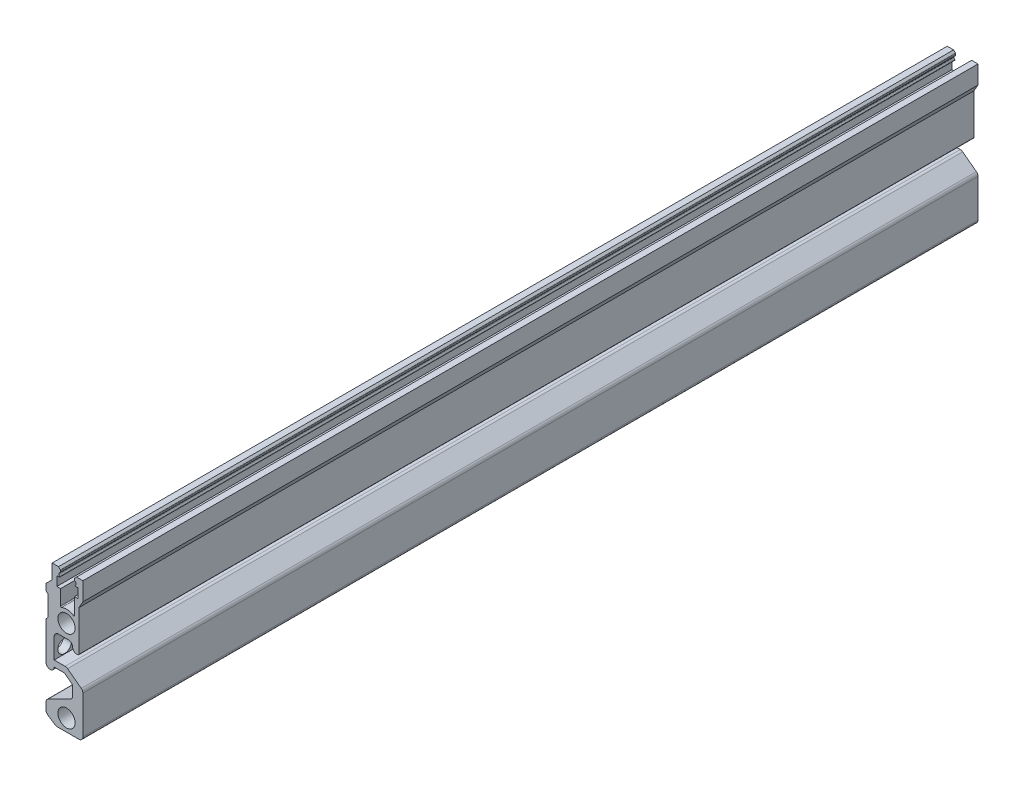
ISO-10303-21;
HEADER;
FILE_DESCRIPTION(('STEP AP214'),'2;1');
FILE_NAME('part.step','',(''),(''),'','','');
FILE_SCHEMA(('AUTOMOTIVE_DESIGN { 1 0 10303 214 1 1 1 1 }'));
ENDSEC;
DATA;
#1=APPLICATION_CONTEXT('core data for automotive mechanical design processes');
#2=APPLICATION_PROTOCOL_DEFINITION('international standard','automotive_design',2000,#1);
#3=PRODUCT_CONTEXT('',#1,'mechanical');
#4=PRODUCT('Part','Part','',(#3));
#5=PRODUCT_RELATED_PRODUCT_CATEGORY('part','',(#4));
#6=PRODUCT_DEFINITION_FORMATION('','',#4);
#7=PRODUCT_DEFINITION_CONTEXT('part definition',#1,'design');
#8=PRODUCT_DEFINITION('design','',#6,#7);
#9=PRODUCT_DEFINITION_SHAPE('','',#8);
#10=(LENGTH_UNIT() NAMED_UNIT(*) SI_UNIT(.MILLI.,.METRE.));
#11=(NAMED_UNIT(*) PLANE_ANGLE_UNIT() SI_UNIT($,.RADIAN.));
#12=(NAMED_UNIT(*) SI_UNIT($,.STERADIAN.) SOLID_ANGLE_UNIT());
#13=UNCERTAINTY_MEASURE_WITH_UNIT(LENGTH_MEASURE(1.E-05),#10,'distance_accuracy_value','');
#14=(GEOMETRIC_REPRESENTATION_CONTEXT(3) GLOBAL_UNCERTAINTY_ASSIGNED_CONTEXT((#13)) GLOBAL_UNIT_ASSIGNED_CONTEXT((#10,
#11,#12)) REPRESENTATION_CONTEXT('',''));
#15=CARTESIAN_POINT('',(0.,0.,0.));
#16=DIRECTION('',(0.,0.,1.));
#17=DIRECTION('',(1.,0.,0.));
#18=AXIS2_PLACEMENT_3D('',#15,#16,#17);
#19=CARTESIAN_POINT('',(0.,-20.0000000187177,109.22));
#20=DIRECTION('',(0.,0.,-1.));
#21=DIRECTION('',(-1.,0.,0.));
#22=AXIS2_PLACEMENT_3D('',#19,#20,#21);
#23=CYLINDRICAL_SURFACE('',#22,1.6);
#24=CARTESIAN_POINT('',(0.,-20.0000000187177,-99.22));
#25=DIRECTION('',(0.,0.,-1.));
#26=DIRECTION('',(-1.,0.,0.));
#27=AXIS2_PLACEMENT_3D('',#24,#25,#26);
#28=CIRCLE('',#27,1.6);
#29=CARTESIAN_POINT('',(-1.6,-20.0000000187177,-99.22));
#30=VERTEX_POINT('',#29);
#31=EDGE_CURVE('E747',#30,#30,#28,.T.);
#32=ORIENTED_EDGE('',*,*,#31,.T.);
#33=EDGE_LOOP('',(#32));
#34=FACE_BOUND('',#33,.T.);
#35=CARTESIAN_POINT('',(0.,-20.0000000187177,99.22));
#36=DIRECTION('',(0.,0.,1.));
#37=DIRECTION('',(1.,0.,0.));
#38=AXIS2_PLACEMENT_3D('',#35,#36,#37);
#39=CIRCLE('',#38,1.6);
#40=CARTESIAN_POINT('',(1.6,-20.0000000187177,99.22));
#41=VERTEX_POINT('',#40);
#42=EDGE_CURVE('E733',#41,#41,#39,.T.);
#43=ORIENTED_EDGE('',*,*,#42,.T.);
#44=EDGE_LOOP('',(#43));
#45=FACE_BOUND('',#44,.T.);
#46=ADVANCED_FACE('F39',(#34,#45),#23,.F.);
#47=CARTESIAN_POINT('',(0.,0.,109.22));
#48=DIRECTION('',(0.,0.,-1.));
#49=DIRECTION('',(-1.,0.,0.));
#50=AXIS2_PLACEMENT_3D('',#47,#48,#49);
#51=CYLINDRICAL_SURFACE('',#50,1.60000000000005);
#52=CARTESIAN_POINT('',(0.,0.,-99.22));
#53=DIRECTION('',(0.,0.,-1.));
#54=DIRECTION('',(-1.,0.,0.));
#55=AXIS2_PLACEMENT_3D('',#52,#53,#54);
#56=CIRCLE('',#55,1.60000000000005);
#57=CARTESIAN_POINT('',(-1.60000000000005,0.,-99.22));
#58=VERTEX_POINT('',#57);
#59=EDGE_CURVE('E754',#58,#58,#56,.T.);
#60=ORIENTED_EDGE('',*,*,#59,.T.);
#61=EDGE_LOOP('',(#60));
#62=FACE_BOUND('',#61,.T.);
#63=CARTESIAN_POINT('',(0.,0.,99.22));
#64=DIRECTION('',(0.,0.,1.));
#65=DIRECTION('',(1.,0.,0.));
#66=AXIS2_PLACEMENT_3D('',#63,#64,#65);
#67=CIRCLE('',#66,1.60000000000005);
#68=CARTESIAN_POINT('',(1.60000000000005,0.,99.22));
#69=VERTEX_POINT('',#68);
#70=EDGE_CURVE('E740',#69,#69,#67,.T.);
#71=ORIENTED_EDGE('',*,*,#70,.T.);
#72=EDGE_LOOP('',(#71));
#73=FACE_BOUND('',#72,.T.);
#74=ADVANCED_FACE('F1555',(#62,#73),#51,.F.);
#75=CARTESIAN_POINT('',(-2.50086526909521,-5.7499999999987,109.22));
#76=DIRECTION('',(0.,0.,-1.));
#77=DIRECTION('',(-1.,0.,0.));
#78=AXIS2_PLACEMENT_3D('',#75,#76,#77);
#79=PLANE('',#78);
#80=CARTESIAN_POINT('',(0.,-20.0000000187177,109.22));
#81=DIRECTION('',(0.,0.,1.));
#82=DIRECTION('',(1.,0.,0.));
#83=AXIS2_PLACEMENT_3D('',#80,#81,#82);
#84=CIRCLE('',#83,2.1);
#85=CARTESIAN_POINT('',(2.1,-20.0000000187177,109.22));
#86=VERTEX_POINT('',#85);
#87=EDGE_CURVE('E734',#86,#86,#84,.T.);
#88=ORIENTED_EDGE('',*,*,#87,.F.);
#89=EDGE_LOOP('',(#88));
#90=FACE_BOUND('',#89,.T.);
#91=CARTESIAN_POINT('',(0.,0.,109.22));
#92=DIRECTION('',(0.,0.,1.));
#93=DIRECTION('',(1.,0.,0.));
#94=AXIS2_PLACEMENT_3D('',#91,#92,#93);
#95=CIRCLE('',#94,2.1);
#96=CARTESIAN_POINT('',(2.1,0.,109.22));
#97=VERTEX_POINT('',#96);
#98=EDGE_CURVE('E741',#97,#97,#95,.T.);
#99=ORIENTED_EDGE('',*,*,#98,.F.);
#100=EDGE_LOOP('',(#99));
#101=FACE_BOUND('',#100,.T.);
#102=DIRECTION('',(0.,1.,0.));
#103=VECTOR('',#102,1.);
#104=CARTESIAN_POINT('',(2.99913473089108,-5.04999999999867,109.22));
#105=LINE('',#104,#103);
#106=CARTESIAN_POINT('',(2.99913473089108,-5.04999999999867,109.22));
#107=VERTEX_POINT('',#106);
#108=CARTESIAN_POINT('',(2.99913473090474,4.80537295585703,109.22));
#109=VERTEX_POINT('',#108);
#110=EDGE_CURVE('E763',#107,#109,#105,.T.);
#111=ORIENTED_EDGE('',*,*,#110,.T.);
#112=DIRECTION('',(0.5,0.866025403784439,0.));
#113=VECTOR('',#112,1.);
#114=CARTESIAN_POINT('',(2.99913473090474,4.80537295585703,109.22));
#115=LINE('',#114,#113);
#116=CARTESIAN_POINT('',(3.9991347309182,6.53742376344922,109.22));
#117=VERTEX_POINT('',#116);
#118=EDGE_CURVE('E766',#109,#117,#115,.T.);
#119=ORIENTED_EDGE('',*,*,#118,.T.);
#120=DIRECTION('',(0.,1.,0.));
#121=VECTOR('',#120,1.);
#122=CARTESIAN_POINT('',(3.9991347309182,6.53742376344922,109.22));
#123=LINE('',#122,#121);
#124=CARTESIAN_POINT('',(3.9991347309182,11.0015907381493,109.22));
#125=VERTEX_POINT('',#124);
#126=EDGE_CURVE('E768',#117,#125,#123,.T.);
#127=ORIENTED_EDGE('',*,*,#126,.T.);
#128=DIRECTION('',(-1.,0.,0.));
#129=VECTOR('',#128,1.);
#130=CARTESIAN_POINT('',(3.9991347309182,11.0015907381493,109.22));
#131=LINE('',#130,#129);
#132=CARTESIAN_POINT('',(2.44913473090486,11.0015907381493,109.22));
#133=VERTEX_POINT('',#132);
#134=EDGE_CURVE('E517',#125,#133,#131,.T.);
#135=ORIENTED_EDGE('',*,*,#134,.T.);
#136=DIRECTION('',(0.707106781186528,0.707106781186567,0.));
#137=VECTOR('',#136,1.);
#138=CARTESIAN_POINT('',(1.94913473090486,10.5015907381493,109.22));
#139=LINE('',#138,#137);
#140=CARTESIAN_POINT('',(2.00771337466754,10.5601693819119,109.22));
#141=VERTEX_POINT('',#140);
#142=EDGE_CURVE('E1100',#133,#141,#139,.F.);
#143=ORIENTED_EDGE('',*,*,#142,.T.);
#144=CARTESIAN_POINT('',(2.14913473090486,10.4187480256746,109.22));
#145=DIRECTION('',(0.,0.,-1.));
#146=DIRECTION('',(-1.,0.,0.));
#147=AXIS2_PLACEMENT_3D('',#144,#145,#146);
#148=CIRCLE('',#147,0.2);
#149=CARTESIAN_POINT('',(1.94913473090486,10.4187480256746,109.22));
#150=VERTEX_POINT('',#149);
#151=EDGE_CURVE('E1136',#141,#150,#148,.F.);
#152=ORIENTED_EDGE('',*,*,#151,.T.);
#153=DIRECTION('',(0.,-1.,0.));
#154=VECTOR('',#153,1.);
#155=CARTESIAN_POINT('',(1.94913473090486,11.7915907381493,109.22));
#156=LINE('',#155,#154);
#157=CARTESIAN_POINT('',(1.94913473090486,10.1341483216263,109.22));
#158=VERTEX_POINT('',#157);
#159=EDGE_CURVE('E771',#150,#158,#156,.T.);
#160=ORIENTED_EDGE('',*,*,#159,.T.);
#161=CARTESIAN_POINT('',(2.14913473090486,10.1341483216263,109.22));
#162=DIRECTION('',(0.,0.,-1.));
#163=DIRECTION('',(-1.,0.,0.));
#164=AXIS2_PLACEMENT_3D('',#161,#162,#163);
#165=CIRCLE('',#164,0.2);
#166=CARTESIAN_POINT('',(2.06342044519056,9.95344674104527,109.22));
#167=VERTEX_POINT('',#166);
#168=EDGE_CURVE('E1130',#158,#167,#165,.F.);
#169=ORIENTED_EDGE('',*,*,#168,.T.);
#170=CARTESIAN_POINT('',(1.84913473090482,9.50169278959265,109.22));
#171=DIRECTION('',(0.,0.,-1.));
#172=DIRECTION('',(-1.,0.,0.));
#173=AXIS2_PLACEMENT_3D('',#170,#171,#172);
#174=CIRCLE('',#173,0.5);
#175=CARTESIAN_POINT('',(2.34913473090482,9.50169278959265,109.22));
#176=VERTEX_POINT('',#175);
#177=EDGE_CURVE('E1093',#167,#176,#174,.T.);
#178=ORIENTED_EDGE('',*,*,#177,.T.);
#179=DIRECTION('',(0.,-1.,0.));
#180=VECTOR('',#179,1.);
#181=CARTESIAN_POINT('',(2.34913473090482,8.99159073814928,109.22));
#182=LINE('',#181,#180);
#183=CARTESIAN_POINT('',(2.34913473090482,9.48148868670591,109.22));
#184=VERTEX_POINT('',#183);
#185=EDGE_CURVE('E530',#176,#184,#182,.T.);
#186=ORIENTED_EDGE('',*,*,#185,.T.);
#187=CARTESIAN_POINT('',(1.84913473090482,9.48148868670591,109.22));
#188=DIRECTION('',(0.,0.,-1.));
#189=DIRECTION('',(-1.,0.,0.));
#190=AXIS2_PLACEMENT_3D('',#187,#188,#189);
#191=CIRCLE('',#190,0.5);
#192=CARTESIAN_POINT('',(2.16004280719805,9.08990706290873,109.22));
#193=VERTEX_POINT('',#192);
#194=EDGE_CURVE('E1097',#184,#193,#191,.T.);
#195=ORIENTED_EDGE('',*,*,#194,.T.);
#196=CARTESIAN_POINT('',(2.2222244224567,9.01159073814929,109.22));
#197=DIRECTION('',(0.,0.,-1.));
#198=DIRECTION('',(-1.,0.,0.));
#199=AXIS2_PLACEMENT_3D('',#196,#197,#198);
#200=CIRCLE('',#199,0.1);
#201=CARTESIAN_POINT('',(2.2222244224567,8.91159073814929,109.22));
#202=VERTEX_POINT('',#201);
#203=EDGE_CURVE('E1159',#193,#202,#200,.F.);
#204=ORIENTED_EDGE('',*,*,#203,.T.);
#205=DIRECTION('',(1.,0.,0.));
#206=VECTOR('',#205,1.);
#207=CARTESIAN_POINT('',(1.94913473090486,8.91159073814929,109.22));
#208=LINE('',#207,#206);
#209=CARTESIAN_POINT('',(2.84913473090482,8.91159073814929,109.22));
#210=VERTEX_POINT('',#209);
#211=EDGE_CURVE('E774',#202,#210,#208,.T.);
#212=ORIENTED_EDGE('',*,*,#211,.T.);
#213=DIRECTION('',(0.,-1.,0.));
#214=VECTOR('',#213,1.);
#215=CARTESIAN_POINT('',(2.84913473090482,6.61159073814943,109.22));
#216=LINE('',#215,#214);
#217=CARTESIAN_POINT('',(2.84913473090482,6.61159073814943,109.22));
#218=VERTEX_POINT('',#217);
#219=EDGE_CURVE('E776',#210,#218,#216,.T.);
#220=ORIENTED_EDGE('',*,*,#219,.T.);
#221=DIRECTION('',(-1.,0.,0.));
#222=VECTOR('',#221,1.);
#223=CARTESIAN_POINT('',(2.84913473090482,6.61159073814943,109.22));
#224=LINE('',#223,#222);
#225=CARTESIAN_POINT('',(1.94913473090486,6.61159073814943,109.22));
#226=VERTEX_POINT('',#225);
#227=EDGE_CURVE('E778',#218,#226,#224,.T.);
#228=ORIENTED_EDGE('',*,*,#227,.T.);
#229=DIRECTION('',(0.,-1.,0.));
#230=VECTOR('',#229,1.);
#231=CARTESIAN_POINT('',(1.94913473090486,6.61159073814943,109.22));
#232=LINE('',#231,#230);
#233=CARTESIAN_POINT('',(1.94913473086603,2.67965066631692,109.22));
#234=VERTEX_POINT('',#233);
#235=EDGE_CURVE('E780',#226,#234,#232,.T.);
#236=ORIENTED_EDGE('',*,*,#235,.T.);
#237=CARTESIAN_POINT('',(1.74913473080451,2.67965066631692,109.22));
#238=DIRECTION('',(0.,0.,-1.));
#239=DIRECTION('',(1.,0.,0.));
#240=AXIS2_PLACEMENT_3D('',#237,#238,#239);
#241=CIRCLE('',#240,0.20000000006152);
#242=CARTESIAN_POINT('',(1.6398138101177,2.51217249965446,109.22));
#243=VERTEX_POINT('',#242);
#244=EDGE_CURVE('E783',#234,#243,#241,.T.);
#245=ORIENTED_EDGE('',*,*,#244,.T.);
#246=CARTESIAN_POINT('',(0.,0.,109.22));
#247=DIRECTION('',(0.,0.,1.));
#248=DIRECTION('',(1.,0.,0.));
#249=AXIS2_PLACEMENT_3D('',#246,#247,#248);
#250=CIRCLE('',#249,2.99999999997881);
#251=CARTESIAN_POINT('',(-1.17268618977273,2.76130532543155,109.22));
#252=VERTEX_POINT('',#251);
#253=EDGE_CURVE('E785',#243,#252,#250,.T.);
#254=ORIENTED_EDGE('',*,*,#253,.T.);
#255=CARTESIAN_POINT('',(-1.25086526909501,2.94539234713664,109.22));
#256=DIRECTION('',(0.,0.,-1.));
#257=DIRECTION('',(1.,0.,0.));
#258=AXIS2_PLACEMENT_3D('',#255,#256,#257);
#259=CIRCLE('',#258,0.200000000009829);
#260=CARTESIAN_POINT('',(-1.45086526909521,2.94539234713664,109.22));
#261=VERTEX_POINT('',#260);
#262=EDGE_CURVE('E787',#252,#261,#259,.T.);
#263=ORIENTED_EDGE('',*,*,#262,.T.);
#264=DIRECTION('',(0.,1.,0.));
#265=VECTOR('',#264,1.);
#266=CARTESIAN_POINT('',(-1.45086526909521,2.94539234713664,109.22));
#267=LINE('',#266,#265);
#268=CARTESIAN_POINT('',(-1.45086526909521,6.61159073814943,109.22));
#269=VERTEX_POINT('',#268);
#270=EDGE_CURVE('E789',#261,#269,#267,.T.);
#271=ORIENTED_EDGE('',*,*,#270,.T.);
#272=DIRECTION('',(-1.,0.,0.));
#273=VECTOR('',#272,1.);
#274=CARTESIAN_POINT('',(-1.45086526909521,6.61159073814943,109.22));
#275=LINE('',#274,#273);
#276=CARTESIAN_POINT('',(-2.35086526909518,6.61159073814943,109.22));
#277=VERTEX_POINT('',#276);
#278=EDGE_CURVE('E791',#269,#277,#275,.T.);
#279=ORIENTED_EDGE('',*,*,#278,.T.);
#280=DIRECTION('',(0.,1.,0.));
#281=VECTOR('',#280,1.);
#282=CARTESIAN_POINT('',(-2.35086526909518,8.91159073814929,109.22));
#283=LINE('',#282,#281);
#284=CARTESIAN_POINT('',(-2.35086526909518,8.91159073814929,109.22));
#285=VERTEX_POINT('',#284);
#286=EDGE_CURVE('E793',#277,#285,#283,.T.);
#287=ORIENTED_EDGE('',*,*,#286,.T.);
#288=DIRECTION('',(1.,0.,0.));
#289=VECTOR('',#288,1.);
#290=CARTESIAN_POINT('',(-2.35086526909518,8.91159073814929,109.22));
#291=LINE('',#290,#289);
#292=CARTESIAN_POINT('',(-1.72395496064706,8.91159073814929,109.22));
#293=VERTEX_POINT('',#292);
#294=EDGE_CURVE('E795',#285,#293,#291,.T.);
#295=ORIENTED_EDGE('',*,*,#294,.T.);
#296=CARTESIAN_POINT('',(-1.72395496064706,9.01159073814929,109.22));
#297=DIRECTION('',(0.,0.,-1.));
#298=DIRECTION('',(-1.,0.,0.));
#299=AXIS2_PLACEMENT_3D('',#296,#297,#298);
#300=CIRCLE('',#299,0.1);
#301=CARTESIAN_POINT('',(-1.66177334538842,9.08990706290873,109.22));
#302=VERTEX_POINT('',#301);
#303=EDGE_CURVE('E1161',#293,#302,#300,.F.);
#304=ORIENTED_EDGE('',*,*,#303,.T.);
#305=CARTESIAN_POINT('',(-1.35086526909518,9.48148868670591,109.22));
#306=DIRECTION('',(0.,0.,-1.));
#307=DIRECTION('',(-1.,0.,0.));
#308=AXIS2_PLACEMENT_3D('',#305,#306,#307);
#309=CIRCLE('',#308,0.5);
#310=CARTESIAN_POINT('',(-1.85086526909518,9.48148868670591,109.22));
#311=VERTEX_POINT('',#310);
#312=EDGE_CURVE('E1088',#302,#311,#309,.T.);
#313=ORIENTED_EDGE('',*,*,#312,.T.);
#314=DIRECTION('',(0.,1.,0.));
#315=VECTOR('',#314,1.);
#316=CARTESIAN_POINT('',(-1.85086526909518,8.99159073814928,109.22));
#317=LINE('',#316,#315);
#318=CARTESIAN_POINT('',(-1.85086526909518,9.50169278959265,109.22));
#319=VERTEX_POINT('',#318);
#320=EDGE_CURVE('E527',#311,#319,#317,.T.);
#321=ORIENTED_EDGE('',*,*,#320,.T.);
#322=CARTESIAN_POINT('',(-1.35086526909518,9.50169278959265,109.22));
#323=DIRECTION('',(0.,0.,-1.));
#324=DIRECTION('',(-1.,0.,0.));
#325=AXIS2_PLACEMENT_3D('',#322,#323,#324);
#326=CIRCLE('',#325,0.5);
#327=CARTESIAN_POINT('',(-1.56515098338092,9.95344674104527,109.22));
#328=VERTEX_POINT('',#327);
#329=EDGE_CURVE('E1082',#319,#328,#326,.T.);
#330=ORIENTED_EDGE('',*,*,#329,.T.);
#331=CARTESIAN_POINT('',(-1.65086526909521,10.1341483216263,109.22));
#332=DIRECTION('',(0.,0.,-1.));
#333=DIRECTION('',(-1.,0.,0.));
#334=AXIS2_PLACEMENT_3D('',#331,#332,#333);
#335=CIRCLE('',#334,0.2);
#336=CARTESIAN_POINT('',(-1.45086526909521,10.1341483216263,109.22));
#337=VERTEX_POINT('',#336);
#338=EDGE_CURVE('E1132',#328,#337,#335,.F.);
#339=ORIENTED_EDGE('',*,*,#338,.T.);
#340=DIRECTION('',(0.,1.,0.));
#341=VECTOR('',#340,1.);
#342=CARTESIAN_POINT('',(-1.45086526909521,8.91159073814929,109.22));
#343=LINE('',#342,#341);
#344=CARTESIAN_POINT('',(-1.45086526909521,10.4187480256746,109.22));
#345=VERTEX_POINT('',#344);
#346=EDGE_CURVE('E798',#337,#345,#343,.T.);
#347=ORIENTED_EDGE('',*,*,#346,.T.);
#348=CARTESIAN_POINT('',(-1.65086526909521,10.4187480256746,109.22));
#349=DIRECTION('',(0.,0.,-1.));
#350=DIRECTION('',(-1.,0.,0.));
#351=AXIS2_PLACEMENT_3D('',#348,#349,#350);
#352=CIRCLE('',#351,0.2);
#353=CARTESIAN_POINT('',(-1.5094439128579,10.5601693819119,109.22));
#354=VERTEX_POINT('',#353);
#355=EDGE_CURVE('E1134',#345,#354,#352,.F.);
#356=ORIENTED_EDGE('',*,*,#355,.T.);
#357=DIRECTION('',(0.707106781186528,-0.707106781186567,0.));
#358=VECTOR('',#357,1.);
#359=CARTESIAN_POINT('',(-1.45086526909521,10.5015907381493,109.22));
#360=LINE('',#359,#358);
#361=CARTESIAN_POINT('',(-1.95086526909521,11.0015907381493,109.22));
#362=VERTEX_POINT('',#361);
#363=EDGE_CURVE('E1103',#354,#362,#360,.F.);
#364=ORIENTED_EDGE('',*,*,#363,.T.);
#365=CARTESIAN_POINT('',(-3.50086526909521,11.0015907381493,109.22));
#366=VERTEX_POINT('',#365);
#367=EDGE_CURVE('E521',#362,#366,#131,.T.);
#368=ORIENTED_EDGE('',*,*,#367,.T.);
#369=DIRECTION('',(0.,-1.,0.));
#370=VECTOR('',#369,1.);
#371=CARTESIAN_POINT('',(-3.50086526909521,11.0015907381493,109.22));
#372=LINE('',#371,#370);
#373=CARTESIAN_POINT('',(-3.50086526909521,7.44159073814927,109.22));
#374=VERTEX_POINT('',#373);
#375=EDGE_CURVE('E499',#366,#374,#372,.T.);
#376=ORIENTED_EDGE('',*,*,#375,.T.);
#377=DIRECTION('',(-0.707106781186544,-0.707106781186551,0.));
#378=VECTOR('',#377,1.);
#379=CARTESIAN_POINT('',(-3.50086526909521,7.44159073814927,109.22));
#380=LINE('',#379,#378);
#381=CARTESIAN_POINT('',(-5.00086526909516,5.94159073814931,109.22));
#382=VERTEX_POINT('',#381);
#383=EDGE_CURVE('E502',#374,#382,#380,.T.);
#384=ORIENTED_EDGE('',*,*,#383,.T.);
#385=DIRECTION('',(0.,-1.,0.));
#386=VECTOR('',#385,1.);
#387=CARTESIAN_POINT('',(-5.00086526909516,8.5215907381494,109.22));
#388=LINE('',#387,#386);
#389=CARTESIAN_POINT('',(-5.00086526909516,4.44159073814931,109.22));
#390=VERTEX_POINT('',#389);
#391=EDGE_CURVE('E801',#382,#390,#388,.T.);
#392=ORIENTED_EDGE('',*,*,#391,.T.);
#393=DIRECTION('',(0.668928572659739,-0.743326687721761,0.));
#394=VECTOR('',#393,1.);
#395=CARTESIAN_POINT('',(-5.00086526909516,4.44159073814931,109.22));
#396=LINE('',#395,#394);
#397=CARTESIAN_POINT('',(-4.55073320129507,3.94139506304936,109.22));
#398=VERTEX_POINT('',#397);
#399=EDGE_CURVE('E803',#390,#398,#396,.T.);
#400=ORIENTED_EDGE('',*,*,#399,.T.);
#401=DIRECTION('',(-5.28322799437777E-05,-0.999999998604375,0.));
#402=VECTOR('',#401,1.);
#403=CARTESIAN_POINT('',(-4.55073320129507,3.94139506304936,109.22));
#404=LINE('',#403,#402);
#405=CARTESIAN_POINT('',(-4.55099736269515,-1.05860493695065,109.22));
#406=VERTEX_POINT('',#405);
#407=EDGE_CURVE('E805',#398,#406,#404,.T.);
#408=ORIENTED_EDGE('',*,*,#407,.T.);
#409=DIRECTION('',(-0.669000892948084,-0.743261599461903,0.));
#410=VECTOR('',#409,1.);
#411=CARTESIAN_POINT('',(-4.55099736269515,-1.05860493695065,109.22));
#412=LINE('',#411,#410);
#413=CARTESIAN_POINT('',(-5.00086526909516,-1.55840926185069,109.22));
#414=VERTEX_POINT('',#413);
#415=EDGE_CURVE('E807',#406,#414,#412,.T.);
#416=ORIENTED_EDGE('',*,*,#415,.T.);
#417=DIRECTION('',(0.,-1.,0.));
#418=VECTOR('',#417,1.);
#419=CARTESIAN_POINT('',(-5.00086526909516,-1.55840926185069,109.22));
#420=LINE('',#419,#418);
#421=CARTESIAN_POINT('',(-5.00086526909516,-10.75,109.22));
#422=VERTEX_POINT('',#421);
#423=EDGE_CURVE('E809',#414,#422,#420,.T.);
#424=ORIENTED_EDGE('',*,*,#423,.T.);
#425=CARTESIAN_POINT('',(-4.00086526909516,-10.75,109.22));
#426=DIRECTION('',(0.,0.,1.));
#427=DIRECTION('',(1.,0.,0.));
#428=AXIS2_PLACEMENT_3D('',#425,#426,#427);
#429=CIRCLE('',#428,1.);
#430=CARTESIAN_POINT('',(-3.00086526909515,-10.75,109.22));
#431=VERTEX_POINT('',#430);
#432=EDGE_CURVE('E811',#422,#431,#429,.T.);
#433=ORIENTED_EDGE('',*,*,#432,.T.);
#434=DIRECTION('',(1.,0.,0.));
#435=VECTOR('',#434,1.);
#436=CARTESIAN_POINT('',(-3.00086526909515,-10.75,109.22));
#437=LINE('',#436,#435);
#438=CARTESIAN_POINT('',(-0.834198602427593,-10.75,109.22));
#439=VERTEX_POINT('',#438);
#440=EDGE_CURVE('E813',#431,#439,#437,.T.);
#441=ORIENTED_EDGE('',*,*,#440,.T.);
#442=CARTESIAN_POINT('',(-0.834198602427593,-11.75,109.22));
#443=DIRECTION('',(0.,0.,-1.));
#444=DIRECTION('',(-1.,0.,0.));
#445=AXIS2_PLACEMENT_3D('',#442,#443,#444);
#446=CIRCLE('',#445,1.);
#447=CARTESIAN_POINT('',(-0.234198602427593,-10.95,109.22));
#448=VERTEX_POINT('',#447);
#449=EDGE_CURVE('E1233',#439,#448,#446,.T.);
#450=ORIENTED_EDGE('',*,*,#449,.T.);
#451=DIRECTION('',(-0.8,0.6,0.));
#452=VECTOR('',#451,1.);
#453=CARTESIAN_POINT('',(-0.50086526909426,-10.75,109.22));
#454=LINE('',#453,#452);
#455=CARTESIAN_POINT('',(1.49913473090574,-12.25,109.22));
#456=VERTEX_POINT('',#455);
#457=EDGE_CURVE('E469',#456,#448,#454,.T.);
#458=ORIENTED_EDGE('',*,*,#457,.F.);
#459=DIRECTION('',(0.,-1.,0.));
#460=VECTOR('',#459,1.);
#461=CARTESIAN_POINT('',(1.49913473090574,-10.75,109.22));
#462=LINE('',#461,#460);
#463=CARTESIAN_POINT('',(1.49913473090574,-14.6319660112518,109.22));
#464=VERTEX_POINT('',#463);
#465=EDGE_CURVE('E464',#456,#464,#462,.T.);
#466=ORIENTED_EDGE('',*,*,#465,.T.);
#467=CARTESIAN_POINT('',(0.49913473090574,-14.6319660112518,109.22));
#468=DIRECTION('',(0.,0.,-1.));
#469=DIRECTION('',(-1.,0.,0.));
#470=AXIS2_PLACEMENT_3D('',#467,#468,#469);
#471=CIRCLE('',#470,1.);
#472=CARTESIAN_POINT('',(0.946348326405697,-15.5263932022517,109.22));
#473=VERTEX_POINT('',#472);
#474=EDGE_CURVE('E1229',#464,#473,#471,.T.);
#475=ORIENTED_EDGE('',*,*,#474,.T.);
#476=DIRECTION('',(0.894427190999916,0.447213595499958,0.));
#477=VECTOR('',#476,1.);
#478=CARTESIAN_POINT('',(1.49913473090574,-15.2500000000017,109.22));
#479=LINE('',#478,#477);
#480=CARTESIAN_POINT('',(-4.44807886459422,-18.2236067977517,109.22));
#481=VERTEX_POINT('',#480);
#482=EDGE_CURVE('E482',#481,#473,#479,.T.);
#483=ORIENTED_EDGE('',*,*,#482,.F.);
#484=CARTESIAN_POINT('',(-4.00086526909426,-19.1180339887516,109.22));
#485=DIRECTION('',(0.,0.,-1.));
#486=DIRECTION('',(-1.,0.,0.));
#487=AXIS2_PLACEMENT_3D('',#484,#485,#486);
#488=CIRCLE('',#487,1.);
#489=CARTESIAN_POINT('',(-5.00086526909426,-19.1180339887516,109.22));
#490=VERTEX_POINT('',#489);
#491=EDGE_CURVE('E1195',#481,#490,#488,.F.);
#492=ORIENTED_EDGE('',*,*,#491,.T.);
#493=DIRECTION('',(0.,-1.,0.));
#494=VECTOR('',#493,1.);
#495=CARTESIAN_POINT('',(-5.00086526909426,-22.2000000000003,109.22));
#496=LINE('',#495,#494);
#497=CARTESIAN_POINT('',(-5.00086526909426,-20.8323139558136,109.22));
#498=VERTEX_POINT('',#497);
#499=EDGE_CURVE('E817',#490,#498,#496,.T.);
#500=ORIENTED_EDGE('',*,*,#499,.T.);
#501=CARTESIAN_POINT('',(-4.00086526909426,-20.8323139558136,109.22));
#502=DIRECTION('',(0.,0.,-1.));
#503=DIRECTION('',(-1.,0.,0.));
#504=AXIS2_PLACEMENT_3D('',#501,#502,#503);
#505=CIRCLE('',#504,1.);
#506=CARTESIAN_POINT('',(-4.54585361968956,-21.6707575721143,109.22));
#507=VERTEX_POINT('',#506);
#508=EDGE_CURVE('E1197',#498,#507,#505,.F.);
#509=ORIENTED_EDGE('',*,*,#508,.T.);
#510=DIRECTION('',(0.838443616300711,-0.5449883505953,0.));
#511=VECTOR('',#510,1.);
#512=CARTESIAN_POINT('',(-2.50086526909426,-23.0000000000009,109.22));
#513=LINE('',#512,#511);
#514=CARTESIAN_POINT('',(-2.74941355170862,-22.8384436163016,109.22));
#515=VERTEX_POINT('',#514);
#516=EDGE_CURVE('E493',#507,#515,#513,.T.);
#517=ORIENTED_EDGE('',*,*,#516,.T.);
#518=CARTESIAN_POINT('',(-2.20442520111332,-22.0000000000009,109.22));
#519=DIRECTION('',(0.,0.,-1.));
#520=DIRECTION('',(-1.,0.,0.));
#521=AXIS2_PLACEMENT_3D('',#518,#519,#520);
#522=CIRCLE('',#521,1.);
#523=CARTESIAN_POINT('',(-2.20442520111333,-23.0000000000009,109.22));
#524=VERTEX_POINT('',#523);
#525=EDGE_CURVE('E1193',#515,#524,#522,.F.);
#526=ORIENTED_EDGE('',*,*,#525,.T.);
#527=DIRECTION('',(1.,0.,0.));
#528=VECTOR('',#527,1.);
#529=CARTESIAN_POINT('',(2.19913473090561,-23.0000000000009,109.22));
#530=LINE('',#529,#528);
#531=CARTESIAN_POINT('',(2.99913473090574,-23.0000000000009,109.22));
#532=VERTEX_POINT('',#531);
#533=EDGE_CURVE('E820',#524,#532,#530,.T.);
#534=ORIENTED_EDGE('',*,*,#533,.T.);
#535=CARTESIAN_POINT('',(2.99913473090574,-22.0000000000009,109.22));
#536=DIRECTION('',(0.,0.,-1.));
#537=DIRECTION('',(-1.,0.,0.));
#538=AXIS2_PLACEMENT_3D('',#535,#536,#537);
#539=CIRCLE('',#538,1.);
#540=CARTESIAN_POINT('',(3.99913473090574,-22.0000000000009,109.22));
#541=VERTEX_POINT('',#540);
#542=EDGE_CURVE('E59',#532,#541,#539,.F.);
#543=ORIENTED_EDGE('',*,*,#542,.T.);
#544=DIRECTION('',(0.,-1.,0.));
#545=VECTOR('',#544,1.);
#546=CARTESIAN_POINT('',(3.99913473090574,-23.0000000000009,109.22));
#547=LINE('',#546,#545);
#548=CARTESIAN_POINT('',(3.99913473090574,-12.75,109.22));
#549=VERTEX_POINT('',#548);
#550=EDGE_CURVE('E1247',#549,#541,#547,.T.);
#551=ORIENTED_EDGE('',*,*,#550,.F.);
#552=CARTESIAN_POINT('',(2.99913473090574,-12.75,109.22));
#553=DIRECTION('',(0.,0.,-1.));
#554=DIRECTION('',(-1.,0.,0.));
#555=AXIS2_PLACEMENT_3D('',#552,#553,#554);
#556=CIRCLE('',#555,1.);
#557=CARTESIAN_POINT('',(3.59913473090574,-11.95,109.22));
#558=VERTEX_POINT('',#557);
#559=EDGE_CURVE('E47',#549,#558,#556,.F.);
#560=ORIENTED_EDGE('',*,*,#559,.T.);
#561=DIRECTION('',(-0.8,0.6,0.));
#562=VECTOR('',#561,1.);
#563=CARTESIAN_POINT('',(-0.000865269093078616,-9.25000000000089,109.22));
#564=LINE('',#563,#562);
#565=CARTESIAN_POINT('',(0.265801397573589,-9.45000000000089,109.22));
#566=VERTEX_POINT('',#565);
#567=EDGE_CURVE('E475',#558,#566,#564,.T.);
#568=ORIENTED_EDGE('',*,*,#567,.T.);
#569=CARTESIAN_POINT('',(-0.334198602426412,-10.2500000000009,109.22));
#570=DIRECTION('',(0.,0.,-1.));
#571=DIRECTION('',(-1.,0.,0.));
#572=AXIS2_PLACEMENT_3D('',#569,#570,#571);
#573=CIRCLE('',#572,1.);
#574=CARTESIAN_POINT('',(-0.334198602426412,-9.25000000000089,109.22));
#575=VERTEX_POINT('',#574);
#576=EDGE_CURVE('E1191',#566,#575,#573,.F.);
#577=ORIENTED_EDGE('',*,*,#576,.T.);
#578=DIRECTION('',(-1.,0.,0.));
#579=VECTOR('',#578,1.);
#580=CARTESIAN_POINT('',(-3.00086526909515,-9.25000000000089,109.22));
#581=LINE('',#580,#579);
#582=CARTESIAN_POINT('',(-3.00086526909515,-9.25000000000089,109.22));
#583=VERTEX_POINT('',#582);
#584=EDGE_CURVE('E822',#575,#583,#581,.T.);
#585=ORIENTED_EDGE('',*,*,#584,.T.);
#586=DIRECTION('',(0.,1.,0.));
#587=VECTOR('',#586,1.);
#588=CARTESIAN_POINT('',(-3.00086526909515,-9.25000000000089,109.22));
#589=LINE('',#588,#587);
#590=CARTESIAN_POINT('',(-3.00086526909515,-4.24999999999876,109.22));
#591=VERTEX_POINT('',#590);
#592=EDGE_CURVE('E824',#583,#591,#589,.T.);
#593=ORIENTED_EDGE('',*,*,#592,.T.);
#594=CARTESIAN_POINT('',(-2.00086526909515,-4.24999999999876,109.22));
#595=DIRECTION('',(0.,0.,-1.));
#596=DIRECTION('',(-1.,0.,0.));
#597=AXIS2_PLACEMENT_3D('',#594,#595,#596);
#598=CIRCLE('',#597,1.);
#599=CARTESIAN_POINT('',(-2.00086526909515,-3.24999999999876,109.22));
#600=VERTEX_POINT('',#599);
#601=EDGE_CURVE('E1237',#591,#600,#598,.T.);
#602=ORIENTED_EDGE('',*,*,#601,.T.);
#603=DIRECTION('',(1.,0.,0.));
#604=VECTOR('',#603,1.);
#605=CARTESIAN_POINT('',(-3.00086526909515,-3.24999999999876,109.22));
#606=LINE('',#605,#604);
#607=CARTESIAN_POINT('',(0.499134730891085,-3.24999999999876,109.22));
#608=VERTEX_POINT('',#607);
#609=EDGE_CURVE('E487',#600,#608,#606,.T.);
#610=ORIENTED_EDGE('',*,*,#609,.T.);
#611=CARTESIAN_POINT('',(0.499134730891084,-4.24999999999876,109.22));
#612=DIRECTION('',(0.,0.,-1.));
#613=DIRECTION('',(-1.,0.,0.));
#614=AXIS2_PLACEMENT_3D('',#611,#612,#613);
#615=CIRCLE('',#614,1.);
#616=CARTESIAN_POINT('',(1.49913473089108,-4.24999999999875,109.22));
#617=VERTEX_POINT('',#616);
#618=EDGE_CURVE('E1241',#608,#617,#615,.T.);
#619=ORIENTED_EDGE('',*,*,#618,.T.);
#620=CARTESIAN_POINT('',(2.49913473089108,-4.24999999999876,109.22));
#621=DIRECTION('',(0.,0.,-1.));
#622=DIRECTION('',(-1.,0.,0.));
#623=AXIS2_PLACEMENT_3D('',#620,#621,#622);
#624=CIRCLE('',#623,1.);
#625=CARTESIAN_POINT('',(2.49913473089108,-5.24999999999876,109.22));
#626=VERTEX_POINT('',#625);
#627=EDGE_CURVE('E1189',#617,#626,#624,.F.);
#628=ORIENTED_EDGE('',*,*,#627,.T.);
#629=DIRECTION('',(1.,0.,0.));
#630=VECTOR('',#629,1.);
#631=CARTESIAN_POINT('',(-2.50086526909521,-5.24999999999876,109.22));
#632=LINE('',#631,#630);
#633=CARTESIAN_POINT('',(2.79913473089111,-5.2499999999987,109.22));
#634=VERTEX_POINT('',#633);
#635=EDGE_CURVE('E758',#626,#634,#632,.T.);
#636=ORIENTED_EDGE('',*,*,#635,.T.);
#637=CARTESIAN_POINT('',(2.79913473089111,-5.04999999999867,109.22));
#638=DIRECTION('',(0.,0.,1.));
#639=DIRECTION('',(1.,0.,0.));
#640=AXIS2_PLACEMENT_3D('',#637,#638,#639);
#641=CIRCLE('',#640,0.200000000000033);
#642=EDGE_CURVE('E760',#634,#107,#641,.T.);
#643=ORIENTED_EDGE('',*,*,#642,.T.);
#644=EDGE_LOOP('',(#111,#119,#127,#135,#143,#152,#160,#169,#178,#186,#195,#204,#212,#220,#228,
#236,#245,#254,#263,#271,#279,#287,#295,#304,#313,#321,#330,#339,#347,#356,#364,#368,#376,#384,
#392,#400,#408,#416,#424,#433,#441,#450,#458,#466,#475,#483,#492,#500,#509,#517,#526,#534,#543,
#551,#560,#568,#577,#585,#593,#602,#610,#619,#628,#636,#643));
#645=FACE_BOUND('',#644,.T.);
#646=ADVANCED_FACE('F1261',(#90,#101,#645),#79,.F.);
#647=CARTESIAN_POINT('',(-2.50086526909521,-5.7499999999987,-109.22));
#648=DIRECTION('',(0.,0.,-1.));
#649=DIRECTION('',(-1.,0.,0.));
#650=AXIS2_PLACEMENT_3D('',#647,#648,#649);
#651=PLANE('',#650);
#652=DIRECTION('',(0.,1.,0.));
#653=VECTOR('',#652,1.);
#654=CARTESIAN_POINT('',(2.99913473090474,1.24159073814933,-109.22));
#655=LINE('',#654,#653);
#656=CARTESIAN_POINT('',(2.99913473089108,-5.04999999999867,-109.22));
#657=VERTEX_POINT('',#656);
#658=CARTESIAN_POINT('',(2.99913473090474,4.80537295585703,-109.22));
#659=VERTEX_POINT('',#658);
#660=EDGE_CURVE('E833',#657,#659,#655,.T.);
#661=ORIENTED_EDGE('',*,*,#660,.F.);
#662=CARTESIAN_POINT('',(2.79913473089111,-5.04999999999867,-109.22));
#663=DIRECTION('',(0.,0.,1.));
#664=DIRECTION('',(1.,0.,0.));
#665=AXIS2_PLACEMENT_3D('',#662,#663,#664);
#666=CIRCLE('',#665,0.200000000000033);
#667=CARTESIAN_POINT('',(2.79913473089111,-5.2499999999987,-109.22));
#668=VERTEX_POINT('',#667);
#669=EDGE_CURVE('E830',#668,#657,#666,.T.);
#670=ORIENTED_EDGE('',*,*,#669,.F.);
#671=DIRECTION('',(1.,0.,0.));
#672=VECTOR('',#671,1.);
#673=CARTESIAN_POINT('',(-2.50086526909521,-5.24999999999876,-109.22));
#674=LINE('',#673,#672);
#675=CARTESIAN_POINT('',(2.49913473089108,-5.24999999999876,-109.22));
#676=VERTEX_POINT('',#675);
#677=EDGE_CURVE('E828',#676,#668,#674,.T.);
#678=ORIENTED_EDGE('',*,*,#677,.F.);
#679=CARTESIAN_POINT('',(2.49913473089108,-4.24999999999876,-109.22));
#680=DIRECTION('',(0.,0.,-1.));
#681=DIRECTION('',(-1.,0.,0.));
#682=AXIS2_PLACEMENT_3D('',#679,#680,#681);
#683=CIRCLE('',#682,1.);
#684=CARTESIAN_POINT('',(1.49913473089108,-4.24999999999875,-109.22));
#685=VERTEX_POINT('',#684);
#686=EDGE_CURVE('E1173',#676,#685,#683,.T.);
#687=ORIENTED_EDGE('',*,*,#686,.T.);
#688=CARTESIAN_POINT('',(0.499134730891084,-4.24999999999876,-109.22));
#689=DIRECTION('',(0.,0.,-1.));
#690=DIRECTION('',(-1.,0.,0.));
#691=AXIS2_PLACEMENT_3D('',#688,#689,#690);
#692=CIRCLE('',#691,1.);
#693=CARTESIAN_POINT('',(0.499134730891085,-3.24999999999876,-109.22));
#694=VERTEX_POINT('',#693);
#695=EDGE_CURVE('E1239',#685,#694,#692,.F.);
#696=ORIENTED_EDGE('',*,*,#695,.T.);
#697=DIRECTION('',(1.,0.,0.));
#698=VECTOR('',#697,1.);
#699=CARTESIAN_POINT('',(-3.00086526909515,-3.24999999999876,-109.22));
#700=LINE('',#699,#698);
#701=CARTESIAN_POINT('',(-2.00086526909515,-3.24999999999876,-109.22));
#702=VERTEX_POINT('',#701);
#703=EDGE_CURVE('E485',#702,#694,#700,.T.);
#704=ORIENTED_EDGE('',*,*,#703,.F.);
#705=CARTESIAN_POINT('',(-2.00086526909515,-4.24999999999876,-109.22));
#706=DIRECTION('',(0.,0.,-1.));
#707=DIRECTION('',(-1.,0.,0.));
#708=AXIS2_PLACEMENT_3D('',#705,#706,#707);
#709=CIRCLE('',#708,1.);
#710=CARTESIAN_POINT('',(-3.00086526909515,-4.24999999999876,-109.22));
#711=VERTEX_POINT('',#710);
#712=EDGE_CURVE('E1235',#702,#711,#709,.F.);
#713=ORIENTED_EDGE('',*,*,#712,.T.);
#714=DIRECTION('',(0.,1.,0.));
#715=VECTOR('',#714,1.);
#716=CARTESIAN_POINT('',(-3.00086526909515,-9.25000000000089,-109.22));
#717=LINE('',#716,#715);
#718=CARTESIAN_POINT('',(-3.00086526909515,-9.25000000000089,-109.22));
#719=VERTEX_POINT('',#718);
#720=EDGE_CURVE('E761',#719,#711,#717,.T.);
#721=ORIENTED_EDGE('',*,*,#720,.F.);
#722=DIRECTION('',(-1.,0.,0.));
#723=VECTOR('',#722,1.);
#724=CARTESIAN_POINT('',(-3.00086526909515,-9.25000000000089,-109.22));
#725=LINE('',#724,#723);
#726=CARTESIAN_POINT('',(-0.334198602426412,-9.25000000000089,-109.22));
#727=VERTEX_POINT('',#726);
#728=EDGE_CURVE('E889',#727,#719,#725,.T.);
#729=ORIENTED_EDGE('',*,*,#728,.F.);
#730=CARTESIAN_POINT('',(-0.334198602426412,-10.2500000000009,-109.22));
#731=DIRECTION('',(0.,0.,-1.));
#732=DIRECTION('',(-1.,0.,0.));
#733=AXIS2_PLACEMENT_3D('',#730,#731,#732);
#734=CIRCLE('',#733,1.);
#735=CARTESIAN_POINT('',(0.265801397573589,-9.45000000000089,-109.22));
#736=VERTEX_POINT('',#735);
#737=EDGE_CURVE('E1175',#727,#736,#734,.T.);
#738=ORIENTED_EDGE('',*,*,#737,.T.);
#739=DIRECTION('',(-0.8,0.6,0.));
#740=VECTOR('',#739,1.);
#741=CARTESIAN_POINT('',(-0.000865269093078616,-9.25000000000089,-109.22));
#742=LINE('',#741,#740);
#743=CARTESIAN_POINT('',(3.59913473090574,-11.95,-109.22));
#744=VERTEX_POINT('',#743);
#745=EDGE_CURVE('E478',#744,#736,#742,.T.);
#746=ORIENTED_EDGE('',*,*,#745,.F.);
#747=CARTESIAN_POINT('',(2.99913473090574,-12.75,-109.22));
#748=DIRECTION('',(0.,0.,-1.));
#749=DIRECTION('',(-1.,0.,0.));
#750=AXIS2_PLACEMENT_3D('',#747,#748,#749);
#751=CIRCLE('',#750,1.);
#752=CARTESIAN_POINT('',(3.99913473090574,-12.75,-109.22));
#753=VERTEX_POINT('',#752);
#754=EDGE_CURVE('E1252',#744,#753,#751,.T.);
#755=ORIENTED_EDGE('',*,*,#754,.T.);
#756=DIRECTION('',(0.,-1.,0.));
#757=VECTOR('',#756,1.);
#758=CARTESIAN_POINT('',(3.99913473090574,-23.0000000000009,-109.22));
#759=LINE('',#758,#757);
#760=CARTESIAN_POINT('',(3.99913473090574,-22.0000000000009,-109.22));
#761=VERTEX_POINT('',#760);
#762=EDGE_CURVE('E1273',#753,#761,#759,.T.);
#763=ORIENTED_EDGE('',*,*,#762,.T.);
#764=CARTESIAN_POINT('',(2.99913473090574,-22.0000000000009,-109.22));
#765=DIRECTION('',(0.,0.,-1.));
#766=DIRECTION('',(-1.,0.,0.));
#767=AXIS2_PLACEMENT_3D('',#764,#765,#766);
#768=CIRCLE('',#767,1.);
#769=CARTESIAN_POINT('',(2.99913473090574,-23.0000000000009,-109.22));
#770=VERTEX_POINT('',#769);
#771=EDGE_CURVE('E1250',#761,#770,#768,.T.);
#772=ORIENTED_EDGE('',*,*,#771,.T.);
#773=DIRECTION('',(1.,0.,0.));
#774=VECTOR('',#773,1.);
#775=CARTESIAN_POINT('',(2.19913473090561,-23.0000000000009,-109.22));
#776=LINE('',#775,#774);
#777=CARTESIAN_POINT('',(-2.20442520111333,-23.0000000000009,-109.22));
#778=VERTEX_POINT('',#777);
#779=EDGE_CURVE('E887',#778,#770,#776,.T.);
#780=ORIENTED_EDGE('',*,*,#779,.F.);
#781=CARTESIAN_POINT('',(-2.20442520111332,-22.0000000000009,-109.22));
#782=DIRECTION('',(0.,0.,-1.));
#783=DIRECTION('',(-1.,0.,0.));
#784=AXIS2_PLACEMENT_3D('',#781,#782,#783);
#785=CIRCLE('',#784,1.);
#786=CARTESIAN_POINT('',(-2.74941355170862,-22.8384436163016,-109.22));
#787=VERTEX_POINT('',#786);
#788=EDGE_CURVE('E1178',#778,#787,#785,.T.);
#789=ORIENTED_EDGE('',*,*,#788,.T.);
#790=DIRECTION('',(0.838443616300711,-0.5449883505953,0.));
#791=VECTOR('',#790,1.);
#792=CARTESIAN_POINT('',(-2.50086526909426,-23.0000000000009,-109.22));
#793=LINE('',#792,#791);
#794=CARTESIAN_POINT('',(-4.54585361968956,-21.6707575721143,-109.22));
#795=VERTEX_POINT('',#794);
#796=EDGE_CURVE('E490',#795,#787,#793,.T.);
#797=ORIENTED_EDGE('',*,*,#796,.F.);
#798=CARTESIAN_POINT('',(-4.00086526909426,-20.8323139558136,-109.22));
#799=DIRECTION('',(0.,0.,-1.));
#800=DIRECTION('',(-1.,0.,0.));
#801=AXIS2_PLACEMENT_3D('',#798,#799,#800);
#802=CIRCLE('',#801,1.);
#803=CARTESIAN_POINT('',(-5.00086526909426,-20.8323139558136,-109.22));
#804=VERTEX_POINT('',#803);
#805=EDGE_CURVE('E1182',#795,#804,#802,.T.);
#806=ORIENTED_EDGE('',*,*,#805,.T.);
#807=DIRECTION('',(0.,-1.,0.));
#808=VECTOR('',#807,1.);
#809=CARTESIAN_POINT('',(-5.00086526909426,-22.2000000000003,-109.22));
#810=LINE('',#809,#808);
#811=CARTESIAN_POINT('',(-5.00086526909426,-19.1180339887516,-109.22));
#812=VERTEX_POINT('',#811);
#813=EDGE_CURVE('E457',#812,#804,#810,.T.);
#814=ORIENTED_EDGE('',*,*,#813,.F.);
#815=CARTESIAN_POINT('',(-4.00086526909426,-19.1180339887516,-109.22));
#816=DIRECTION('',(0.,0.,-1.));
#817=DIRECTION('',(-1.,0.,0.));
#818=AXIS2_PLACEMENT_3D('',#815,#816,#817);
#819=CIRCLE('',#818,1.);
#820=CARTESIAN_POINT('',(-4.44807886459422,-18.2236067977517,-109.22));
#821=VERTEX_POINT('',#820);
#822=EDGE_CURVE('E1180',#812,#821,#819,.T.);
#823=ORIENTED_EDGE('',*,*,#822,.T.);
#824=DIRECTION('',(0.894427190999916,0.447213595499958,0.));
#825=VECTOR('',#824,1.);
#826=CARTESIAN_POINT('',(1.49913473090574,-15.2500000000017,-109.22));
#827=LINE('',#826,#825);
#828=CARTESIAN_POINT('',(0.946348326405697,-15.5263932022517,-109.22));
#829=VERTEX_POINT('',#828);
#830=EDGE_CURVE('E468',#821,#829,#827,.T.);
#831=ORIENTED_EDGE('',*,*,#830,.T.);
#832=CARTESIAN_POINT('',(0.49913473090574,-14.6319660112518,-109.22));
#833=DIRECTION('',(0.,0.,-1.));
#834=DIRECTION('',(-1.,0.,0.));
#835=AXIS2_PLACEMENT_3D('',#832,#833,#834);
#836=CIRCLE('',#835,1.);
#837=CARTESIAN_POINT('',(1.49913473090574,-14.6319660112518,-109.22));
#838=VERTEX_POINT('',#837);
#839=EDGE_CURVE('E454',#829,#838,#836,.F.);
#840=ORIENTED_EDGE('',*,*,#839,.T.);
#841=DIRECTION('',(0.,-1.,0.));
#842=VECTOR('',#841,1.);
#843=CARTESIAN_POINT('',(1.49913473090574,-10.75,-109.22));
#844=LINE('',#843,#842);
#845=CARTESIAN_POINT('',(1.49913473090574,-12.25,-109.22));
#846=VERTEX_POINT('',#845);
#847=EDGE_CURVE('E447',#846,#838,#844,.T.);
#848=ORIENTED_EDGE('',*,*,#847,.F.);
#849=DIRECTION('',(-0.8,0.6,0.));
#850=VECTOR('',#849,1.);
#851=CARTESIAN_POINT('',(-0.50086526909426,-10.75,-109.22));
#852=LINE('',#851,#850);
#853=CARTESIAN_POINT('',(-0.234198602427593,-10.95,-109.22));
#854=VERTEX_POINT('',#853);
#855=EDGE_CURVE('E452',#846,#854,#852,.T.);
#856=ORIENTED_EDGE('',*,*,#855,.T.);
#857=CARTESIAN_POINT('',(-0.834198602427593,-11.75,-109.22));
#858=DIRECTION('',(0.,0.,-1.));
#859=DIRECTION('',(-1.,0.,0.));
#860=AXIS2_PLACEMENT_3D('',#857,#858,#859);
#861=CIRCLE('',#860,1.);
#862=CARTESIAN_POINT('',(-0.834198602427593,-10.75,-109.22));
#863=VERTEX_POINT('',#862);
#864=EDGE_CURVE('E1231',#854,#863,#861,.F.);
#865=ORIENTED_EDGE('',*,*,#864,.T.);
#866=DIRECTION('',(1.,0.,0.));
#867=VECTOR('',#866,1.);
#868=CARTESIAN_POINT('',(-3.00086526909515,-10.75,-109.22));
#869=LINE('',#868,#867);
#870=CARTESIAN_POINT('',(-3.00086526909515,-10.75,-109.22));
#871=VERTEX_POINT('',#870);
#872=EDGE_CURVE('E458',#871,#863,#869,.T.);
#873=ORIENTED_EDGE('',*,*,#872,.F.);
#874=CARTESIAN_POINT('',(-4.00086526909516,-10.75,-109.22));
#875=DIRECTION('',(0.,0.,1.));
#876=DIRECTION('',(1.,0.,0.));
#877=AXIS2_PLACEMENT_3D('',#874,#875,#876);
#878=CIRCLE('',#877,1.);
#879=CARTESIAN_POINT('',(-5.00086526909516,-10.75,-109.22));
#880=VERTEX_POINT('',#879);
#881=EDGE_CURVE('E881',#880,#871,#878,.T.);
#882=ORIENTED_EDGE('',*,*,#881,.F.);
#883=DIRECTION('',(0.,-1.,0.));
#884=VECTOR('',#883,1.);
#885=CARTESIAN_POINT('',(-5.00086526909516,-1.55840926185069,-109.22));
#886=LINE('',#885,#884);
#887=CARTESIAN_POINT('',(-5.00086526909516,-1.55840926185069,-109.22));
#888=VERTEX_POINT('',#887);
#889=EDGE_CURVE('E879',#888,#880,#886,.T.);
#890=ORIENTED_EDGE('',*,*,#889,.F.);
#891=DIRECTION('',(-0.669000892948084,-0.743261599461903,0.));
#892=VECTOR('',#891,1.);
#893=CARTESIAN_POINT('',(-4.55099736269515,-1.05860493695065,-109.22));
#894=LINE('',#893,#892);
#895=CARTESIAN_POINT('',(-4.55099736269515,-1.05860493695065,-109.22));
#896=VERTEX_POINT('',#895);
#897=EDGE_CURVE('E877',#896,#888,#894,.T.);
#898=ORIENTED_EDGE('',*,*,#897,.F.);
#899=DIRECTION('',(-5.28322799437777E-05,-0.999999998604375,0.));
#900=VECTOR('',#899,1.);
#901=CARTESIAN_POINT('',(-4.55073320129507,3.94139506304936,-109.22));
#902=LINE('',#901,#900);
#903=CARTESIAN_POINT('',(-4.55073320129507,3.94139506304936,-109.22));
#904=VERTEX_POINT('',#903);
#905=EDGE_CURVE('E875',#904,#896,#902,.T.);
#906=ORIENTED_EDGE('',*,*,#905,.F.);
#907=DIRECTION('',(0.668928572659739,-0.743326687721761,0.));
#908=VECTOR('',#907,1.);
#909=CARTESIAN_POINT('',(-5.00086526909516,4.44159073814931,-109.22));
#910=LINE('',#909,#908);
#911=CARTESIAN_POINT('',(-5.00086526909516,4.44159073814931,-109.22));
#912=VERTEX_POINT('',#911);
#913=EDGE_CURVE('E873',#912,#904,#910,.T.);
#914=ORIENTED_EDGE('',*,*,#913,.F.);
#915=DIRECTION('',(0.,-1.,0.));
#916=VECTOR('',#915,1.);
#917=CARTESIAN_POINT('',(-5.00086526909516,8.5215907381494,-109.22));
#918=LINE('',#917,#916);
#919=CARTESIAN_POINT('',(-5.00086526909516,5.94159073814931,-109.22));
#920=VERTEX_POINT('',#919);
#921=EDGE_CURVE('E871',#920,#912,#918,.T.);
#922=ORIENTED_EDGE('',*,*,#921,.F.);
#923=DIRECTION('',(-0.707106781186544,-0.707106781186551,0.));
#924=VECTOR('',#923,1.);
#925=CARTESIAN_POINT('',(-3.50086526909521,7.44159073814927,-109.22));
#926=LINE('',#925,#924);
#927=CARTESIAN_POINT('',(-3.50086526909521,7.44159073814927,-109.22));
#928=VERTEX_POINT('',#927);
#929=EDGE_CURVE('E503',#928,#920,#926,.T.);
#930=ORIENTED_EDGE('',*,*,#929,.F.);
#931=DIRECTION('',(0.,-1.,0.));
#932=VECTOR('',#931,1.);
#933=CARTESIAN_POINT('',(-3.50086526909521,11.0015907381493,-109.22));
#934=LINE('',#933,#932);
#935=CARTESIAN_POINT('',(-3.50086526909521,11.0015907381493,-109.22));
#936=VERTEX_POINT('',#935);
#937=EDGE_CURVE('E496',#936,#928,#934,.T.);
#938=ORIENTED_EDGE('',*,*,#937,.F.);
#939=DIRECTION('',(-1.,0.,0.));
#940=VECTOR('',#939,1.);
#941=CARTESIAN_POINT('',(3.9991347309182,11.0015907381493,-109.22));
#942=LINE('',#941,#940);
#943=CARTESIAN_POINT('',(-1.95086526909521,11.0015907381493,-109.22));
#944=VERTEX_POINT('',#943);
#945=EDGE_CURVE('E513',#944,#936,#942,.T.);
#946=ORIENTED_EDGE('',*,*,#945,.F.);
#947=DIRECTION('',(-0.707106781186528,0.707106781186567,0.));
#948=VECTOR('',#947,1.);
#949=CARTESIAN_POINT('',(6.14993009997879,2.90079536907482,-109.22));
#950=LINE('',#949,#948);
#951=CARTESIAN_POINT('',(-1.5094439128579,10.5601693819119,-109.22));
#952=VERTEX_POINT('',#951);
#953=EDGE_CURVE('E1109',#944,#952,#950,.F.);
#954=ORIENTED_EDGE('',*,*,#953,.T.);
#955=CARTESIAN_POINT('',(-1.65086526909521,10.4187480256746,-109.22));
#956=DIRECTION('',(0.,0.,-1.));
#957=DIRECTION('',(-1.,0.,0.));
#958=AXIS2_PLACEMENT_3D('',#955,#956,#957);
#959=CIRCLE('',#958,0.2);
#960=CARTESIAN_POINT('',(-1.45086526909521,10.4187480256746,-109.22));
#961=VERTEX_POINT('',#960);
#962=EDGE_CURVE('E1124',#952,#961,#959,.T.);
#963=ORIENTED_EDGE('',*,*,#962,.T.);
#964=DIRECTION('',(0.,1.,0.));
#965=VECTOR('',#964,1.);
#966=CARTESIAN_POINT('',(-1.45086526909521,8.91159073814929,-109.22));
#967=LINE('',#966,#965);
#968=CARTESIAN_POINT('',(-1.45086526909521,10.1341483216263,-109.22));
#969=VERTEX_POINT('',#968);
#970=EDGE_CURVE('E868',#969,#961,#967,.T.);
#971=ORIENTED_EDGE('',*,*,#970,.F.);
#972=CARTESIAN_POINT('',(-1.65086526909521,10.1341483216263,-109.22));
#973=DIRECTION('',(0.,0.,-1.));
#974=DIRECTION('',(-1.,0.,0.));
#975=AXIS2_PLACEMENT_3D('',#972,#973,#974);
#976=CIRCLE('',#975,0.2);
#977=CARTESIAN_POINT('',(-1.56515098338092,9.95344674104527,-109.22));
#978=VERTEX_POINT('',#977);
#979=EDGE_CURVE('E1122',#969,#978,#976,.T.);
#980=ORIENTED_EDGE('',*,*,#979,.T.);
#981=CARTESIAN_POINT('',(-1.35086526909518,9.50169278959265,-109.22));
#982=DIRECTION('',(0.,0.,-1.));
#983=DIRECTION('',(-1.,0.,0.));
#984=AXIS2_PLACEMENT_3D('',#981,#982,#983);
#985=CIRCLE('',#984,0.5);
#986=CARTESIAN_POINT('',(-1.85086526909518,9.50169278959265,-109.22));
#987=VERTEX_POINT('',#986);
#988=EDGE_CURVE('E1080',#978,#987,#985,.F.);
#989=ORIENTED_EDGE('',*,*,#988,.T.);
#990=DIRECTION('',(0.,1.,0.));
#991=VECTOR('',#990,1.);
#992=CARTESIAN_POINT('',(-1.85086526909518,8.99159073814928,-109.22));
#993=LINE('',#992,#991);
#994=CARTESIAN_POINT('',(-1.85086526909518,9.48148868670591,-109.22));
#995=VERTEX_POINT('',#994);
#996=EDGE_CURVE('E526',#995,#987,#993,.T.);
#997=ORIENTED_EDGE('',*,*,#996,.F.);
#998=CARTESIAN_POINT('',(-1.35086526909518,9.48148868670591,-109.22));
#999=DIRECTION('',(0.,0.,-1.));
#1000=DIRECTION('',(-1.,0.,0.));
#1001=AXIS2_PLACEMENT_3D('',#998,#999,#1000);
#1002=CIRCLE('',#1001,0.5);
#1003=CARTESIAN_POINT('',(-1.66177334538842,9.08990706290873,-109.22));
#1004=VERTEX_POINT('',#1003);
#1005=EDGE_CURVE('E1085',#995,#1004,#1002,.F.);
#1006=ORIENTED_EDGE('',*,*,#1005,.T.);
#1007=CARTESIAN_POINT('',(-1.72395496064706,9.01159073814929,-109.22));
#1008=DIRECTION('',(0.,0.,-1.));
#1009=DIRECTION('',(-1.,0.,0.));
#1010=AXIS2_PLACEMENT_3D('',#1007,#1008,#1009);
#1011=CIRCLE('',#1010,0.1);
#1012=CARTESIAN_POINT('',(-1.72395496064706,8.91159073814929,-109.22));
#1013=VERTEX_POINT('',#1012);
#1014=EDGE_CURVE('E1155',#1004,#1013,#1011,.T.);
#1015=ORIENTED_EDGE('',*,*,#1014,.T.);
#1016=DIRECTION('',(1.,0.,0.));
#1017=VECTOR('',#1016,1.);
#1018=CARTESIAN_POINT('',(-2.35086526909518,8.91159073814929,-109.22));
#1019=LINE('',#1018,#1017);
#1020=CARTESIAN_POINT('',(-2.35086526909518,8.91159073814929,-109.22));
#1021=VERTEX_POINT('',#1020);
#1022=EDGE_CURVE('E865',#1021,#1013,#1019,.T.);
#1023=ORIENTED_EDGE('',*,*,#1022,.F.);
#1024=DIRECTION('',(0.,1.,0.));
#1025=VECTOR('',#1024,1.);
#1026=CARTESIAN_POINT('',(-2.35086526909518,8.91159073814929,-109.22));
#1027=LINE('',#1026,#1025);
#1028=CARTESIAN_POINT('',(-2.35086526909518,6.61159073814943,-109.22));
#1029=VERTEX_POINT('',#1028);
#1030=EDGE_CURVE('E863',#1029,#1021,#1027,.T.);
#1031=ORIENTED_EDGE('',*,*,#1030,.F.);
#1032=DIRECTION('',(-1.,0.,0.));
#1033=VECTOR('',#1032,1.);
#1034=CARTESIAN_POINT('',(-1.45086526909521,6.61159073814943,-109.22));
#1035=LINE('',#1034,#1033);
#1036=CARTESIAN_POINT('',(-1.45086526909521,6.61159073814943,-109.22));
#1037=VERTEX_POINT('',#1036);
#1038=EDGE_CURVE('E861',#1037,#1029,#1035,.T.);
#1039=ORIENTED_EDGE('',*,*,#1038,.F.);
#1040=DIRECTION('',(0.,1.,0.));
#1041=VECTOR('',#1040,1.);
#1042=CARTESIAN_POINT('',(-1.45086526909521,2.94539234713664,-109.22));
#1043=LINE('',#1042,#1041);
#1044=CARTESIAN_POINT('',(-1.45086526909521,2.94539234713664,-109.22));
#1045=VERTEX_POINT('',#1044);
#1046=EDGE_CURVE('E859',#1045,#1037,#1043,.T.);
#1047=ORIENTED_EDGE('',*,*,#1046,.F.);
#1048=CARTESIAN_POINT('',(-1.25086526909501,2.94539234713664,-109.22));
#1049=DIRECTION('',(0.,0.,-1.));
#1050=DIRECTION('',(1.,0.,0.));
#1051=AXIS2_PLACEMENT_3D('',#1048,#1049,#1050);
#1052=CIRCLE('',#1051,0.200000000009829);
#1053=CARTESIAN_POINT('',(-1.17268618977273,2.76130532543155,-109.22));
#1054=VERTEX_POINT('',#1053);
#1055=EDGE_CURVE('E857',#1054,#1045,#1052,.T.);
#1056=ORIENTED_EDGE('',*,*,#1055,.F.);
#1057=CARTESIAN_POINT('',(0.,0.,-109.22));
#1058=DIRECTION('',(0.,0.,1.));
#1059=DIRECTION('',(1.,0.,0.));
#1060=AXIS2_PLACEMENT_3D('',#1057,#1058,#1059);
#1061=CIRCLE('',#1060,2.99999999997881);
#1062=CARTESIAN_POINT('',(1.6398138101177,2.51217249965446,-109.22));
#1063=VERTEX_POINT('',#1062);
#1064=EDGE_CURVE('E855',#1063,#1054,#1061,.T.);
#1065=ORIENTED_EDGE('',*,*,#1064,.F.);
#1066=CARTESIAN_POINT('',(1.74913473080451,2.67965066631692,-109.22));
#1067=DIRECTION('',(0.,0.,-1.));
#1068=DIRECTION('',(1.,0.,0.));
#1069=AXIS2_PLACEMENT_3D('',#1066,#1067,#1068);
#1070=CIRCLE('',#1069,0.20000000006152);
#1071=CARTESIAN_POINT('',(1.94913473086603,2.67965066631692,-109.22));
#1072=VERTEX_POINT('',#1071);
#1073=EDGE_CURVE('E853',#1072,#1063,#1070,.T.);
#1074=ORIENTED_EDGE('',*,*,#1073,.F.);
#1075=DIRECTION('',(0.,-1.,0.));
#1076=VECTOR('',#1075,1.);
#1077=CARTESIAN_POINT('',(1.94913473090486,6.61159073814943,-109.22));
#1078=LINE('',#1077,#1076);
#1079=CARTESIAN_POINT('',(1.94913473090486,6.61159073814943,-109.22));
#1080=VERTEX_POINT('',#1079);
#1081=EDGE_CURVE('E851',#1080,#1072,#1078,.T.);
#1082=ORIENTED_EDGE('',*,*,#1081,.F.);
#1083=DIRECTION('',(-1.,0.,0.));
#1084=VECTOR('',#1083,1.);
#1085=CARTESIAN_POINT('',(2.84913473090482,6.61159073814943,-109.22));
#1086=LINE('',#1085,#1084);
#1087=CARTESIAN_POINT('',(2.84913473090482,6.61159073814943,-109.22));
#1088=VERTEX_POINT('',#1087);
#1089=EDGE_CURVE('E848',#1088,#1080,#1086,.T.);
#1090=ORIENTED_EDGE('',*,*,#1089,.F.);
#1091=DIRECTION('',(0.,-1.,0.));
#1092=VECTOR('',#1091,1.);
#1093=CARTESIAN_POINT('',(2.84913473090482,6.61159073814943,-109.22));
#1094=LINE('',#1093,#1092);
#1095=CARTESIAN_POINT('',(2.84913473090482,8.91159073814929,-109.22));
#1096=VERTEX_POINT('',#1095);
#1097=EDGE_CURVE('E846',#1096,#1088,#1094,.T.);
#1098=ORIENTED_EDGE('',*,*,#1097,.F.);
#1099=DIRECTION('',(1.,0.,0.));
#1100=VECTOR('',#1099,1.);
#1101=CARTESIAN_POINT('',(1.94913473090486,8.91159073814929,-109.22));
#1102=LINE('',#1101,#1100);
#1103=CARTESIAN_POINT('',(2.2222244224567,8.91159073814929,-109.22));
#1104=VERTEX_POINT('',#1103);
#1105=EDGE_CURVE('E844',#1104,#1096,#1102,.T.);
#1106=ORIENTED_EDGE('',*,*,#1105,.F.);
#1107=CARTESIAN_POINT('',(2.2222244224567,9.01159073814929,-109.22));
#1108=DIRECTION('',(0.,0.,-1.));
#1109=DIRECTION('',(-1.,0.,0.));
#1110=AXIS2_PLACEMENT_3D('',#1107,#1108,#1109);
#1111=CIRCLE('',#1110,0.1);
#1112=CARTESIAN_POINT('',(2.16004280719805,9.08990706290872,-109.22));
#1113=VERTEX_POINT('',#1112);
#1114=EDGE_CURVE('E1153',#1104,#1113,#1111,.T.);
#1115=ORIENTED_EDGE('',*,*,#1114,.T.);
#1116=CARTESIAN_POINT('',(1.84913473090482,9.48148868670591,-109.22));
#1117=DIRECTION('',(0.,0.,-1.));
#1118=DIRECTION('',(-1.,0.,0.));
#1119=AXIS2_PLACEMENT_3D('',#1116,#1117,#1118);
#1120=CIRCLE('',#1119,0.5);
#1121=CARTESIAN_POINT('',(2.34913473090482,9.48148868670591,-109.22));
#1122=VERTEX_POINT('',#1121);
#1123=EDGE_CURVE('E1095',#1113,#1122,#1120,.F.);
#1124=ORIENTED_EDGE('',*,*,#1123,.T.);
#1125=DIRECTION('',(0.,-1.,0.));
#1126=VECTOR('',#1125,1.);
#1127=CARTESIAN_POINT('',(2.34913473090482,8.99159073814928,-109.22));
#1128=LINE('',#1127,#1126);
#1129=CARTESIAN_POINT('',(2.34913473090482,9.50169278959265,-109.22));
#1130=VERTEX_POINT('',#1129);
#1131=EDGE_CURVE('E531',#1130,#1122,#1128,.T.);
#1132=ORIENTED_EDGE('',*,*,#1131,.F.);
#1133=CARTESIAN_POINT('',(1.84913473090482,9.50169278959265,-109.22));
#1134=DIRECTION('',(0.,0.,-1.));
#1135=DIRECTION('',(-1.,0.,0.));
#1136=AXIS2_PLACEMENT_3D('',#1133,#1134,#1135);
#1137=CIRCLE('',#1136,0.5);
#1138=CARTESIAN_POINT('',(2.06342044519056,9.95344674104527,-109.22));
#1139=VERTEX_POINT('',#1138);
#1140=EDGE_CURVE('E1090',#1130,#1139,#1137,.F.);
#1141=ORIENTED_EDGE('',*,*,#1140,.T.);
#1142=CARTESIAN_POINT('',(2.14913473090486,10.1341483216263,-109.22));
#1143=DIRECTION('',(0.,0.,-1.));
#1144=DIRECTION('',(-1.,0.,0.));
#1145=AXIS2_PLACEMENT_3D('',#1142,#1143,#1144);
#1146=CIRCLE('',#1145,0.2);
#1147=CARTESIAN_POINT('',(1.94913473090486,10.1341483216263,-109.22));
#1148=VERTEX_POINT('',#1147);
#1149=EDGE_CURVE('E1120',#1139,#1148,#1146,.T.);
#1150=ORIENTED_EDGE('',*,*,#1149,.T.);
#1151=DIRECTION('',(0.,-1.,0.));
#1152=VECTOR('',#1151,1.);
#1153=CARTESIAN_POINT('',(1.94913473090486,11.7915907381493,-109.22));
#1154=LINE('',#1153,#1152);
#1155=CARTESIAN_POINT('',(1.94913473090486,10.4187480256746,-109.22));
#1156=VERTEX_POINT('',#1155);
#1157=EDGE_CURVE('E841',#1156,#1148,#1154,.T.);
#1158=ORIENTED_EDGE('',*,*,#1157,.F.);
#1159=CARTESIAN_POINT('',(2.14913473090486,10.4187480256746,-109.22));
#1160=DIRECTION('',(0.,0.,-1.));
#1161=DIRECTION('',(-1.,0.,0.));
#1162=AXIS2_PLACEMENT_3D('',#1159,#1160,#1161);
#1163=CIRCLE('',#1162,0.2);
#1164=CARTESIAN_POINT('',(2.00771337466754,10.5601693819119,-109.22));
#1165=VERTEX_POINT('',#1164);
#1166=EDGE_CURVE('E1126',#1156,#1165,#1163,.T.);
#1167=ORIENTED_EDGE('',*,*,#1166,.T.);
#1168=DIRECTION('',(-0.707106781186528,-0.707106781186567,0.));
#1169=VECTOR('',#1168,1.);
#1170=CARTESIAN_POINT('',(-8.40166063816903,0.150795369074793,-109.22));
#1171=LINE('',#1170,#1169);
#1172=CARTESIAN_POINT('',(2.44913473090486,11.0015907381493,-109.22));
#1173=VERTEX_POINT('',#1172);
#1174=EDGE_CURVE('E1107',#1165,#1173,#1171,.F.);
#1175=ORIENTED_EDGE('',*,*,#1174,.T.);
#1176=CARTESIAN_POINT('',(3.9991347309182,11.0015907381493,-109.22));
#1177=VERTEX_POINT('',#1176);
#1178=EDGE_CURVE('E522',#1177,#1173,#942,.T.);
#1179=ORIENTED_EDGE('',*,*,#1178,.F.);
#1180=DIRECTION('',(0.,1.,0.));
#1181=VECTOR('',#1180,1.);
#1182=CARTESIAN_POINT('',(3.9991347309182,6.53742376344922,-109.22));
#1183=LINE('',#1182,#1181);
#1184=CARTESIAN_POINT('',(3.9991347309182,6.53742376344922,-109.22));
#1185=VERTEX_POINT('',#1184);
#1186=EDGE_CURVE('E838',#1185,#1177,#1183,.T.);
#1187=ORIENTED_EDGE('',*,*,#1186,.F.);
#1188=DIRECTION('',(0.5,0.866025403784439,0.));
#1189=VECTOR('',#1188,1.);
#1190=CARTESIAN_POINT('',(2.99913473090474,4.80537295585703,-109.22));
#1191=LINE('',#1190,#1189);
#1192=EDGE_CURVE('E836',#659,#1185,#1191,.T.);
#1193=ORIENTED_EDGE('',*,*,#1192,.F.);
#1194=EDGE_LOOP('',(#661,#670,#678,#687,#696,#704,#713,#721,#729,#738,#746,#755,#763,#772,#780,
#789,#797,#806,#814,#823,#831,#840,#848,#856,#865,#873,#882,#890,#898,#906,#914,#922,#930,#938,
#946,#954,#963,#971,#980,#989,#997,#1006,#1015,#1023,#1031,#1039,#1047,#1056,#1065,#1074,#1082,
#1090,#1098,#1106,#1115,#1124,#1132,#1141,#1150,#1158,#1167,#1175,#1179,#1187,#1193));
#1195=FACE_BOUND('',#1194,.T.);
#1196=CARTESIAN_POINT('',(0.,-20.0000000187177,-109.22));
#1197=DIRECTION('',(0.,0.,-1.));
#1198=DIRECTION('',(-1.,0.,0.));
#1199=AXIS2_PLACEMENT_3D('',#1196,#1197,#1198);
#1200=CIRCLE('',#1199,2.1);
#1201=CARTESIAN_POINT('',(-2.1,-20.0000000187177,-109.22));
#1202=VERTEX_POINT('',#1201);
#1203=EDGE_CURVE('E748',#1202,#1202,#1200,.T.);
#1204=ORIENTED_EDGE('',*,*,#1203,.F.);
#1205=EDGE_LOOP('',(#1204));
#1206=FACE_BOUND('',#1205,.T.);
#1207=CARTESIAN_POINT('',(0.,0.,-109.22));
#1208=DIRECTION('',(0.,0.,-1.));
#1209=DIRECTION('',(-1.,0.,0.));
#1210=AXIS2_PLACEMENT_3D('',#1207,#1208,#1209);
#1211=CIRCLE('',#1210,2.09999999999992);
#1212=CARTESIAN_POINT('',(-2.09999999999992,0.,-109.22));
#1213=VERTEX_POINT('',#1212);
#1214=EDGE_CURVE('E755',#1213,#1213,#1211,.T.);
#1215=ORIENTED_EDGE('',*,*,#1214,.F.);
#1216=EDGE_LOOP('',(#1215));
#1217=FACE_BOUND('',#1216,.T.);
#1218=ADVANCED_FACE('F449',(#1195,#1206,#1217),#651,.T.);
#1219=CARTESIAN_POINT('',(-2.50086526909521,-5.24999999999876,109.22));
#1220=DIRECTION('',(0.,1.,0.));
#1221=DIRECTION('',(0.,0.,1.));
#1222=AXIS2_PLACEMENT_3D('',#1219,#1220,#1221);
#1223=PLANE('',#1222);
#1224=ORIENTED_EDGE('',*,*,#635,.F.);
#1225=DIRECTION('',(0.,0.,-1.));
#1226=VECTOR('',#1225,1.);
#1227=CARTESIAN_POINT('',(2.49913473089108,-5.24999999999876,109.22));
#1228=LINE('',#1227,#1226);
#1229=EDGE_CURVE('E1226',#626,#676,#1228,.T.);
#1230=ORIENTED_EDGE('',*,*,#1229,.T.);
#1231=ORIENTED_EDGE('',*,*,#677,.T.);
#1232=DIRECTION('',(0.,0.,-1.));
#1233=VECTOR('',#1232,1.);
#1234=CARTESIAN_POINT('',(2.79913473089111,-5.2499999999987,109.22));
#1235=LINE('',#1234,#1233);
#1236=EDGE_CURVE('E956',#634,#668,#1235,.T.);
#1237=ORIENTED_EDGE('',*,*,#1236,.F.);
#1238=EDGE_LOOP('',(#1224,#1230,#1231,#1237));
#1239=FACE_BOUND('',#1238,.T.);
#1240=ADVANCED_FACE('F1313',(#1239),#1223,.F.);
#1241=CARTESIAN_POINT('',(2.79913473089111,-5.04999999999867,109.22));
#1242=DIRECTION('',(0.,0.,-1.));
#1243=DIRECTION('',(-1.,0.,0.));
#1244=AXIS2_PLACEMENT_3D('',#1241,#1242,#1243);
#1245=CYLINDRICAL_SURFACE('',#1244,0.200000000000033);
#1246=ORIENTED_EDGE('',*,*,#669,.T.);
#1247=DIRECTION('',(0.,0.,-1.));
#1248=VECTOR('',#1247,1.);
#1249=CARTESIAN_POINT('',(2.99913473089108,-5.04999999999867,109.22));
#1250=LINE('',#1249,#1248);
#1251=EDGE_CURVE('E953',#107,#657,#1250,.T.);
#1252=ORIENTED_EDGE('',*,*,#1251,.F.);
#1253=ORIENTED_EDGE('',*,*,#642,.F.);
#1254=ORIENTED_EDGE('',*,*,#1236,.T.);
#1255=EDGE_LOOP('',(#1246,#1252,#1253,#1254));
#1256=FACE_BOUND('',#1255,.T.);
#1257=ADVANCED_FACE('F1319',(#1256),#1245,.T.);
#1258=CARTESIAN_POINT('',(2.99913473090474,1.24159073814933,109.22));
#1259=DIRECTION('',(-1.,0.,0.));
#1260=DIRECTION('',(0.,0.,1.));
#1261=AXIS2_PLACEMENT_3D('',#1258,#1259,#1260);
#1262=PLANE('',#1261);
#1263=DIRECTION('',(0.,0.,-1.));
#1264=VECTOR('',#1263,1.);
#1265=CARTESIAN_POINT('',(2.99913473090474,4.80537295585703,109.22));
#1266=LINE('',#1265,#1264);
#1267=EDGE_CURVE('E950',#109,#659,#1266,.T.);
#1268=ORIENTED_EDGE('',*,*,#1267,.F.);
#1269=ORIENTED_EDGE('',*,*,#110,.F.);
#1270=ORIENTED_EDGE('',*,*,#1251,.T.);
#1271=ORIENTED_EDGE('',*,*,#660,.T.);
#1272=EDGE_LOOP('',(#1268,#1269,#1270,#1271));
#1273=FACE_BOUND('',#1272,.T.);
#1274=ADVANCED_FACE('F1324',(#1273),#1262,.F.);
#1275=CARTESIAN_POINT('',(2.99913473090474,4.80537295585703,109.22));
#1276=DIRECTION('',(-0.866025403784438,0.5,0.));
#1277=DIRECTION('',(-0.5,-0.866025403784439,0.));
#1278=AXIS2_PLACEMENT_3D('',#1275,#1276,#1277);
#1279=PLANE('',#1278);
#1280=ORIENTED_EDGE('',*,*,#1192,.T.);
#1281=DIRECTION('',(0.,0.,-1.));
#1282=VECTOR('',#1281,1.);
#1283=CARTESIAN_POINT('',(3.9991347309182,6.53742376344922,109.22));
#1284=LINE('',#1283,#1282);
#1285=EDGE_CURVE('E947',#117,#1185,#1284,.T.);
#1286=ORIENTED_EDGE('',*,*,#1285,.F.);
#1287=ORIENTED_EDGE('',*,*,#118,.F.);
#1288=ORIENTED_EDGE('',*,*,#1267,.T.);
#1289=EDGE_LOOP('',(#1280,#1286,#1287,#1288));
#1290=FACE_BOUND('',#1289,.T.);
#1291=ADVANCED_FACE('F1329',(#1290),#1279,.F.);
#1292=CARTESIAN_POINT('',(3.9991347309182,6.53742376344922,109.22));
#1293=DIRECTION('',(-1.,0.,0.));
#1294=DIRECTION('',(0.,0.,1.));
#1295=AXIS2_PLACEMENT_3D('',#1292,#1293,#1294);
#1296=PLANE('',#1295);
#1297=ORIENTED_EDGE('',*,*,#1186,.T.);
#1298=DIRECTION('',(0.,0.,-1.));
#1299=VECTOR('',#1298,1.);
#1300=CARTESIAN_POINT('',(3.9991347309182,11.0015907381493,109.22));
#1301=LINE('',#1300,#1299);
#1302=EDGE_CURVE('E520',#125,#1177,#1301,.T.);
#1303=ORIENTED_EDGE('',*,*,#1302,.F.);
#1304=ORIENTED_EDGE('',*,*,#126,.F.);
#1305=ORIENTED_EDGE('',*,*,#1285,.T.);
#1306=EDGE_LOOP('',(#1297,#1303,#1304,#1305));
#1307=FACE_BOUND('',#1306,.T.);
#1308=ADVANCED_FACE('F1333',(#1307),#1296,.F.);
#1309=CARTESIAN_POINT('',(1.94913473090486,11.7915907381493,109.22));
#1310=DIRECTION('',(1.,0.,0.));
#1311=DIRECTION('',(0.,0.,-1.));
#1312=AXIS2_PLACEMENT_3D('',#1309,#1310,#1311);
#1313=PLANE('',#1312);
#1314=ORIENTED_EDGE('',*,*,#159,.F.);
#1315=DIRECTION('',(0.,0.,1.));
#1316=VECTOR('',#1315,1.);
#1317=CARTESIAN_POINT('',(1.94913473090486,10.4187480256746,-109.22));
#1318=LINE('',#1317,#1316);
#1319=EDGE_CURVE('E1117',#150,#1156,#1318,.F.);
#1320=ORIENTED_EDGE('',*,*,#1319,.T.);
#1321=ORIENTED_EDGE('',*,*,#1157,.T.);
#1322=DIRECTION('',(0.,0.,-1.));
#1323=VECTOR('',#1322,1.);
#1324=CARTESIAN_POINT('',(1.94913473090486,10.1341483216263,109.22));
#1325=LINE('',#1324,#1323);
#1326=EDGE_CURVE('E1114',#1148,#158,#1325,.F.);
#1327=ORIENTED_EDGE('',*,*,#1326,.T.);
#1328=EDGE_LOOP('',(#1314,#1320,#1321,#1327));
#1329=FACE_BOUND('',#1328,.T.);
#1330=ADVANCED_FACE('F1350',(#1329),#1313,.F.);
#1331=CARTESIAN_POINT('',(1.94913473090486,8.91159073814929,109.22));
#1332=DIRECTION('',(0.,1.,0.));
#1333=DIRECTION('',(0.,0.,1.));
#1334=AXIS2_PLACEMENT_3D('',#1331,#1332,#1333);
#1335=PLANE('',#1334);
#1336=ORIENTED_EDGE('',*,*,#211,.F.);
#1337=DIRECTION('',(0.,0.,1.));
#1338=VECTOR('',#1337,1.);
#1339=CARTESIAN_POINT('',(2.2222244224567,8.91159073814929,109.22));
#1340=LINE('',#1339,#1338);
#1341=EDGE_CURVE('E1163',#202,#1104,#1340,.F.);
#1342=ORIENTED_EDGE('',*,*,#1341,.T.);
#1343=ORIENTED_EDGE('',*,*,#1105,.T.);
#1344=DIRECTION('',(0.,0.,-1.));
#1345=VECTOR('',#1344,1.);
#1346=CARTESIAN_POINT('',(2.84913473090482,8.91159073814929,109.22));
#1347=LINE('',#1346,#1345);
#1348=EDGE_CURVE('E944',#210,#1096,#1347,.T.);
#1349=ORIENTED_EDGE('',*,*,#1348,.F.);
#1350=EDGE_LOOP('',(#1336,#1342,#1343,#1349));
#1351=FACE_BOUND('',#1350,.T.);
#1352=ADVANCED_FACE('F1378',(#1351),#1335,.F.);
#1353=CARTESIAN_POINT('',(2.84913473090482,6.61159073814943,109.22));
#1354=DIRECTION('',(1.,0.,0.));
#1355=DIRECTION('',(0.,1.,0.));
#1356=AXIS2_PLACEMENT_3D('',#1353,#1354,#1355);
#1357=PLANE('',#1356);
#1358=ORIENTED_EDGE('',*,*,#1097,.T.);
#1359=DIRECTION('',(0.,0.,-1.));
#1360=VECTOR('',#1359,1.);
#1361=CARTESIAN_POINT('',(2.84913473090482,6.61159073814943,109.22));
#1362=LINE('',#1361,#1360);
#1363=EDGE_CURVE('E941',#218,#1088,#1362,.T.);
#1364=ORIENTED_EDGE('',*,*,#1363,.F.);
#1365=ORIENTED_EDGE('',*,*,#219,.F.);
#1366=ORIENTED_EDGE('',*,*,#1348,.T.);
#1367=EDGE_LOOP('',(#1358,#1364,#1365,#1366));
#1368=FACE_BOUND('',#1367,.T.);
#1369=ADVANCED_FACE('F1383',(#1368),#1357,.F.);
#1370=CARTESIAN_POINT('',(2.84913473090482,6.61159073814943,109.22));
#1371=DIRECTION('',(0.,-1.,0.));
#1372=DIRECTION('',(1.,0.,0.));
#1373=AXIS2_PLACEMENT_3D('',#1370,#1371,#1372);
#1374=PLANE('',#1373);
#1375=ORIENTED_EDGE('',*,*,#1089,.T.);
#1376=DIRECTION('',(0.,0.,-1.));
#1377=VECTOR('',#1376,1.);
#1378=CARTESIAN_POINT('',(1.94913473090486,6.61159073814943,109.22));
#1379=LINE('',#1378,#1377);
#1380=EDGE_CURVE('E938',#226,#1080,#1379,.T.);
#1381=ORIENTED_EDGE('',*,*,#1380,.F.);
#1382=ORIENTED_EDGE('',*,*,#227,.F.);
#1383=ORIENTED_EDGE('',*,*,#1363,.T.);
#1384=EDGE_LOOP('',(#1375,#1381,#1382,#1383));
#1385=FACE_BOUND('',#1384,.T.);
#1386=ADVANCED_FACE('F1389',(#1385),#1374,.F.);
#1387=CARTESIAN_POINT('',(1.94913473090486,6.61159073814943,109.22));
#1388=DIRECTION('',(1.,0.,0.));
#1389=DIRECTION('',(0.,0.,-1.));
#1390=AXIS2_PLACEMENT_3D('',#1387,#1388,#1389);
#1391=PLANE('',#1390);
#1392=ORIENTED_EDGE('',*,*,#1081,.T.);
#1393=DIRECTION('',(0.,0.,-1.));
#1394=VECTOR('',#1393,1.);
#1395=CARTESIAN_POINT('',(1.94913473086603,2.67965066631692,109.22));
#1396=LINE('',#1395,#1394);
#1397=EDGE_CURVE('E934',#234,#1072,#1396,.T.);
#1398=ORIENTED_EDGE('',*,*,#1397,.F.);
#1399=ORIENTED_EDGE('',*,*,#235,.F.);
#1400=ORIENTED_EDGE('',*,*,#1380,.T.);
#1401=EDGE_LOOP('',(#1392,#1398,#1399,#1400));
#1402=FACE_BOUND('',#1401,.T.);
#1403=ADVANCED_FACE('F1393',(#1402),#1391,.F.);
#1404=CARTESIAN_POINT('',(1.74913473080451,2.67965066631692,109.22));
#1405=DIRECTION('',(0.,0.,-1.));
#1406=DIRECTION('',(-1.,0.,0.));
#1407=AXIS2_PLACEMENT_3D('',#1404,#1405,#1406);
#1408=CYLINDRICAL_SURFACE('',#1407,0.20000000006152);
#1409=ORIENTED_EDGE('',*,*,#1073,.T.);
#1410=DIRECTION('',(0.,0.,-1.));
#1411=VECTOR('',#1410,1.);
#1412=CARTESIAN_POINT('',(1.6398138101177,2.51217249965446,109.22));
#1413=LINE('',#1412,#1411);
#1414=EDGE_CURVE('E930',#243,#1063,#1413,.T.);
#1415=ORIENTED_EDGE('',*,*,#1414,.F.);
#1416=ORIENTED_EDGE('',*,*,#244,.F.);
#1417=ORIENTED_EDGE('',*,*,#1397,.T.);
#1418=EDGE_LOOP('',(#1409,#1415,#1416,#1417));
#1419=FACE_BOUND('',#1418,.T.);
#1420=ADVANCED_FACE('F1398',(#1419),#1408,.F.);
#1421=CARTESIAN_POINT('',(0.,0.,109.22));
#1422=DIRECTION('',(0.,0.,-1.));
#1423=DIRECTION('',(-1.,0.,0.));
#1424=AXIS2_PLACEMENT_3D('',#1421,#1422,#1423);
#1425=CYLINDRICAL_SURFACE('',#1424,2.99999999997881);
#1426=ORIENTED_EDGE('',*,*,#1064,.T.);
#1427=DIRECTION('',(0.,0.,-1.));
#1428=VECTOR('',#1427,1.);
#1429=CARTESIAN_POINT('',(-1.17268618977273,2.76130532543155,109.22));
#1430=LINE('',#1429,#1428);
#1431=EDGE_CURVE('E927',#252,#1054,#1430,.T.);
#1432=ORIENTED_EDGE('',*,*,#1431,.F.);
#1433=ORIENTED_EDGE('',*,*,#253,.F.);
#1434=ORIENTED_EDGE('',*,*,#1414,.T.);
#1435=EDGE_LOOP('',(#1426,#1432,#1433,#1434));
#1436=FACE_BOUND('',#1435,.T.);
#1437=ADVANCED_FACE('F1404',(#1436),#1425,.T.);
#1438=CARTESIAN_POINT('',(-1.25086526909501,2.94539234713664,109.22));
#1439=DIRECTION('',(0.,0.,-1.));
#1440=DIRECTION('',(-1.,0.,0.));
#1441=AXIS2_PLACEMENT_3D('',#1438,#1439,#1440);
#1442=CYLINDRICAL_SURFACE('',#1441,0.200000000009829);
#1443=ORIENTED_EDGE('',*,*,#1055,.T.);
#1444=DIRECTION('',(0.,0.,-1.));
#1445=VECTOR('',#1444,1.);
#1446=CARTESIAN_POINT('',(-1.45086526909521,2.94539234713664,109.22));
#1447=LINE('',#1446,#1445);
#1448=EDGE_CURVE('E924',#261,#1045,#1447,.T.);
#1449=ORIENTED_EDGE('',*,*,#1448,.F.);
#1450=ORIENTED_EDGE('',*,*,#262,.F.);
#1451=ORIENTED_EDGE('',*,*,#1431,.T.);
#1452=EDGE_LOOP('',(#1443,#1449,#1450,#1451));
#1453=FACE_BOUND('',#1452,.T.);
#1454=ADVANCED_FACE('F1408',(#1453),#1442,.F.);
#1455=CARTESIAN_POINT('',(-1.45086526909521,2.94539234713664,109.22));
#1456=DIRECTION('',(-1.,0.,0.));
#1457=DIRECTION('',(0.,0.,1.));
#1458=AXIS2_PLACEMENT_3D('',#1455,#1456,#1457);
#1459=PLANE('',#1458);
#1460=ORIENTED_EDGE('',*,*,#1046,.T.);
#1461=DIRECTION('',(0.,0.,-1.));
#1462=VECTOR('',#1461,1.);
#1463=CARTESIAN_POINT('',(-1.45086526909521,6.61159073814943,109.22));
#1464=LINE('',#1463,#1462);
#1465=EDGE_CURVE('E921',#269,#1037,#1464,.T.);
#1466=ORIENTED_EDGE('',*,*,#1465,.F.);
#1467=ORIENTED_EDGE('',*,*,#270,.F.);
#1468=ORIENTED_EDGE('',*,*,#1448,.T.);
#1469=EDGE_LOOP('',(#1460,#1466,#1467,#1468));
#1470=FACE_BOUND('',#1469,.T.);
#1471=ADVANCED_FACE('F1413',(#1470),#1459,.F.);
#1472=CARTESIAN_POINT('',(-1.45086526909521,6.61159073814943,109.22));
#1473=DIRECTION('',(0.,-1.,0.));
#1474=DIRECTION('',(0.,0.,-1.));
#1475=AXIS2_PLACEMENT_3D('',#1472,#1473,#1474);
#1476=PLANE('',#1475);
#1477=ORIENTED_EDGE('',*,*,#1038,.T.);
#1478=DIRECTION('',(0.,0.,-1.));
#1479=VECTOR('',#1478,1.);
#1480=CARTESIAN_POINT('',(-2.35086526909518,6.61159073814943,109.22));
#1481=LINE('',#1480,#1479);
#1482=EDGE_CURVE('E918',#277,#1029,#1481,.T.);
#1483=ORIENTED_EDGE('',*,*,#1482,.F.);
#1484=ORIENTED_EDGE('',*,*,#278,.F.);
#1485=ORIENTED_EDGE('',*,*,#1465,.T.);
#1486=EDGE_LOOP('',(#1477,#1483,#1484,#1485));
#1487=FACE_BOUND('',#1486,.T.);
#1488=ADVANCED_FACE('F1419',(#1487),#1476,.F.);
#1489=CARTESIAN_POINT('',(-2.35086526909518,8.91159073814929,109.22));
#1490=DIRECTION('',(-1.,0.,0.));
#1491=DIRECTION('',(0.,0.,1.));
#1492=AXIS2_PLACEMENT_3D('',#1489,#1490,#1491);
#1493=PLANE('',#1492);
#1494=ORIENTED_EDGE('',*,*,#1030,.T.);
#1495=DIRECTION('',(0.,0.,-1.));
#1496=VECTOR('',#1495,1.);
#1497=CARTESIAN_POINT('',(-2.35086526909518,8.91159073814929,109.22));
#1498=LINE('',#1497,#1496);
#1499=EDGE_CURVE('E915',#285,#1021,#1498,.T.);
#1500=ORIENTED_EDGE('',*,*,#1499,.F.);
#1501=ORIENTED_EDGE('',*,*,#286,.F.);
#1502=ORIENTED_EDGE('',*,*,#1482,.T.);
#1503=EDGE_LOOP('',(#1494,#1500,#1501,#1502));
#1504=FACE_BOUND('',#1503,.T.);
#1505=ADVANCED_FACE('F1423',(#1504),#1493,.F.);
#1506=CARTESIAN_POINT('',(-2.35086526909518,8.91159073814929,109.22));
#1507=DIRECTION('',(0.,1.,0.));
#1508=DIRECTION('',(0.,0.,1.));
#1509=AXIS2_PLACEMENT_3D('',#1506,#1507,#1508);
#1510=PLANE('',#1509);
#1511=ORIENTED_EDGE('',*,*,#1022,.T.);
#1512=DIRECTION('',(0.,0.,-1.));
#1513=VECTOR('',#1512,1.);
#1514=CARTESIAN_POINT('',(-1.72395496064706,8.91159073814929,109.22));
#1515=LINE('',#1514,#1513);
#1516=EDGE_CURVE('E1157',#1013,#293,#1515,.F.);
#1517=ORIENTED_EDGE('',*,*,#1516,.T.);
#1518=ORIENTED_EDGE('',*,*,#294,.F.);
#1519=ORIENTED_EDGE('',*,*,#1499,.T.);
#1520=EDGE_LOOP('',(#1511,#1517,#1518,#1519));
#1521=FACE_BOUND('',#1520,.T.);
#1522=ADVANCED_FACE('F1427',(#1521),#1510,.F.);
#1523=CARTESIAN_POINT('',(-1.45086526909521,8.91159073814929,109.22));
#1524=DIRECTION('',(-1.,0.,0.));
#1525=DIRECTION('',(0.,0.,1.));
#1526=AXIS2_PLACEMENT_3D('',#1523,#1524,#1525);
#1527=PLANE('',#1526);
#1528=ORIENTED_EDGE('',*,*,#970,.T.);
#1529=DIRECTION('',(0.,0.,-1.));
#1530=VECTOR('',#1529,1.);
#1531=CARTESIAN_POINT('',(-1.45086526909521,10.4187480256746,109.22));
#1532=LINE('',#1531,#1530);
#1533=EDGE_CURVE('E1141',#961,#345,#1532,.F.);
#1534=ORIENTED_EDGE('',*,*,#1533,.T.);
#1535=ORIENTED_EDGE('',*,*,#346,.F.);
#1536=DIRECTION('',(0.,0.,1.));
#1537=VECTOR('',#1536,1.);
#1538=CARTESIAN_POINT('',(-1.45086526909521,10.1341483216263,109.22));
#1539=LINE('',#1538,#1537);
#1540=EDGE_CURVE('E1138',#337,#969,#1539,.F.);
#1541=ORIENTED_EDGE('',*,*,#1540,.T.);
#1542=EDGE_LOOP('',(#1528,#1534,#1535,#1541));
#1543=FACE_BOUND('',#1542,.T.);
#1544=ADVANCED_FACE('F1454',(#1543),#1527,.F.);
#1545=CARTESIAN_POINT('',(-5.00086526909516,8.5215907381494,109.22));
#1546=DIRECTION('',(1.,0.,0.));
#1547=DIRECTION('',(0.,0.,-1.));
#1548=AXIS2_PLACEMENT_3D('',#1545,#1546,#1547);
#1549=PLANE('',#1548);
#1550=ORIENTED_EDGE('',*,*,#391,.F.);
#1551=DIRECTION('',(0.,0.,-1.));
#1552=VECTOR('',#1551,1.);
#1553=CARTESIAN_POINT('',(-5.00086526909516,5.94159073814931,109.22));
#1554=LINE('',#1553,#1552);
#1555=EDGE_CURVE('E510',#382,#920,#1554,.T.);
#1556=ORIENTED_EDGE('',*,*,#1555,.T.);
#1557=ORIENTED_EDGE('',*,*,#921,.T.);
#1558=DIRECTION('',(0.,0.,-1.));
#1559=VECTOR('',#1558,1.);
#1560=CARTESIAN_POINT('',(-5.00086526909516,4.44159073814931,109.22));
#1561=LINE('',#1560,#1559);
#1562=EDGE_CURVE('E911',#390,#912,#1561,.T.);
#1563=ORIENTED_EDGE('',*,*,#1562,.F.);
#1564=EDGE_LOOP('',(#1550,#1556,#1557,#1563));
#1565=FACE_BOUND('',#1564,.T.);
#1566=ADVANCED_FACE('F1482',(#1565),#1549,.F.);
#1567=CARTESIAN_POINT('',(-5.00086526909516,4.44159073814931,109.22));
#1568=DIRECTION('',(0.743326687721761,0.668928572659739,0.));
#1569=DIRECTION('',(-0.668928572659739,0.743326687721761,0.));
#1570=AXIS2_PLACEMENT_3D('',#1567,#1568,#1569);
#1571=PLANE('',#1570);
#1572=ORIENTED_EDGE('',*,*,#913,.T.);
#1573=DIRECTION('',(0.,0.,-1.));
#1574=VECTOR('',#1573,1.);
#1575=CARTESIAN_POINT('',(-4.55073320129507,3.94139506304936,109.22));
#1576=LINE('',#1575,#1574);
#1577=EDGE_CURVE('E908',#398,#904,#1576,.T.);
#1578=ORIENTED_EDGE('',*,*,#1577,.F.);
#1579=ORIENTED_EDGE('',*,*,#399,.F.);
#1580=ORIENTED_EDGE('',*,*,#1562,.T.);
#1581=EDGE_LOOP('',(#1572,#1578,#1579,#1580));
#1582=FACE_BOUND('',#1581,.T.);
#1583=ADVANCED_FACE('F1487',(#1582),#1571,.F.);
#1584=CARTESIAN_POINT('',(-4.55073320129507,3.94139506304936,109.22));
#1585=DIRECTION('',(0.999999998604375,-5.28322799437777E-05,0.));
#1586=DIRECTION('',(5.28322799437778E-05,0.999999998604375,0.));
#1587=AXIS2_PLACEMENT_3D('',#1584,#1585,#1586);
#1588=PLANE('',#1587);
#1589=ORIENTED_EDGE('',*,*,#905,.T.);
#1590=DIRECTION('',(0.,0.,-1.));
#1591=VECTOR('',#1590,1.);
#1592=CARTESIAN_POINT('',(-4.55099736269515,-1.05860493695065,109.22));
#1593=LINE('',#1592,#1591);
#1594=EDGE_CURVE('E905',#406,#896,#1593,.T.);
#1595=ORIENTED_EDGE('',*,*,#1594,.F.);
#1596=ORIENTED_EDGE('',*,*,#407,.F.);
#1597=ORIENTED_EDGE('',*,*,#1577,.T.);
#1598=EDGE_LOOP('',(#1589,#1595,#1596,#1597));
#1599=FACE_BOUND('',#1598,.T.);
#1600=ADVANCED_FACE('F1493',(#1599),#1588,.F.);
#1601=CARTESIAN_POINT('',(-4.55099736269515,-1.05860493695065,109.22));
#1602=DIRECTION('',(0.743261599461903,-0.669000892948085,0.));
#1603=DIRECTION('',(0.669000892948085,0.743261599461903,0.));
#1604=AXIS2_PLACEMENT_3D('',#1601,#1602,#1603);
#1605=PLANE('',#1604);
#1606=ORIENTED_EDGE('',*,*,#897,.T.);
#1607=DIRECTION('',(0.,0.,-1.));
#1608=VECTOR('',#1607,1.);
#1609=CARTESIAN_POINT('',(-5.00086526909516,-1.55840926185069,109.22));
#1610=LINE('',#1609,#1608);
#1611=EDGE_CURVE('E901',#414,#888,#1610,.T.);
#1612=ORIENTED_EDGE('',*,*,#1611,.F.);
#1613=ORIENTED_EDGE('',*,*,#415,.F.);
#1614=ORIENTED_EDGE('',*,*,#1594,.T.);
#1615=EDGE_LOOP('',(#1606,#1612,#1613,#1614));
#1616=FACE_BOUND('',#1615,.T.);
#1617=ADVANCED_FACE('F1497',(#1616),#1605,.F.);
#1618=CARTESIAN_POINT('',(-5.00086526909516,-1.55840926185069,109.22));
#1619=DIRECTION('',(1.,0.,0.));
#1620=DIRECTION('',(0.,0.,-1.));
#1621=AXIS2_PLACEMENT_3D('',#1618,#1619,#1620);
#1622=PLANE('',#1621);
#1623=CARTESIAN_POINT('',(-5.00086526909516,-7.5,106.68));
#1624=DIRECTION('',(-1.,0.,0.));
#1625=DIRECTION('',(0.,0.,1.));
#1626=AXIS2_PLACEMENT_3D('',#1623,#1624,#1625);
#1627=CIRCLE('',#1626,1.65000000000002);
#1628=CARTESIAN_POINT('',(-5.00086526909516,-7.5,108.33));
#1629=VERTEX_POINT('',#1628);
#1630=EDGE_CURVE('E534',#1629,#1629,#1627,.T.);
#1631=ORIENTED_EDGE('',*,*,#1630,.F.);
#1632=EDGE_LOOP('',(#1631));
#1633=FACE_BOUND('',#1632,.T.);
#1634=CARTESIAN_POINT('',(-5.00086526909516,-7.5,101.6));
#1635=DIRECTION('',(-1.,0.,0.));
#1636=DIRECTION('',(0.,0.,1.));
#1637=AXIS2_PLACEMENT_3D('',#1634,#1635,#1636);
#1638=CIRCLE('',#1637,1.65000000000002);
#1639=CARTESIAN_POINT('',(-5.00086526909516,-7.5,103.25));
#1640=VERTEX_POINT('',#1639);
#1641=EDGE_CURVE('E542',#1640,#1640,#1638,.T.);
#1642=ORIENTED_EDGE('',*,*,#1641,.F.);
#1643=EDGE_LOOP('',(#1642));
#1644=FACE_BOUND('',#1643,.T.);
#1645=CARTESIAN_POINT('',(-5.00086526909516,-7.5,96.5200000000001));
#1646=DIRECTION('',(-1.,0.,0.));
#1647=DIRECTION('',(0.,0.,1.));
#1648=AXIS2_PLACEMENT_3D('',#1645,#1646,#1647);
#1649=CIRCLE('',#1648,1.65000000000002);
#1650=CARTESIAN_POINT('',(-5.00086526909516,-7.5,98.1700000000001));
#1651=VERTEX_POINT('',#1650);
#1652=EDGE_CURVE('E546',#1651,#1651,#1649,.T.);
#1653=ORIENTED_EDGE('',*,*,#1652,.F.);
#1654=EDGE_LOOP('',(#1653));
#1655=FACE_BOUND('',#1654,.T.);
#1656=CARTESIAN_POINT('',(-5.00086526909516,-7.5,91.4400000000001));
#1657=DIRECTION('',(-1.,0.,0.));
#1658=DIRECTION('',(0.,0.,1.));
#1659=AXIS2_PLACEMENT_3D('',#1656,#1657,#1658);
#1660=CIRCLE('',#1659,1.65000000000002);
#1661=CARTESIAN_POINT('',(-5.00086526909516,-7.5,93.0900000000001));
#1662=VERTEX_POINT('',#1661);
#1663=EDGE_CURVE('E550',#1662,#1662,#1660,.T.);
#1664=ORIENTED_EDGE('',*,*,#1663,.F.);
#1665=EDGE_LOOP('',(#1664));
#1666=FACE_BOUND('',#1665,.T.);
#1667=CARTESIAN_POINT('',(-5.00086526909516,-7.5,86.36));
#1668=DIRECTION('',(-1.,0.,0.));
#1669=DIRECTION('',(0.,0.,1.));
#1670=AXIS2_PLACEMENT_3D('',#1667,#1668,#1669);
#1671=CIRCLE('',#1670,1.65000000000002);
#1672=CARTESIAN_POINT('',(-5.00086526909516,-7.5,88.0100000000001));
#1673=VERTEX_POINT('',#1672);
#1674=EDGE_CURVE('E554',#1673,#1673,#1671,.T.);
#1675=ORIENTED_EDGE('',*,*,#1674,.F.);
#1676=EDGE_LOOP('',(#1675));
#1677=FACE_BOUND('',#1676,.T.);
#1678=CARTESIAN_POINT('',(-5.00086526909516,-7.5,81.28));
#1679=DIRECTION('',(-1.,0.,0.));
#1680=DIRECTION('',(0.,0.,1.));
#1681=AXIS2_PLACEMENT_3D('',#1678,#1679,#1680);
#1682=CIRCLE('',#1681,1.65000000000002);
#1683=CARTESIAN_POINT('',(-5.00086526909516,-7.5,82.9300000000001));
#1684=VERTEX_POINT('',#1683);
#1685=EDGE_CURVE('E558',#1684,#1684,#1682,.T.);
#1686=ORIENTED_EDGE('',*,*,#1685,.F.);
#1687=EDGE_LOOP('',(#1686));
#1688=FACE_BOUND('',#1687,.T.);
#1689=CARTESIAN_POINT('',(-5.00086526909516,-7.5,76.2));
#1690=DIRECTION('',(-1.,0.,0.));
#1691=DIRECTION('',(0.,0.,1.));
#1692=AXIS2_PLACEMENT_3D('',#1689,#1690,#1691);
#1693=CIRCLE('',#1692,1.65000000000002);
#1694=CARTESIAN_POINT('',(-5.00086526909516,-7.5,77.8500000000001));
#1695=VERTEX_POINT('',#1694);
#1696=EDGE_CURVE('E562',#1695,#1695,#1693,.T.);
#1697=ORIENTED_EDGE('',*,*,#1696,.F.);
#1698=EDGE_LOOP('',(#1697));
#1699=FACE_BOUND('',#1698,.T.);
#1700=CARTESIAN_POINT('',(-5.00086526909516,-7.5,71.12));
#1701=DIRECTION('',(-1.,0.,0.));
#1702=DIRECTION('',(0.,0.,1.));
#1703=AXIS2_PLACEMENT_3D('',#1700,#1701,#1702);
#1704=CIRCLE('',#1703,1.65000000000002);
#1705=CARTESIAN_POINT('',(-5.00086526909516,-7.5,72.7700000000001));
#1706=VERTEX_POINT('',#1705);
#1707=EDGE_CURVE('E566',#1706,#1706,#1704,.T.);
#1708=ORIENTED_EDGE('',*,*,#1707,.F.);
#1709=EDGE_LOOP('',(#1708));
#1710=FACE_BOUND('',#1709,.T.);
#1711=CARTESIAN_POINT('',(-5.00086526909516,-7.5,66.04));
#1712=DIRECTION('',(-1.,0.,0.));
#1713=DIRECTION('',(0.,0.,1.));
#1714=AXIS2_PLACEMENT_3D('',#1711,#1712,#1713);
#1715=CIRCLE('',#1714,1.65000000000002);
#1716=CARTESIAN_POINT('',(-5.00086526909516,-7.5,67.6900000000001));
#1717=VERTEX_POINT('',#1716);
#1718=EDGE_CURVE('E570',#1717,#1717,#1715,.T.);
#1719=ORIENTED_EDGE('',*,*,#1718,.F.);
#1720=EDGE_LOOP('',(#1719));
#1721=FACE_BOUND('',#1720,.T.);
#1722=CARTESIAN_POINT('',(-5.00086526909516,-7.5,60.96));
#1723=DIRECTION('',(-1.,0.,0.));
#1724=DIRECTION('',(0.,0.,1.));
#1725=AXIS2_PLACEMENT_3D('',#1722,#1723,#1724);
#1726=CIRCLE('',#1725,1.65000000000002);
#1727=CARTESIAN_POINT('',(-5.00086526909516,-7.5,62.6100000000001));
#1728=VERTEX_POINT('',#1727);
#1729=EDGE_CURVE('E574',#1728,#1728,#1726,.T.);
#1730=ORIENTED_EDGE('',*,*,#1729,.F.);
#1731=EDGE_LOOP('',(#1730));
#1732=FACE_BOUND('',#1731,.T.);
#1733=CARTESIAN_POINT('',(-5.00086526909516,-7.5,55.88));
#1734=DIRECTION('',(-1.,0.,0.));
#1735=DIRECTION('',(0.,0.,1.));
#1736=AXIS2_PLACEMENT_3D('',#1733,#1734,#1735);
#1737=CIRCLE('',#1736,1.65000000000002);
#1738=CARTESIAN_POINT('',(-5.00086526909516,-7.5,57.5300000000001));
#1739=VERTEX_POINT('',#1738);
#1740=EDGE_CURVE('E578',#1739,#1739,#1737,.T.);
#1741=ORIENTED_EDGE('',*,*,#1740,.F.);
#1742=EDGE_LOOP('',(#1741));
#1743=FACE_BOUND('',#1742,.T.);
#1744=CARTESIAN_POINT('',(-5.00086526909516,-7.5,50.8));
#1745=DIRECTION('',(-1.,0.,0.));
#1746=DIRECTION('',(0.,0.,1.));
#1747=AXIS2_PLACEMENT_3D('',#1744,#1745,#1746);
#1748=CIRCLE('',#1747,1.65000000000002);
#1749=CARTESIAN_POINT('',(-5.00086526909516,-7.5,52.4500000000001));
#1750=VERTEX_POINT('',#1749);
#1751=EDGE_CURVE('E582',#1750,#1750,#1748,.T.);
#1752=ORIENTED_EDGE('',*,*,#1751,.F.);
#1753=EDGE_LOOP('',(#1752));
#1754=FACE_BOUND('',#1753,.T.);
#1755=CARTESIAN_POINT('',(-5.00086526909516,-7.5,45.72));
#1756=DIRECTION('',(-1.,0.,0.));
#1757=DIRECTION('',(0.,0.,1.));
#1758=AXIS2_PLACEMENT_3D('',#1755,#1756,#1757);
#1759=CIRCLE('',#1758,1.65000000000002);
#1760=CARTESIAN_POINT('',(-5.00086526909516,-7.5,47.3700000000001));
#1761=VERTEX_POINT('',#1760);
#1762=EDGE_CURVE('E586',#1761,#1761,#1759,.T.);
#1763=ORIENTED_EDGE('',*,*,#1762,.F.);
#1764=EDGE_LOOP('',(#1763));
#1765=FACE_BOUND('',#1764,.T.);
#1766=CARTESIAN_POINT('',(-5.00086526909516,-7.5,40.64));
#1767=DIRECTION('',(-1.,0.,0.));
#1768=DIRECTION('',(0.,0.,1.));
#1769=AXIS2_PLACEMENT_3D('',#1766,#1767,#1768);
#1770=CIRCLE('',#1769,1.65000000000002);
#1771=CARTESIAN_POINT('',(-5.00086526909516,-7.5,42.2900000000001));
#1772=VERTEX_POINT('',#1771);
#1773=EDGE_CURVE('E590',#1772,#1772,#1770,.T.);
#1774=ORIENTED_EDGE('',*,*,#1773,.F.);
#1775=EDGE_LOOP('',(#1774));
#1776=FACE_BOUND('',#1775,.T.);
#1777=CARTESIAN_POINT('',(-5.00086526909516,-7.5,35.56));
#1778=DIRECTION('',(-1.,0.,0.));
#1779=DIRECTION('',(0.,0.,1.));
#1780=AXIS2_PLACEMENT_3D('',#1777,#1778,#1779);
#1781=CIRCLE('',#1780,1.65000000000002);
#1782=CARTESIAN_POINT('',(-5.00086526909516,-7.5,37.2100000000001));
#1783=VERTEX_POINT('',#1782);
#1784=EDGE_CURVE('E594',#1783,#1783,#1781,.T.);
#1785=ORIENTED_EDGE('',*,*,#1784,.F.);
#1786=EDGE_LOOP('',(#1785));
#1787=FACE_BOUND('',#1786,.T.);
#1788=CARTESIAN_POINT('',(-5.00086526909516,-7.5,30.48));
#1789=DIRECTION('',(-1.,0.,0.));
#1790=DIRECTION('',(0.,0.,1.));
#1791=AXIS2_PLACEMENT_3D('',#1788,#1789,#1790);
#1792=CIRCLE('',#1791,1.65000000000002);
#1793=CARTESIAN_POINT('',(-5.00086526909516,-7.5,32.1300000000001));
#1794=VERTEX_POINT('',#1793);
#1795=EDGE_CURVE('E598',#1794,#1794,#1792,.T.);
#1796=ORIENTED_EDGE('',*,*,#1795,.F.);
#1797=EDGE_LOOP('',(#1796));
#1798=FACE_BOUND('',#1797,.T.);
#1799=CARTESIAN_POINT('',(-5.00086526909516,-7.5,25.4));
#1800=DIRECTION('',(-1.,0.,0.));
#1801=DIRECTION('',(0.,0.,1.));
#1802=AXIS2_PLACEMENT_3D('',#1799,#1800,#1801);
#1803=CIRCLE('',#1802,1.65000000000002);
#1804=CARTESIAN_POINT('',(-5.00086526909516,-7.5,27.0500000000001));
#1805=VERTEX_POINT('',#1804);
#1806=EDGE_CURVE('E602',#1805,#1805,#1803,.T.);
#1807=ORIENTED_EDGE('',*,*,#1806,.F.);
#1808=EDGE_LOOP('',(#1807));
#1809=FACE_BOUND('',#1808,.T.);
#1810=CARTESIAN_POINT('',(-5.00086526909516,-7.5,20.32));
#1811=DIRECTION('',(-1.,0.,0.));
#1812=DIRECTION('',(0.,0.,1.));
#1813=AXIS2_PLACEMENT_3D('',#1810,#1811,#1812);
#1814=CIRCLE('',#1813,1.65000000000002);
#1815=CARTESIAN_POINT('',(-5.00086526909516,-7.5,21.97));
#1816=VERTEX_POINT('',#1815);
#1817=EDGE_CURVE('E606',#1816,#1816,#1814,.T.);
#1818=ORIENTED_EDGE('',*,*,#1817,.F.);
#1819=EDGE_LOOP('',(#1818));
#1820=FACE_BOUND('',#1819,.T.);
#1821=CARTESIAN_POINT('',(-5.00086526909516,-7.5,15.24));
#1822=DIRECTION('',(-1.,0.,0.));
#1823=DIRECTION('',(0.,0.,1.));
#1824=AXIS2_PLACEMENT_3D('',#1821,#1822,#1823);
#1825=CIRCLE('',#1824,1.65000000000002);
#1826=CARTESIAN_POINT('',(-5.00086526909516,-7.5,16.89));
#1827=VERTEX_POINT('',#1826);
#1828=EDGE_CURVE('E610',#1827,#1827,#1825,.T.);
#1829=ORIENTED_EDGE('',*,*,#1828,.F.);
#1830=EDGE_LOOP('',(#1829));
#1831=FACE_BOUND('',#1830,.T.);
#1832=CARTESIAN_POINT('',(-5.00086526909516,-7.5,10.16));
#1833=DIRECTION('',(-1.,0.,0.));
#1834=DIRECTION('',(0.,0.,1.));
#1835=AXIS2_PLACEMENT_3D('',#1832,#1833,#1834);
#1836=CIRCLE('',#1835,1.65000000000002);
#1837=CARTESIAN_POINT('',(-5.00086526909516,-7.5,11.81));
#1838=VERTEX_POINT('',#1837);
#1839=EDGE_CURVE('E614',#1838,#1838,#1836,.T.);
#1840=ORIENTED_EDGE('',*,*,#1839,.F.);
#1841=EDGE_LOOP('',(#1840));
#1842=FACE_BOUND('',#1841,.T.);
#1843=CARTESIAN_POINT('',(-5.00086526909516,-7.5,5.08000000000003));
#1844=DIRECTION('',(-1.,0.,0.));
#1845=DIRECTION('',(0.,0.,1.));
#1846=AXIS2_PLACEMENT_3D('',#1843,#1844,#1845);
#1847=CIRCLE('',#1846,1.65000000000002);
#1848=CARTESIAN_POINT('',(-5.00086526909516,-7.5,6.73000000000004));
#1849=VERTEX_POINT('',#1848);
#1850=EDGE_CURVE('E618',#1849,#1849,#1847,.T.);
#1851=ORIENTED_EDGE('',*,*,#1850,.F.);
#1852=EDGE_LOOP('',(#1851));
#1853=FACE_BOUND('',#1852,.T.);
#1854=CARTESIAN_POINT('',(-5.00086526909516,-7.5,0.));
#1855=DIRECTION('',(-1.,0.,0.));
#1856=DIRECTION('',(0.,0.,1.));
#1857=AXIS2_PLACEMENT_3D('',#1854,#1855,#1856);
#1858=CIRCLE('',#1857,1.65000000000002);
#1859=CARTESIAN_POINT('',(-5.00086526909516,-7.5,1.65000000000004));
#1860=VERTEX_POINT('',#1859);
#1861=EDGE_CURVE('E622',#1860,#1860,#1858,.T.);
#1862=ORIENTED_EDGE('',*,*,#1861,.F.);
#1863=EDGE_LOOP('',(#1862));
#1864=FACE_BOUND('',#1863,.T.);
#1865=CARTESIAN_POINT('',(-5.00086526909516,-7.5,-5.07999999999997));
#1866=DIRECTION('',(-1.,0.,0.));
#1867=DIRECTION('',(0.,0.,1.));
#1868=AXIS2_PLACEMENT_3D('',#1865,#1866,#1867);
#1869=CIRCLE('',#1868,1.65000000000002);
#1870=CARTESIAN_POINT('',(-5.00086526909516,-7.5,-3.42999999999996));
#1871=VERTEX_POINT('',#1870);
#1872=EDGE_CURVE('E627',#1871,#1871,#1869,.T.);
#1873=ORIENTED_EDGE('',*,*,#1872,.F.);
#1874=EDGE_LOOP('',(#1873));
#1875=FACE_BOUND('',#1874,.T.);
#1876=CARTESIAN_POINT('',(-5.00086526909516,-7.5,-10.16));
#1877=DIRECTION('',(-1.,0.,0.));
#1878=DIRECTION('',(0.,0.,1.));
#1879=AXIS2_PLACEMENT_3D('',#1876,#1877,#1878);
#1880=CIRCLE('',#1879,1.65000000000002);
#1881=CARTESIAN_POINT('',(-5.00086526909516,-7.5,-8.50999999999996));
#1882=VERTEX_POINT('',#1881);
#1883=EDGE_CURVE('E632',#1882,#1882,#1880,.T.);
#1884=ORIENTED_EDGE('',*,*,#1883,.F.);
#1885=EDGE_LOOP('',(#1884));
#1886=FACE_BOUND('',#1885,.T.);
#1887=CARTESIAN_POINT('',(-5.00086526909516,-7.5,-15.24));
#1888=DIRECTION('',(-1.,0.,0.));
#1889=DIRECTION('',(0.,0.,1.));
#1890=AXIS2_PLACEMENT_3D('',#1887,#1888,#1889);
#1891=CIRCLE('',#1890,1.65000000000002);
#1892=CARTESIAN_POINT('',(-5.00086526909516,-7.5,-13.59));
#1893=VERTEX_POINT('',#1892);
#1894=EDGE_CURVE('E636',#1893,#1893,#1891,.T.);
#1895=ORIENTED_EDGE('',*,*,#1894,.F.);
#1896=EDGE_LOOP('',(#1895));
#1897=FACE_BOUND('',#1896,.T.);
#1898=CARTESIAN_POINT('',(-5.00086526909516,-7.5,-20.32));
#1899=DIRECTION('',(-1.,0.,0.));
#1900=DIRECTION('',(0.,0.,1.));
#1901=AXIS2_PLACEMENT_3D('',#1898,#1899,#1900);
#1902=CIRCLE('',#1901,1.64999999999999);
#1903=CARTESIAN_POINT('',(-5.00086526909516,-7.5,-18.67));
#1904=VERTEX_POINT('',#1903);
#1905=EDGE_CURVE('E640',#1904,#1904,#1902,.T.);
#1906=ORIENTED_EDGE('',*,*,#1905,.F.);
#1907=EDGE_LOOP('',(#1906));
#1908=FACE_BOUND('',#1907,.T.);
#1909=CARTESIAN_POINT('',(-5.00086526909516,-7.5,-25.4));
#1910=DIRECTION('',(-1.,0.,0.));
#1911=DIRECTION('',(0.,0.,1.));
#1912=AXIS2_PLACEMENT_3D('',#1909,#1910,#1911);
#1913=CIRCLE('',#1912,1.65000000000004);
#1914=CARTESIAN_POINT('',(-5.00086526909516,-7.5,-23.7499999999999));
#1915=VERTEX_POINT('',#1914);
#1916=EDGE_CURVE('E645',#1915,#1915,#1913,.T.);
#1917=ORIENTED_EDGE('',*,*,#1916,.F.);
#1918=EDGE_LOOP('',(#1917));
#1919=FACE_BOUND('',#1918,.T.);
#1920=CARTESIAN_POINT('',(-5.00086526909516,-7.5,-30.48));
#1921=DIRECTION('',(-1.,0.,0.));
#1922=DIRECTION('',(0.,0.,1.));
#1923=AXIS2_PLACEMENT_3D('',#1920,#1921,#1922);
#1924=CIRCLE('',#1923,1.64999999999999);
#1925=CARTESIAN_POINT('',(-5.00086526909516,-7.5,-28.83));
#1926=VERTEX_POINT('',#1925);
#1927=EDGE_CURVE('E650',#1926,#1926,#1924,.T.);
#1928=ORIENTED_EDGE('',*,*,#1927,.F.);
#1929=EDGE_LOOP('',(#1928));
#1930=FACE_BOUND('',#1929,.T.);
#1931=CARTESIAN_POINT('',(-5.00086526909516,-7.5,-35.56));
#1932=DIRECTION('',(-1.,0.,0.));
#1933=DIRECTION('',(0.,0.,1.));
#1934=AXIS2_PLACEMENT_3D('',#1931,#1932,#1933);
#1935=CIRCLE('',#1934,1.65000000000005);
#1936=CARTESIAN_POINT('',(-5.00086526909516,-7.5,-33.9099999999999));
#1937=VERTEX_POINT('',#1936);
#1938=EDGE_CURVE('E655',#1937,#1937,#1935,.T.);
#1939=ORIENTED_EDGE('',*,*,#1938,.F.);
#1940=EDGE_LOOP('',(#1939));
#1941=FACE_BOUND('',#1940,.T.);
#1942=CARTESIAN_POINT('',(-5.00086526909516,-7.5,-40.64));
#1943=DIRECTION('',(-1.,0.,0.));
#1944=DIRECTION('',(0.,0.,1.));
#1945=AXIS2_PLACEMENT_3D('',#1942,#1943,#1944);
#1946=CIRCLE('',#1945,1.64999999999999);
#1947=CARTESIAN_POINT('',(-5.00086526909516,-7.5,-38.99));
#1948=VERTEX_POINT('',#1947);
#1949=EDGE_CURVE('E660',#1948,#1948,#1946,.T.);
#1950=ORIENTED_EDGE('',*,*,#1949,.F.);
#1951=EDGE_LOOP('',(#1950));
#1952=FACE_BOUND('',#1951,.T.);
#1953=CARTESIAN_POINT('',(-5.00086526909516,-7.5,-45.72));
#1954=DIRECTION('',(-1.,0.,0.));
#1955=DIRECTION('',(0.,0.,1.));
#1956=AXIS2_PLACEMENT_3D('',#1953,#1954,#1955);
#1957=CIRCLE('',#1956,1.65000000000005);
#1958=CARTESIAN_POINT('',(-5.00086526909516,-7.5,-44.0699999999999));
#1959=VERTEX_POINT('',#1958);
#1960=EDGE_CURVE('E665',#1959,#1959,#1957,.T.);
#1961=ORIENTED_EDGE('',*,*,#1960,.F.);
#1962=EDGE_LOOP('',(#1961));
#1963=FACE_BOUND('',#1962,.T.);
#1964=CARTESIAN_POINT('',(-5.00086526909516,-7.5,-50.8));
#1965=DIRECTION('',(-1.,0.,0.));
#1966=DIRECTION('',(0.,0.,1.));
#1967=AXIS2_PLACEMENT_3D('',#1964,#1965,#1966);
#1968=CIRCLE('',#1967,1.65000000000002);
#1969=CARTESIAN_POINT('',(-5.00086526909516,-7.5,-49.15));
#1970=VERTEX_POINT('',#1969);
#1971=EDGE_CURVE('E670',#1970,#1970,#1968,.T.);
#1972=ORIENTED_EDGE('',*,*,#1971,.F.);
#1973=EDGE_LOOP('',(#1972));
#1974=FACE_BOUND('',#1973,.T.);
#1975=CARTESIAN_POINT('',(-5.00086526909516,-7.5,-55.88));
#1976=DIRECTION('',(-1.,0.,0.));
#1977=DIRECTION('',(0.,0.,1.));
#1978=AXIS2_PLACEMENT_3D('',#1975,#1976,#1977);
#1979=CIRCLE('',#1978,1.65000000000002);
#1980=CARTESIAN_POINT('',(-5.00086526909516,-7.5,-54.23));
#1981=VERTEX_POINT('',#1980);
#1982=EDGE_CURVE('E675',#1981,#1981,#1979,.T.);
#1983=ORIENTED_EDGE('',*,*,#1982,.F.);
#1984=EDGE_LOOP('',(#1983));
#1985=FACE_BOUND('',#1984,.T.);
#1986=CARTESIAN_POINT('',(-5.00086526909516,-7.5,-60.96));
#1987=DIRECTION('',(-1.,0.,0.));
#1988=DIRECTION('',(0.,0.,1.));
#1989=AXIS2_PLACEMENT_3D('',#1986,#1987,#1988);
#1990=CIRCLE('',#1989,1.65000000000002);
#1991=CARTESIAN_POINT('',(-5.00086526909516,-7.5,-59.31));
#1992=VERTEX_POINT('',#1991);
#1993=EDGE_CURVE('E680',#1992,#1992,#1990,.T.);
#1994=ORIENTED_EDGE('',*,*,#1993,.F.);
#1995=EDGE_LOOP('',(#1994));
#1996=FACE_BOUND('',#1995,.T.);
#1997=CARTESIAN_POINT('',(-5.00086526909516,-7.5,-66.04));
#1998=DIRECTION('',(-1.,0.,0.));
#1999=DIRECTION('',(0.,0.,1.));
#2000=AXIS2_PLACEMENT_3D('',#1997,#1998,#1999);
#2001=CIRCLE('',#2000,1.65000000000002);
#2002=CARTESIAN_POINT('',(-5.00086526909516,-7.5,-64.39));
#2003=VERTEX_POINT('',#2002);
#2004=EDGE_CURVE('E685',#2003,#2003,#2001,.T.);
#2005=ORIENTED_EDGE('',*,*,#2004,.F.);
#2006=EDGE_LOOP('',(#2005));
#2007=FACE_BOUND('',#2006,.T.);
#2008=CARTESIAN_POINT('',(-5.00086526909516,-7.5,-71.12));
#2009=DIRECTION('',(-1.,0.,0.));
#2010=DIRECTION('',(0.,0.,1.));
#2011=AXIS2_PLACEMENT_3D('',#2008,#2009,#2010);
#2012=CIRCLE('',#2011,1.65000000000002);
#2013=CARTESIAN_POINT('',(-5.00086526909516,-7.5,-69.47));
#2014=VERTEX_POINT('',#2013);
#2015=EDGE_CURVE('E690',#2014,#2014,#2012,.T.);
#2016=ORIENTED_EDGE('',*,*,#2015,.F.);
#2017=EDGE_LOOP('',(#2016));
#2018=FACE_BOUND('',#2017,.T.);
#2019=CARTESIAN_POINT('',(-5.00086526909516,-7.5,-76.2));
#2020=DIRECTION('',(-1.,0.,0.));
#2021=DIRECTION('',(0.,0.,1.));
#2022=AXIS2_PLACEMENT_3D('',#2019,#2020,#2021);
#2023=CIRCLE('',#2022,1.65000000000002);
#2024=CARTESIAN_POINT('',(-5.00086526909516,-7.5,-74.55));
#2025=VERTEX_POINT('',#2024);
#2026=EDGE_CURVE('E695',#2025,#2025,#2023,.T.);
#2027=ORIENTED_EDGE('',*,*,#2026,.F.);
#2028=EDGE_LOOP('',(#2027));
#2029=FACE_BOUND('',#2028,.T.);
#2030=CARTESIAN_POINT('',(-5.00086526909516,-7.5,-81.28));
#2031=DIRECTION('',(-1.,0.,0.));
#2032=DIRECTION('',(0.,0.,1.));
#2033=AXIS2_PLACEMENT_3D('',#2030,#2031,#2032);
#2034=CIRCLE('',#2033,1.65000000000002);
#2035=CARTESIAN_POINT('',(-5.00086526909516,-7.5,-79.63));
#2036=VERTEX_POINT('',#2035);
#2037=EDGE_CURVE('E700',#2036,#2036,#2034,.T.);
#2038=ORIENTED_EDGE('',*,*,#2037,.F.);
#2039=EDGE_LOOP('',(#2038));
#2040=FACE_BOUND('',#2039,.T.);
#2041=CARTESIAN_POINT('',(-5.00086526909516,-7.5,-86.36));
#2042=DIRECTION('',(-1.,0.,0.));
#2043=DIRECTION('',(0.,0.,1.));
#2044=AXIS2_PLACEMENT_3D('',#2041,#2042,#2043);
#2045=CIRCLE('',#2044,1.65000000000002);
#2046=CARTESIAN_POINT('',(-5.00086526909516,-7.5,-84.71));
#2047=VERTEX_POINT('',#2046);
#2048=EDGE_CURVE('E705',#2047,#2047,#2045,.T.);
#2049=ORIENTED_EDGE('',*,*,#2048,.F.);
#2050=EDGE_LOOP('',(#2049));
#2051=FACE_BOUND('',#2050,.T.);
#2052=CARTESIAN_POINT('',(-5.00086526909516,-7.5,-91.44));
#2053=DIRECTION('',(-1.,0.,0.));
#2054=DIRECTION('',(0.,0.,1.));
#2055=AXIS2_PLACEMENT_3D('',#2052,#2053,#2054);
#2056=CIRCLE('',#2055,1.65000000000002);
#2057=CARTESIAN_POINT('',(-5.00086526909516,-7.5,-89.79));
#2058=VERTEX_POINT('',#2057);
#2059=EDGE_CURVE('E710',#2058,#2058,#2056,.T.);
#2060=ORIENTED_EDGE('',*,*,#2059,.F.);
#2061=EDGE_LOOP('',(#2060));
#2062=FACE_BOUND('',#2061,.T.);
#2063=CARTESIAN_POINT('',(-5.00086526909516,-7.5,-96.52));
#2064=DIRECTION('',(-1.,0.,0.));
#2065=DIRECTION('',(0.,0.,1.));
#2066=AXIS2_PLACEMENT_3D('',#2063,#2064,#2065);
#2067=CIRCLE('',#2066,1.65000000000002);
#2068=CARTESIAN_POINT('',(-5.00086526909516,-7.5,-94.87));
#2069=VERTEX_POINT('',#2068);
#2070=EDGE_CURVE('E715',#2069,#2069,#2067,.T.);
#2071=ORIENTED_EDGE('',*,*,#2070,.F.);
#2072=EDGE_LOOP('',(#2071));
#2073=FACE_BOUND('',#2072,.T.);
#2074=CARTESIAN_POINT('',(-5.00086526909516,-7.5,-101.6));
#2075=DIRECTION('',(-1.,0.,0.));
#2076=DIRECTION('',(0.,0.,1.));
#2077=AXIS2_PLACEMENT_3D('',#2074,#2075,#2076);
#2078=CIRCLE('',#2077,1.65000000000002);
#2079=CARTESIAN_POINT('',(-5.00086526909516,-7.5,-99.95));
#2080=VERTEX_POINT('',#2079);
#2081=EDGE_CURVE('E720',#2080,#2080,#2078,.T.);
#2082=ORIENTED_EDGE('',*,*,#2081,.F.);
#2083=EDGE_LOOP('',(#2082));
#2084=FACE_BOUND('',#2083,.T.);
#2085=CARTESIAN_POINT('',(-5.00086526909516,-7.5,-106.68));
#2086=DIRECTION('',(-1.,0.,0.));
#2087=DIRECTION('',(0.,0.,1.));
#2088=AXIS2_PLACEMENT_3D('',#2085,#2086,#2087);
#2089=CIRCLE('',#2088,1.65000000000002);
#2090=CARTESIAN_POINT('',(-5.00086526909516,-7.5,-105.03));
#2091=VERTEX_POINT('',#2090);
#2092=EDGE_CURVE('E725',#2091,#2091,#2089,.T.);
#2093=ORIENTED_EDGE('',*,*,#2092,.F.);
#2094=EDGE_LOOP('',(#2093));
#2095=FACE_BOUND('',#2094,.T.);
#2096=ORIENTED_EDGE('',*,*,#889,.T.);
#2097=DIRECTION('',(0.,0.,-1.));
#2098=VECTOR('',#2097,1.);
#2099=CARTESIAN_POINT('',(-5.00086526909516,-10.75,109.22));
#2100=LINE('',#2099,#2098);
#2101=EDGE_CURVE('E898',#422,#880,#2100,.T.);
#2102=ORIENTED_EDGE('',*,*,#2101,.F.);
#2103=ORIENTED_EDGE('',*,*,#423,.F.);
#2104=ORIENTED_EDGE('',*,*,#1611,.T.);
#2105=EDGE_LOOP('',(#2096,#2102,#2103,#2104));
#2106=FACE_BOUND('',#2105,.T.);
#2107=ADVANCED_FACE('F1502',(#1633,#1644,#1655,#1666,#1677,#1688,#1699,#1710,#1721,#1732,#1743,
#1754,#1765,#1776,#1787,#1798,#1809,#1820,#1831,#1842,#1853,#1864,#1875,#1886,#1897,#1908,#1919,
#1930,#1941,#1952,#1963,#1974,#1985,#1996,#2007,#2018,#2029,#2040,#2051,#2062,#2073,#2084,#2095,
#2106),#1622,.F.);
#2108=CARTESIAN_POINT('',(-4.00086526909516,-10.75,109.22));
#2109=DIRECTION('',(0.,0.,-1.));
#2110=DIRECTION('',(-1.,0.,0.));
#2111=AXIS2_PLACEMENT_3D('',#2108,#2109,#2110);
#2112=CYLINDRICAL_SURFACE('',#2111,1.);
#2113=ORIENTED_EDGE('',*,*,#881,.T.);
#2114=DIRECTION('',(0.,0.,-1.));
#2115=VECTOR('',#2114,1.);
#2116=CARTESIAN_POINT('',(-3.00086526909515,-10.75,109.22));
#2117=LINE('',#2116,#2115);
#2118=EDGE_CURVE('E895',#431,#871,#2117,.T.);
#2119=ORIENTED_EDGE('',*,*,#2118,.F.);
#2120=ORIENTED_EDGE('',*,*,#432,.F.);
#2121=ORIENTED_EDGE('',*,*,#2101,.T.);
#2122=EDGE_LOOP('',(#2113,#2119,#2120,#2121));
#2123=FACE_BOUND('',#2122,.T.);
#2124=ADVANCED_FACE('F1508',(#2123),#2112,.T.);
#2125=CARTESIAN_POINT('',(-3.00086526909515,-10.75,109.22));
#2126=DIRECTION('',(0.,1.,0.));
#2127=DIRECTION('',(0.,0.,1.));
#2128=AXIS2_PLACEMENT_3D('',#2125,#2126,#2127);
#2129=PLANE('',#2128);
#2130=ORIENTED_EDGE('',*,*,#872,.T.);
#2131=DIRECTION('',(0.,0.,-1.));
#2132=VECTOR('',#2131,1.);
#2133=CARTESIAN_POINT('',(-0.834198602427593,-10.75,109.22));
#2134=LINE('',#2133,#2132);
#2135=EDGE_CURVE('E1210',#863,#439,#2134,.F.);
#2136=ORIENTED_EDGE('',*,*,#2135,.T.);
#2137=ORIENTED_EDGE('',*,*,#440,.F.);
#2138=ORIENTED_EDGE('',*,*,#2118,.T.);
#2139=EDGE_LOOP('',(#2130,#2136,#2137,#2138));
#2140=FACE_BOUND('',#2139,.T.);
#2141=ADVANCED_FACE('F1512',(#2140),#2129,.F.);
#2142=CARTESIAN_POINT('',(1.49913473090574,-10.75,109.22));
#2143=DIRECTION('',(1.,0.,0.));
#2144=DIRECTION('',(0.,1.,0.));
#2145=AXIS2_PLACEMENT_3D('',#2142,#2143,#2144);
#2146=PLANE('',#2145);
#2147=ORIENTED_EDGE('',*,*,#847,.T.);
#2148=DIRECTION('',(0.,0.,-1.));
#2149=VECTOR('',#2148,1.);
#2150=CARTESIAN_POINT('',(1.49913473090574,-14.6319660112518,109.22));
#2151=LINE('',#2150,#2149);
#2152=EDGE_CURVE('E1204',#838,#464,#2151,.F.);
#2153=ORIENTED_EDGE('',*,*,#2152,.T.);
#2154=ORIENTED_EDGE('',*,*,#465,.F.);
#2155=DIRECTION('',(0.,0.,-1.));
#2156=VECTOR('',#2155,1.);
#2157=CARTESIAN_POINT('',(1.49913473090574,-12.25,109.22));
#2158=LINE('',#2157,#2156);
#2159=EDGE_CURVE('E461',#456,#846,#2158,.T.);
#2160=ORIENTED_EDGE('',*,*,#2159,.T.);
#2161=EDGE_LOOP('',(#2147,#2153,#2154,#2160));
#2162=FACE_BOUND('',#2161,.T.);
#2163=ADVANCED_FACE('F462',(#2162),#2146,.F.);
#2164=CARTESIAN_POINT('',(-5.00086526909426,-22.2000000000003,109.22));
#2165=DIRECTION('',(1.,0.,0.));
#2166=DIRECTION('',(0.,1.,0.));
#2167=AXIS2_PLACEMENT_3D('',#2164,#2165,#2166);
#2168=PLANE('',#2167);
#2169=ORIENTED_EDGE('',*,*,#813,.T.);
#2170=DIRECTION('',(0.,0.,-1.));
#2171=VECTOR('',#2170,1.);
#2172=CARTESIAN_POINT('',(-5.00086526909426,-20.8323139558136,109.22));
#2173=LINE('',#2172,#2171);
#2174=EDGE_CURVE('E1187',#804,#498,#2173,.F.);
#2175=ORIENTED_EDGE('',*,*,#2174,.T.);
#2176=ORIENTED_EDGE('',*,*,#499,.F.);
#2177=DIRECTION('',(0.,0.,-1.));
#2178=VECTOR('',#2177,1.);
#2179=CARTESIAN_POINT('',(-5.00086526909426,-19.1180339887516,-109.22));
#2180=LINE('',#2179,#2178);
#2181=EDGE_CURVE('E1184',#490,#812,#2180,.T.);
#2182=ORIENTED_EDGE('',*,*,#2181,.T.);
#2183=EDGE_LOOP('',(#2169,#2175,#2176,#2182));
#2184=FACE_BOUND('',#2183,.T.);
#2185=ADVANCED_FACE('F1532',(#2184),#2168,.F.);
#2186=CARTESIAN_POINT('',(2.19913473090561,-23.0000000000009,109.22));
#2187=DIRECTION('',(0.,1.,0.));
#2188=DIRECTION('',(-1.,0.,0.));
#2189=AXIS2_PLACEMENT_3D('',#2186,#2187,#2188);
#2190=PLANE('',#2189);
#2191=ORIENTED_EDGE('',*,*,#779,.T.);
#2192=DIRECTION('',(0.,0.,-1.));
#2193=VECTOR('',#2192,1.);
#2194=CARTESIAN_POINT('',(2.99913473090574,-23.0000000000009,109.22));
#2195=LINE('',#2194,#2193);
#2196=EDGE_CURVE('E11',#770,#532,#2195,.F.);
#2197=ORIENTED_EDGE('',*,*,#2196,.T.);
#2198=ORIENTED_EDGE('',*,*,#533,.F.);
#2199=DIRECTION('',(0.,0.,-1.));
#2200=VECTOR('',#2199,1.);
#2201=CARTESIAN_POINT('',(-2.20442520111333,-23.0000000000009,109.22));
#2202=LINE('',#2201,#2200);
#2203=EDGE_CURVE('E1206',#524,#778,#2202,.T.);
#2204=ORIENTED_EDGE('',*,*,#2203,.T.);
#2205=EDGE_LOOP('',(#2191,#2197,#2198,#2204));
#2206=FACE_BOUND('',#2205,.T.);
#2207=ADVANCED_FACE('F1548',(#2206),#2190,.F.);
#2208=CARTESIAN_POINT('',(-3.00086526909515,-9.25000000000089,109.22));
#2209=DIRECTION('',(0.,-1.,0.));
#2210=DIRECTION('',(0.,0.,-1.));
#2211=AXIS2_PLACEMENT_3D('',#2208,#2209,#2210);
#2212=PLANE('',#2211);
#2213=ORIENTED_EDGE('',*,*,#584,.F.);
#2214=DIRECTION('',(0.,0.,-1.));
#2215=VECTOR('',#2214,1.);
#2216=CARTESIAN_POINT('',(-0.334198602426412,-9.25000000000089,109.22));
#2217=LINE('',#2216,#2215);
#2218=EDGE_CURVE('E1215',#575,#727,#2217,.T.);
#2219=ORIENTED_EDGE('',*,*,#2218,.T.);
#2220=ORIENTED_EDGE('',*,*,#728,.T.);
#2221=DIRECTION('',(0.,0.,-1.));
#2222=VECTOR('',#2221,1.);
#2223=CARTESIAN_POINT('',(-3.00086526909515,-9.25000000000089,109.22));
#2224=LINE('',#2223,#2222);
#2225=EDGE_CURVE('E827',#583,#719,#2224,.T.);
#2226=ORIENTED_EDGE('',*,*,#2225,.F.);
#2227=EDGE_LOOP('',(#2213,#2219,#2220,#2226));
#2228=FACE_BOUND('',#2227,.T.);
#2229=ADVANCED_FACE('F1287',(#2228),#2212,.F.);
#2230=CARTESIAN_POINT('',(-3.00086526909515,-9.25000000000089,109.22));
#2231=DIRECTION('',(-1.,0.,0.));
#2232=DIRECTION('',(0.,0.,1.));
#2233=AXIS2_PLACEMENT_3D('',#2230,#2231,#2232);
#2234=PLANE('',#2233);
#2235=CARTESIAN_POINT('',(-3.00086526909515,-7.5,-106.68));
#2236=DIRECTION('',(-1.,0.,0.));
#2237=DIRECTION('',(0.,0.,1.));
#2238=AXIS2_PLACEMENT_3D('',#2235,#2236,#2237);
#2239=CIRCLE('',#2238,1.65000000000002);
#2240=CARTESIAN_POINT('',(-3.00086526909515,-7.5,-105.03));
#2241=VERTEX_POINT('',#2240);
#2242=EDGE_CURVE('E729',#2241,#2241,#2239,.T.);
#2243=ORIENTED_EDGE('',*,*,#2242,.T.);
#2244=EDGE_LOOP('',(#2243));
#2245=FACE_BOUND('',#2244,.T.);
#2246=CARTESIAN_POINT('',(-3.00086526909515,-7.5,-101.6));
#2247=DIRECTION('',(-1.,0.,0.));
#2248=DIRECTION('',(0.,0.,1.));
#2249=AXIS2_PLACEMENT_3D('',#2246,#2247,#2248);
#2250=CIRCLE('',#2249,1.65000000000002);
#2251=CARTESIAN_POINT('',(-3.00086526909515,-7.5,-99.95));
#2252=VERTEX_POINT('',#2251);
#2253=EDGE_CURVE('E724',#2252,#2252,#2250,.T.);
#2254=ORIENTED_EDGE('',*,*,#2253,.T.);
#2255=EDGE_LOOP('',(#2254));
#2256=FACE_BOUND('',#2255,.T.);
#2257=CARTESIAN_POINT('',(-3.00086526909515,-7.5,-96.52));
#2258=DIRECTION('',(-1.,0.,0.));
#2259=DIRECTION('',(0.,0.,1.));
#2260=AXIS2_PLACEMENT_3D('',#2257,#2258,#2259);
#2261=CIRCLE('',#2260,1.65000000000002);
#2262=CARTESIAN_POINT('',(-3.00086526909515,-7.5,-94.87));
#2263=VERTEX_POINT('',#2262);
#2264=EDGE_CURVE('E719',#2263,#2263,#2261,.T.);
#2265=ORIENTED_EDGE('',*,*,#2264,.T.);
#2266=EDGE_LOOP('',(#2265));
#2267=FACE_BOUND('',#2266,.T.);
#2268=CARTESIAN_POINT('',(-3.00086526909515,-7.5,-91.44));
#2269=DIRECTION('',(-1.,0.,0.));
#2270=DIRECTION('',(0.,0.,1.));
#2271=AXIS2_PLACEMENT_3D('',#2268,#2269,#2270);
#2272=CIRCLE('',#2271,1.65000000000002);
#2273=CARTESIAN_POINT('',(-3.00086526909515,-7.5,-89.79));
#2274=VERTEX_POINT('',#2273);
#2275=EDGE_CURVE('E714',#2274,#2274,#2272,.T.);
#2276=ORIENTED_EDGE('',*,*,#2275,.T.);
#2277=EDGE_LOOP('',(#2276));
#2278=FACE_BOUND('',#2277,.T.);
#2279=CARTESIAN_POINT('',(-3.00086526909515,-7.5,-86.36));
#2280=DIRECTION('',(-1.,0.,0.));
#2281=DIRECTION('',(0.,0.,1.));
#2282=AXIS2_PLACEMENT_3D('',#2279,#2280,#2281);
#2283=CIRCLE('',#2282,1.65000000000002);
#2284=CARTESIAN_POINT('',(-3.00086526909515,-7.5,-84.71));
#2285=VERTEX_POINT('',#2284);
#2286=EDGE_CURVE('E709',#2285,#2285,#2283,.T.);
#2287=ORIENTED_EDGE('',*,*,#2286,.T.);
#2288=EDGE_LOOP('',(#2287));
#2289=FACE_BOUND('',#2288,.T.);
#2290=CARTESIAN_POINT('',(-3.00086526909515,-7.5,-81.28));
#2291=DIRECTION('',(-1.,0.,0.));
#2292=DIRECTION('',(0.,0.,1.));
#2293=AXIS2_PLACEMENT_3D('',#2290,#2291,#2292);
#2294=CIRCLE('',#2293,1.65000000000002);
#2295=CARTESIAN_POINT('',(-3.00086526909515,-7.5,-79.63));
#2296=VERTEX_POINT('',#2295);
#2297=EDGE_CURVE('E704',#2296,#2296,#2294,.T.);
#2298=ORIENTED_EDGE('',*,*,#2297,.T.);
#2299=EDGE_LOOP('',(#2298));
#2300=FACE_BOUND('',#2299,.T.);
#2301=CARTESIAN_POINT('',(-3.00086526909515,-7.5,-76.2));
#2302=DIRECTION('',(-1.,0.,0.));
#2303=DIRECTION('',(0.,0.,1.));
#2304=AXIS2_PLACEMENT_3D('',#2301,#2302,#2303);
#2305=CIRCLE('',#2304,1.65000000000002);
#2306=CARTESIAN_POINT('',(-3.00086526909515,-7.5,-74.55));
#2307=VERTEX_POINT('',#2306);
#2308=EDGE_CURVE('E699',#2307,#2307,#2305,.T.);
#2309=ORIENTED_EDGE('',*,*,#2308,.T.);
#2310=EDGE_LOOP('',(#2309));
#2311=FACE_BOUND('',#2310,.T.);
#2312=CARTESIAN_POINT('',(-3.00086526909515,-7.5,-71.12));
#2313=DIRECTION('',(-1.,0.,0.));
#2314=DIRECTION('',(0.,0.,1.));
#2315=AXIS2_PLACEMENT_3D('',#2312,#2313,#2314);
#2316=CIRCLE('',#2315,1.65000000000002);
#2317=CARTESIAN_POINT('',(-3.00086526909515,-7.5,-69.47));
#2318=VERTEX_POINT('',#2317);
#2319=EDGE_CURVE('E694',#2318,#2318,#2316,.T.);
#2320=ORIENTED_EDGE('',*,*,#2319,.T.);
#2321=EDGE_LOOP('',(#2320));
#2322=FACE_BOUND('',#2321,.T.);
#2323=CARTESIAN_POINT('',(-3.00086526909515,-7.5,-66.04));
#2324=DIRECTION('',(-1.,0.,0.));
#2325=DIRECTION('',(0.,0.,1.));
#2326=AXIS2_PLACEMENT_3D('',#2323,#2324,#2325);
#2327=CIRCLE('',#2326,1.65000000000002);
#2328=CARTESIAN_POINT('',(-3.00086526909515,-7.5,-64.39));
#2329=VERTEX_POINT('',#2328);
#2330=EDGE_CURVE('E689',#2329,#2329,#2327,.T.);
#2331=ORIENTED_EDGE('',*,*,#2330,.T.);
#2332=EDGE_LOOP('',(#2331));
#2333=FACE_BOUND('',#2332,.T.);
#2334=CARTESIAN_POINT('',(-3.00086526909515,-7.5,-60.96));
#2335=DIRECTION('',(-1.,0.,0.));
#2336=DIRECTION('',(0.,0.,1.));
#2337=AXIS2_PLACEMENT_3D('',#2334,#2335,#2336);
#2338=CIRCLE('',#2337,1.65000000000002);
#2339=CARTESIAN_POINT('',(-3.00086526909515,-7.5,-59.31));
#2340=VERTEX_POINT('',#2339);
#2341=EDGE_CURVE('E684',#2340,#2340,#2338,.T.);
#2342=ORIENTED_EDGE('',*,*,#2341,.T.);
#2343=EDGE_LOOP('',(#2342));
#2344=FACE_BOUND('',#2343,.T.);
#2345=CARTESIAN_POINT('',(-3.00086526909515,-7.5,-55.88));
#2346=DIRECTION('',(-1.,0.,0.));
#2347=DIRECTION('',(0.,0.,1.));
#2348=AXIS2_PLACEMENT_3D('',#2345,#2346,#2347);
#2349=CIRCLE('',#2348,1.65000000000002);
#2350=CARTESIAN_POINT('',(-3.00086526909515,-7.5,-54.23));
#2351=VERTEX_POINT('',#2350);
#2352=EDGE_CURVE('E679',#2351,#2351,#2349,.T.);
#2353=ORIENTED_EDGE('',*,*,#2352,.T.);
#2354=EDGE_LOOP('',(#2353));
#2355=FACE_BOUND('',#2354,.T.);
#2356=CARTESIAN_POINT('',(-3.00086526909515,-7.5,-50.8));
#2357=DIRECTION('',(-1.,0.,0.));
#2358=DIRECTION('',(0.,0.,1.));
#2359=AXIS2_PLACEMENT_3D('',#2356,#2357,#2358);
#2360=CIRCLE('',#2359,1.65000000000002);
#2361=CARTESIAN_POINT('',(-3.00086526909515,-7.5,-49.15));
#2362=VERTEX_POINT('',#2361);
#2363=EDGE_CURVE('E674',#2362,#2362,#2360,.T.);
#2364=ORIENTED_EDGE('',*,*,#2363,.T.);
#2365=EDGE_LOOP('',(#2364));
#2366=FACE_BOUND('',#2365,.T.);
#2367=CARTESIAN_POINT('',(-3.00086526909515,-7.5,-45.72));
#2368=DIRECTION('',(-1.,0.,0.));
#2369=DIRECTION('',(0.,0.,1.));
#2370=AXIS2_PLACEMENT_3D('',#2367,#2368,#2369);
#2371=CIRCLE('',#2370,1.65000000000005);
#2372=CARTESIAN_POINT('',(-3.00086526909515,-7.5,-44.0699999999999));
#2373=VERTEX_POINT('',#2372);
#2374=EDGE_CURVE('E669',#2373,#2373,#2371,.T.);
#2375=ORIENTED_EDGE('',*,*,#2374,.T.);
#2376=EDGE_LOOP('',(#2375));
#2377=FACE_BOUND('',#2376,.T.);
#2378=CARTESIAN_POINT('',(-3.00086526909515,-7.5,-40.64));
#2379=DIRECTION('',(-1.,0.,0.));
#2380=DIRECTION('',(0.,0.,1.));
#2381=AXIS2_PLACEMENT_3D('',#2378,#2379,#2380);
#2382=CIRCLE('',#2381,1.64999999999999);
#2383=CARTESIAN_POINT('',(-3.00086526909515,-7.5,-38.99));
#2384=VERTEX_POINT('',#2383);
#2385=EDGE_CURVE('E664',#2384,#2384,#2382,.T.);
#2386=ORIENTED_EDGE('',*,*,#2385,.T.);
#2387=EDGE_LOOP('',(#2386));
#2388=FACE_BOUND('',#2387,.T.);
#2389=CARTESIAN_POINT('',(-3.00086526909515,-7.5,-35.56));
#2390=DIRECTION('',(-1.,0.,0.));
#2391=DIRECTION('',(0.,0.,1.));
#2392=AXIS2_PLACEMENT_3D('',#2389,#2390,#2391);
#2393=CIRCLE('',#2392,1.65000000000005);
#2394=CARTESIAN_POINT('',(-3.00086526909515,-7.5,-33.9099999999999));
#2395=VERTEX_POINT('',#2394);
#2396=EDGE_CURVE('E659',#2395,#2395,#2393,.T.);
#2397=ORIENTED_EDGE('',*,*,#2396,.T.);
#2398=EDGE_LOOP('',(#2397));
#2399=FACE_BOUND('',#2398,.T.);
#2400=CARTESIAN_POINT('',(-3.00086526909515,-7.5,-30.48));
#2401=DIRECTION('',(-1.,0.,0.));
#2402=DIRECTION('',(0.,0.,1.));
#2403=AXIS2_PLACEMENT_3D('',#2400,#2401,#2402);
#2404=CIRCLE('',#2403,1.64999999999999);
#2405=CARTESIAN_POINT('',(-3.00086526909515,-7.5,-28.83));
#2406=VERTEX_POINT('',#2405);
#2407=EDGE_CURVE('E654',#2406,#2406,#2404,.T.);
#2408=ORIENTED_EDGE('',*,*,#2407,.T.);
#2409=EDGE_LOOP('',(#2408));
#2410=FACE_BOUND('',#2409,.T.);
#2411=CARTESIAN_POINT('',(-3.00086526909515,-7.5,-25.4));
#2412=DIRECTION('',(-1.,0.,0.));
#2413=DIRECTION('',(0.,0.,1.));
#2414=AXIS2_PLACEMENT_3D('',#2411,#2412,#2413);
#2415=CIRCLE('',#2414,1.65000000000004);
#2416=CARTESIAN_POINT('',(-3.00086526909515,-7.5,-23.7499999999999));
#2417=VERTEX_POINT('',#2416);
#2418=EDGE_CURVE('E649',#2417,#2417,#2415,.T.);
#2419=ORIENTED_EDGE('',*,*,#2418,.T.);
#2420=EDGE_LOOP('',(#2419));
#2421=FACE_BOUND('',#2420,.T.);
#2422=CARTESIAN_POINT('',(-3.00086526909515,-7.5,-20.32));
#2423=DIRECTION('',(-1.,0.,0.));
#2424=DIRECTION('',(0.,0.,1.));
#2425=AXIS2_PLACEMENT_3D('',#2422,#2423,#2424);
#2426=CIRCLE('',#2425,1.64999999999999);
#2427=CARTESIAN_POINT('',(-3.00086526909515,-7.5,-18.67));
#2428=VERTEX_POINT('',#2427);
#2429=EDGE_CURVE('E644',#2428,#2428,#2426,.T.);
#2430=ORIENTED_EDGE('',*,*,#2429,.T.);
#2431=EDGE_LOOP('',(#2430));
#2432=FACE_BOUND('',#2431,.T.);
#2433=CARTESIAN_POINT('',(-3.00086526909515,-7.5,-15.24));
#2434=DIRECTION('',(-1.,0.,0.));
#2435=DIRECTION('',(0.,0.,1.));
#2436=AXIS2_PLACEMENT_3D('',#2433,#2434,#2435);
#2437=CIRCLE('',#2436,1.65000000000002);
#2438=CARTESIAN_POINT('',(-3.00086526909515,-7.5,-13.59));
#2439=VERTEX_POINT('',#2438);
#2440=EDGE_CURVE('E639',#2439,#2439,#2437,.T.);
#2441=ORIENTED_EDGE('',*,*,#2440,.T.);
#2442=EDGE_LOOP('',(#2441));
#2443=FACE_BOUND('',#2442,.T.);
#2444=CARTESIAN_POINT('',(-3.00086526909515,-7.5,-10.16));
#2445=DIRECTION('',(-1.,0.,0.));
#2446=DIRECTION('',(0.,0.,1.));
#2447=AXIS2_PLACEMENT_3D('',#2444,#2445,#2446);
#2448=CIRCLE('',#2447,1.65000000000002);
#2449=CARTESIAN_POINT('',(-3.00086526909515,-7.5,-8.50999999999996));
#2450=VERTEX_POINT('',#2449);
#2451=EDGE_CURVE('E635',#2450,#2450,#2448,.T.);
#2452=ORIENTED_EDGE('',*,*,#2451,.T.);
#2453=EDGE_LOOP('',(#2452));
#2454=FACE_BOUND('',#2453,.T.);
#2455=CARTESIAN_POINT('',(-3.00086526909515,-7.5,-5.07999999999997));
#2456=DIRECTION('',(-1.,0.,0.));
#2457=DIRECTION('',(0.,0.,1.));
#2458=AXIS2_PLACEMENT_3D('',#2455,#2456,#2457);
#2459=CIRCLE('',#2458,1.65000000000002);
#2460=CARTESIAN_POINT('',(-3.00086526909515,-7.5,-3.42999999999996));
#2461=VERTEX_POINT('',#2460);
#2462=EDGE_CURVE('E631',#2461,#2461,#2459,.T.);
#2463=ORIENTED_EDGE('',*,*,#2462,.T.);
#2464=EDGE_LOOP('',(#2463));
#2465=FACE_BOUND('',#2464,.T.);
#2466=CARTESIAN_POINT('',(-3.00086526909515,-7.5,0.));
#2467=DIRECTION('',(-1.,0.,0.));
#2468=DIRECTION('',(0.,0.,1.));
#2469=AXIS2_PLACEMENT_3D('',#2466,#2467,#2468);
#2470=CIRCLE('',#2469,1.65000000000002);
#2471=CARTESIAN_POINT('',(-3.00086526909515,-7.5,1.65000000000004));
#2472=VERTEX_POINT('',#2471);
#2473=EDGE_CURVE('E626',#2472,#2472,#2470,.T.);
#2474=ORIENTED_EDGE('',*,*,#2473,.T.);
#2475=EDGE_LOOP('',(#2474));
#2476=FACE_BOUND('',#2475,.T.);
#2477=CARTESIAN_POINT('',(-3.00086526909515,-7.5,5.08000000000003));
#2478=DIRECTION('',(-1.,0.,0.));
#2479=DIRECTION('',(0.,0.,1.));
#2480=AXIS2_PLACEMENT_3D('',#2477,#2478,#2479);
#2481=CIRCLE('',#2480,1.65000000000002);
#2482=CARTESIAN_POINT('',(-3.00086526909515,-7.5,6.73000000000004));
#2483=VERTEX_POINT('',#2482);
#2484=EDGE_CURVE('E621',#2483,#2483,#2481,.T.);
#2485=ORIENTED_EDGE('',*,*,#2484,.T.);
#2486=EDGE_LOOP('',(#2485));
#2487=FACE_BOUND('',#2486,.T.);
#2488=CARTESIAN_POINT('',(-3.00086526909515,-7.5,10.16));
#2489=DIRECTION('',(-1.,0.,0.));
#2490=DIRECTION('',(0.,0.,1.));
#2491=AXIS2_PLACEMENT_3D('',#2488,#2489,#2490);
#2492=CIRCLE('',#2491,1.65000000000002);
#2493=CARTESIAN_POINT('',(-3.00086526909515,-7.5,11.81));
#2494=VERTEX_POINT('',#2493);
#2495=EDGE_CURVE('E617',#2494,#2494,#2492,.T.);
#2496=ORIENTED_EDGE('',*,*,#2495,.T.);
#2497=EDGE_LOOP('',(#2496));
#2498=FACE_BOUND('',#2497,.T.);
#2499=CARTESIAN_POINT('',(-3.00086526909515,-7.5,15.24));
#2500=DIRECTION('',(-1.,0.,0.));
#2501=DIRECTION('',(0.,0.,1.));
#2502=AXIS2_PLACEMENT_3D('',#2499,#2500,#2501);
#2503=CIRCLE('',#2502,1.65000000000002);
#2504=CARTESIAN_POINT('',(-3.00086526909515,-7.5,16.89));
#2505=VERTEX_POINT('',#2504);
#2506=EDGE_CURVE('E613',#2505,#2505,#2503,.T.);
#2507=ORIENTED_EDGE('',*,*,#2506,.T.);
#2508=EDGE_LOOP('',(#2507));
#2509=FACE_BOUND('',#2508,.T.);
#2510=CARTESIAN_POINT('',(-3.00086526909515,-7.5,20.32));
#2511=DIRECTION('',(-1.,0.,0.));
#2512=DIRECTION('',(0.,0.,1.));
#2513=AXIS2_PLACEMENT_3D('',#2510,#2511,#2512);
#2514=CIRCLE('',#2513,1.65000000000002);
#2515=CARTESIAN_POINT('',(-3.00086526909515,-7.5,21.97));
#2516=VERTEX_POINT('',#2515);
#2517=EDGE_CURVE('E609',#2516,#2516,#2514,.T.);
#2518=ORIENTED_EDGE('',*,*,#2517,.T.);
#2519=EDGE_LOOP('',(#2518));
#2520=FACE_BOUND('',#2519,.T.);
#2521=CARTESIAN_POINT('',(-3.00086526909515,-7.5,25.4));
#2522=DIRECTION('',(-1.,0.,0.));
#2523=DIRECTION('',(0.,0.,1.));
#2524=AXIS2_PLACEMENT_3D('',#2521,#2522,#2523);
#2525=CIRCLE('',#2524,1.65000000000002);
#2526=CARTESIAN_POINT('',(-3.00086526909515,-7.5,27.0500000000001));
#2527=VERTEX_POINT('',#2526);
#2528=EDGE_CURVE('E605',#2527,#2527,#2525,.T.);
#2529=ORIENTED_EDGE('',*,*,#2528,.T.);
#2530=EDGE_LOOP('',(#2529));
#2531=FACE_BOUND('',#2530,.T.);
#2532=CARTESIAN_POINT('',(-3.00086526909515,-7.5,30.48));
#2533=DIRECTION('',(-1.,0.,0.));
#2534=DIRECTION('',(0.,0.,1.));
#2535=AXIS2_PLACEMENT_3D('',#2532,#2533,#2534);
#2536=CIRCLE('',#2535,1.65000000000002);
#2537=CARTESIAN_POINT('',(-3.00086526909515,-7.5,32.1300000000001));
#2538=VERTEX_POINT('',#2537);
#2539=EDGE_CURVE('E601',#2538,#2538,#2536,.T.);
#2540=ORIENTED_EDGE('',*,*,#2539,.T.);
#2541=EDGE_LOOP('',(#2540));
#2542=FACE_BOUND('',#2541,.T.);
#2543=CARTESIAN_POINT('',(-3.00086526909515,-7.5,35.56));
#2544=DIRECTION('',(-1.,0.,0.));
#2545=DIRECTION('',(0.,0.,1.));
#2546=AXIS2_PLACEMENT_3D('',#2543,#2544,#2545);
#2547=CIRCLE('',#2546,1.65000000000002);
#2548=CARTESIAN_POINT('',(-3.00086526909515,-7.5,37.2100000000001));
#2549=VERTEX_POINT('',#2548);
#2550=EDGE_CURVE('E597',#2549,#2549,#2547,.T.);
#2551=ORIENTED_EDGE('',*,*,#2550,.T.);
#2552=EDGE_LOOP('',(#2551));
#2553=FACE_BOUND('',#2552,.T.);
#2554=CARTESIAN_POINT('',(-3.00086526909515,-7.5,40.64));
#2555=DIRECTION('',(-1.,0.,0.));
#2556=DIRECTION('',(0.,0.,1.));
#2557=AXIS2_PLACEMENT_3D('',#2554,#2555,#2556);
#2558=CIRCLE('',#2557,1.65000000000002);
#2559=CARTESIAN_POINT('',(-3.00086526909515,-7.5,42.2900000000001));
#2560=VERTEX_POINT('',#2559);
#2561=EDGE_CURVE('E593',#2560,#2560,#2558,.T.);
#2562=ORIENTED_EDGE('',*,*,#2561,.T.);
#2563=EDGE_LOOP('',(#2562));
#2564=FACE_BOUND('',#2563,.T.);
#2565=CARTESIAN_POINT('',(-3.00086526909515,-7.5,45.72));
#2566=DIRECTION('',(-1.,0.,0.));
#2567=DIRECTION('',(0.,0.,1.));
#2568=AXIS2_PLACEMENT_3D('',#2565,#2566,#2567);
#2569=CIRCLE('',#2568,1.65000000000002);
#2570=CARTESIAN_POINT('',(-3.00086526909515,-7.5,47.3700000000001));
#2571=VERTEX_POINT('',#2570);
#2572=EDGE_CURVE('E589',#2571,#2571,#2569,.T.);
#2573=ORIENTED_EDGE('',*,*,#2572,.T.);
#2574=EDGE_LOOP('',(#2573));
#2575=FACE_BOUND('',#2574,.T.);
#2576=CARTESIAN_POINT('',(-3.00086526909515,-7.5,50.8));
#2577=DIRECTION('',(-1.,0.,0.));
#2578=DIRECTION('',(0.,0.,1.));
#2579=AXIS2_PLACEMENT_3D('',#2576,#2577,#2578);
#2580=CIRCLE('',#2579,1.65000000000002);
#2581=CARTESIAN_POINT('',(-3.00086526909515,-7.5,52.4500000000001));
#2582=VERTEX_POINT('',#2581);
#2583=EDGE_CURVE('E585',#2582,#2582,#2580,.T.);
#2584=ORIENTED_EDGE('',*,*,#2583,.T.);
#2585=EDGE_LOOP('',(#2584));
#2586=FACE_BOUND('',#2585,.T.);
#2587=CARTESIAN_POINT('',(-3.00086526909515,-7.5,55.88));
#2588=DIRECTION('',(-1.,0.,0.));
#2589=DIRECTION('',(0.,0.,1.));
#2590=AXIS2_PLACEMENT_3D('',#2587,#2588,#2589);
#2591=CIRCLE('',#2590,1.65000000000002);
#2592=CARTESIAN_POINT('',(-3.00086526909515,-7.5,57.5300000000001));
#2593=VERTEX_POINT('',#2592);
#2594=EDGE_CURVE('E581',#2593,#2593,#2591,.T.);
#2595=ORIENTED_EDGE('',*,*,#2594,.T.);
#2596=EDGE_LOOP('',(#2595));
#2597=FACE_BOUND('',#2596,.T.);
#2598=CARTESIAN_POINT('',(-3.00086526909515,-7.5,60.96));
#2599=DIRECTION('',(-1.,0.,0.));
#2600=DIRECTION('',(0.,0.,1.));
#2601=AXIS2_PLACEMENT_3D('',#2598,#2599,#2600);
#2602=CIRCLE('',#2601,1.65000000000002);
#2603=CARTESIAN_POINT('',(-3.00086526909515,-7.5,62.6100000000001));
#2604=VERTEX_POINT('',#2603);
#2605=EDGE_CURVE('E577',#2604,#2604,#2602,.T.);
#2606=ORIENTED_EDGE('',*,*,#2605,.T.);
#2607=EDGE_LOOP('',(#2606));
#2608=FACE_BOUND('',#2607,.T.);
#2609=CARTESIAN_POINT('',(-3.00086526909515,-7.5,66.04));
#2610=DIRECTION('',(-1.,0.,0.));
#2611=DIRECTION('',(0.,0.,1.));
#2612=AXIS2_PLACEMENT_3D('',#2609,#2610,#2611);
#2613=CIRCLE('',#2612,1.65000000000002);
#2614=CARTESIAN_POINT('',(-3.00086526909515,-7.5,67.6900000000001));
#2615=VERTEX_POINT('',#2614);
#2616=EDGE_CURVE('E573',#2615,#2615,#2613,.T.);
#2617=ORIENTED_EDGE('',*,*,#2616,.T.);
#2618=EDGE_LOOP('',(#2617));
#2619=FACE_BOUND('',#2618,.T.);
#2620=CARTESIAN_POINT('',(-3.00086526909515,-7.5,71.12));
#2621=DIRECTION('',(-1.,0.,0.));
#2622=DIRECTION('',(0.,0.,1.));
#2623=AXIS2_PLACEMENT_3D('',#2620,#2621,#2622);
#2624=CIRCLE('',#2623,1.65000000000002);
#2625=CARTESIAN_POINT('',(-3.00086526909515,-7.5,72.7700000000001));
#2626=VERTEX_POINT('',#2625);
#2627=EDGE_CURVE('E569',#2626,#2626,#2624,.T.);
#2628=ORIENTED_EDGE('',*,*,#2627,.T.);
#2629=EDGE_LOOP('',(#2628));
#2630=FACE_BOUND('',#2629,.T.);
#2631=CARTESIAN_POINT('',(-3.00086526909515,-7.5,76.2));
#2632=DIRECTION('',(-1.,0.,0.));
#2633=DIRECTION('',(0.,0.,1.));
#2634=AXIS2_PLACEMENT_3D('',#2631,#2632,#2633);
#2635=CIRCLE('',#2634,1.65000000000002);
#2636=CARTESIAN_POINT('',(-3.00086526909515,-7.5,77.8500000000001));
#2637=VERTEX_POINT('',#2636);
#2638=EDGE_CURVE('E565',#2637,#2637,#2635,.T.);
#2639=ORIENTED_EDGE('',*,*,#2638,.T.);
#2640=EDGE_LOOP('',(#2639));
#2641=FACE_BOUND('',#2640,.T.);
#2642=CARTESIAN_POINT('',(-3.00086526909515,-7.5,81.28));
#2643=DIRECTION('',(-1.,0.,0.));
#2644=DIRECTION('',(0.,0.,1.));
#2645=AXIS2_PLACEMENT_3D('',#2642,#2643,#2644);
#2646=CIRCLE('',#2645,1.65000000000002);
#2647=CARTESIAN_POINT('',(-3.00086526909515,-7.5,82.9300000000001));
#2648=VERTEX_POINT('',#2647);
#2649=EDGE_CURVE('E561',#2648,#2648,#2646,.T.);
#2650=ORIENTED_EDGE('',*,*,#2649,.T.);
#2651=EDGE_LOOP('',(#2650));
#2652=FACE_BOUND('',#2651,.T.);
#2653=CARTESIAN_POINT('',(-3.00086526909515,-7.5,86.36));
#2654=DIRECTION('',(-1.,0.,0.));
#2655=DIRECTION('',(0.,0.,1.));
#2656=AXIS2_PLACEMENT_3D('',#2653,#2654,#2655);
#2657=CIRCLE('',#2656,1.65000000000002);
#2658=CARTESIAN_POINT('',(-3.00086526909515,-7.5,88.0100000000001));
#2659=VERTEX_POINT('',#2658);
#2660=EDGE_CURVE('E557',#2659,#2659,#2657,.T.);
#2661=ORIENTED_EDGE('',*,*,#2660,.T.);
#2662=EDGE_LOOP('',(#2661));
#2663=FACE_BOUND('',#2662,.T.);
#2664=CARTESIAN_POINT('',(-3.00086526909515,-7.5,91.4400000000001));
#2665=DIRECTION('',(-1.,0.,0.));
#2666=DIRECTION('',(0.,0.,1.));
#2667=AXIS2_PLACEMENT_3D('',#2664,#2665,#2666);
#2668=CIRCLE('',#2667,1.65000000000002);
#2669=CARTESIAN_POINT('',(-3.00086526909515,-7.5,93.0900000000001));
#2670=VERTEX_POINT('',#2669);
#2671=EDGE_CURVE('E553',#2670,#2670,#2668,.T.);
#2672=ORIENTED_EDGE('',*,*,#2671,.T.);
#2673=EDGE_LOOP('',(#2672));
#2674=FACE_BOUND('',#2673,.T.);
#2675=CARTESIAN_POINT('',(-3.00086526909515,-7.5,96.5200000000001));
#2676=DIRECTION('',(-1.,0.,0.));
#2677=DIRECTION('',(0.,0.,1.));
#2678=AXIS2_PLACEMENT_3D('',#2675,#2676,#2677);
#2679=CIRCLE('',#2678,1.65000000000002);
#2680=CARTESIAN_POINT('',(-3.00086526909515,-7.5,98.1700000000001));
#2681=VERTEX_POINT('',#2680);
#2682=EDGE_CURVE('E549',#2681,#2681,#2679,.T.);
#2683=ORIENTED_EDGE('',*,*,#2682,.T.);
#2684=EDGE_LOOP('',(#2683));
#2685=FACE_BOUND('',#2684,.T.);
#2686=CARTESIAN_POINT('',(-3.00086526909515,-7.5,101.6));
#2687=DIRECTION('',(-1.,0.,0.));
#2688=DIRECTION('',(0.,0.,1.));
#2689=AXIS2_PLACEMENT_3D('',#2686,#2687,#2688);
#2690=CIRCLE('',#2689,1.65000000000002);
#2691=CARTESIAN_POINT('',(-3.00086526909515,-7.5,103.25));
#2692=VERTEX_POINT('',#2691);
#2693=EDGE_CURVE('E545',#2692,#2692,#2690,.T.);
#2694=ORIENTED_EDGE('',*,*,#2693,.T.);
#2695=EDGE_LOOP('',(#2694));
#2696=FACE_BOUND('',#2695,.T.);
#2697=CARTESIAN_POINT('',(-3.00086526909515,-7.5,106.68));
#2698=DIRECTION('',(-1.,0.,0.));
#2699=DIRECTION('',(0.,0.,1.));
#2700=AXIS2_PLACEMENT_3D('',#2697,#2698,#2699);
#2701=CIRCLE('',#2700,1.65000000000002);
#2702=CARTESIAN_POINT('',(-3.00086526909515,-7.5,108.33));
#2703=VERTEX_POINT('',#2702);
#2704=EDGE_CURVE('E541',#2703,#2703,#2701,.T.);
#2705=ORIENTED_EDGE('',*,*,#2704,.T.);
#2706=EDGE_LOOP('',(#2705));
#2707=FACE_BOUND('',#2706,.T.);
#2708=ORIENTED_EDGE('',*,*,#720,.T.);
#2709=DIRECTION('',(0.,0.,-1.));
#2710=VECTOR('',#2709,1.);
#2711=CARTESIAN_POINT('',(-3.00086526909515,-4.24999999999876,109.22));
#2712=LINE('',#2711,#2710);
#2713=EDGE_CURVE('E1224',#711,#591,#2712,.F.);
#2714=ORIENTED_EDGE('',*,*,#2713,.T.);
#2715=ORIENTED_EDGE('',*,*,#592,.F.);
#2716=ORIENTED_EDGE('',*,*,#2225,.T.);
#2717=EDGE_LOOP('',(#2708,#2714,#2715,#2716));
#2718=FACE_BOUND('',#2717,.T.);
#2719=ADVANCED_FACE('F1290',(#2245,#2256,#2267,#2278,#2289,#2300,#2311,#2322,#2333,#2344,#2355,
#2366,#2377,#2388,#2399,#2410,#2421,#2432,#2443,#2454,#2465,#2476,#2487,#2498,#2509,#2520,#2531,
#2542,#2553,#2564,#2575,#2586,#2597,#2608,#2619,#2630,#2641,#2652,#2663,#2674,#2685,#2696,#2707,
#2718),#2234,.F.);
#2720=CARTESIAN_POINT('',(0.,0.,-99.22));
#2721=DIRECTION('',(0.,0.,-1.));
#2722=DIRECTION('',(-1.,0.,0.));
#2723=AXIS2_PLACEMENT_3D('',#2720,#2721,#2722);
#2724=CYLINDRICAL_SURFACE('',#2723,2.09999999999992);
#2725=CARTESIAN_POINT('',(0.,0.,-99.22));
#2726=DIRECTION('',(0.,0.,-1.));
#2727=DIRECTION('',(-1.,0.,0.));
#2728=AXIS2_PLACEMENT_3D('',#2725,#2726,#2727);
#2729=CIRCLE('',#2728,2.09999999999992);
#2730=CARTESIAN_POINT('',(-2.09999999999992,0.,-99.22));
#2731=VERTEX_POINT('',#2730);
#2732=EDGE_CURVE('E751',#2731,#2731,#2729,.T.);
#2733=ORIENTED_EDGE('',*,*,#2732,.F.);
#2734=EDGE_LOOP('',(#2733));
#2735=FACE_BOUND('',#2734,.T.);
#2736=ORIENTED_EDGE('',*,*,#1214,.T.);
#2737=EDGE_LOOP('',(#2736));
#2738=FACE_BOUND('',#2737,.T.);
#2739=ADVANCED_FACE('F1565',(#2735,#2738),#2724,.F.);
#2740=CARTESIAN_POINT('',(0.,0.,-99.22));
#2741=DIRECTION('',(0.,0.,-1.));
#2742=DIRECTION('',(-1.,0.,0.));
#2743=AXIS2_PLACEMENT_3D('',#2740,#2741,#2742);
#2744=PLANE('',#2743);
#2745=ORIENTED_EDGE('',*,*,#59,.F.);
#2746=EDGE_LOOP('',(#2745));
#2747=FACE_BOUND('',#2746,.T.);
#2748=ORIENTED_EDGE('',*,*,#2732,.T.);
#2749=EDGE_LOOP('',(#2748));
#2750=FACE_BOUND('',#2749,.T.);
#2751=ADVANCED_FACE('F1851',(#2747,#2750),#2744,.T.);
#2752=CARTESIAN_POINT('',(0.,-20.0000000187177,-99.22));
#2753=DIRECTION('',(0.,0.,-1.));
#2754=DIRECTION('',(-1.,0.,0.));
#2755=AXIS2_PLACEMENT_3D('',#2752,#2753,#2754);
#2756=CYLINDRICAL_SURFACE('',#2755,2.1);
#2757=CARTESIAN_POINT('',(0.,-20.0000000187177,-99.22));
#2758=DIRECTION('',(0.,0.,-1.));
#2759=DIRECTION('',(-1.,0.,0.));
#2760=AXIS2_PLACEMENT_3D('',#2757,#2758,#2759);
#2761=CIRCLE('',#2760,2.1);
#2762=CARTESIAN_POINT('',(-2.1,-20.0000000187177,-99.22));
#2763=VERTEX_POINT('',#2762);
#2764=EDGE_CURVE('E744',#2763,#2763,#2761,.T.);
#2765=ORIENTED_EDGE('',*,*,#2764,.F.);
#2766=EDGE_LOOP('',(#2765));
#2767=FACE_BOUND('',#2766,.T.);
#2768=ORIENTED_EDGE('',*,*,#1203,.T.);
#2769=EDGE_LOOP('',(#2768));
#2770=FACE_BOUND('',#2769,.T.);
#2771=ADVANCED_FACE('F1857',(#2767,#2770),#2756,.F.);
#2772=CARTESIAN_POINT('',(0.,-20.0000000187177,-99.22));
#2773=DIRECTION('',(0.,0.,-1.));
#2774=DIRECTION('',(-1.,0.,0.));
#2775=AXIS2_PLACEMENT_3D('',#2772,#2773,#2774);
#2776=PLANE('',#2775);
#2777=ORIENTED_EDGE('',*,*,#31,.F.);
#2778=EDGE_LOOP('',(#2777));
#2779=FACE_BOUND('',#2778,.T.);
#2780=ORIENTED_EDGE('',*,*,#2764,.T.);
#2781=EDGE_LOOP('',(#2780));
#2782=FACE_BOUND('',#2781,.T.);
#2783=ADVANCED_FACE('F1864',(#2779,#2782),#2776,.T.);
#2784=CARTESIAN_POINT('',(0.,0.,99.22));
#2785=DIRECTION('',(0.,0.,1.));
#2786=DIRECTION('',(1.,0.,0.));
#2787=AXIS2_PLACEMENT_3D('',#2784,#2785,#2786);
#2788=CYLINDRICAL_SURFACE('',#2787,2.1);
#2789=CARTESIAN_POINT('',(0.,0.,99.22));
#2790=DIRECTION('',(0.,0.,1.));
#2791=DIRECTION('',(1.,0.,0.));
#2792=AXIS2_PLACEMENT_3D('',#2789,#2790,#2791);
#2793=CIRCLE('',#2792,2.1);
#2794=CARTESIAN_POINT('',(2.1,0.,99.22));
#2795=VERTEX_POINT('',#2794);
#2796=EDGE_CURVE('E737',#2795,#2795,#2793,.T.);
#2797=ORIENTED_EDGE('',*,*,#2796,.F.);
#2798=EDGE_LOOP('',(#2797));
#2799=FACE_BOUND('',#2798,.T.);
#2800=ORIENTED_EDGE('',*,*,#98,.T.);
#2801=EDGE_LOOP('',(#2800));
#2802=FACE_BOUND('',#2801,.T.);
#2803=ADVANCED_FACE('F1872',(#2799,#2802),#2788,.F.);
#2804=CARTESIAN_POINT('',(0.,0.,99.22));
#2805=DIRECTION('',(0.,0.,1.));
#2806=DIRECTION('',(1.,0.,0.));
#2807=AXIS2_PLACEMENT_3D('',#2804,#2805,#2806);
#2808=PLANE('',#2807);
#2809=ORIENTED_EDGE('',*,*,#70,.F.);
#2810=EDGE_LOOP('',(#2809));
#2811=FACE_BOUND('',#2810,.T.);
#2812=ORIENTED_EDGE('',*,*,#2796,.T.);
#2813=EDGE_LOOP('',(#2812));
#2814=FACE_BOUND('',#2813,.T.);
#2815=ADVANCED_FACE('F1880',(#2811,#2814),#2808,.T.);
#2816=CARTESIAN_POINT('',(0.,-20.0000000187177,99.22));
#2817=DIRECTION('',(0.,0.,1.));
#2818=DIRECTION('',(1.,0.,0.));
#2819=AXIS2_PLACEMENT_3D('',#2816,#2817,#2818);
#2820=CYLINDRICAL_SURFACE('',#2819,2.1);
#2821=CARTESIAN_POINT('',(0.,-20.0000000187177,99.22));
#2822=DIRECTION('',(0.,0.,1.));
#2823=DIRECTION('',(1.,0.,0.));
#2824=AXIS2_PLACEMENT_3D('',#2821,#2822,#2823);
#2825=CIRCLE('',#2824,2.1);
#2826=CARTESIAN_POINT('',(2.1,-20.0000000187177,99.22));
#2827=VERTEX_POINT('',#2826);
#2828=EDGE_CURVE('E730',#2827,#2827,#2825,.T.);
#2829=ORIENTED_EDGE('',*,*,#2828,.F.);
#2830=EDGE_LOOP('',(#2829));
#2831=FACE_BOUND('',#2830,.T.);
#2832=ORIENTED_EDGE('',*,*,#87,.T.);
#2833=EDGE_LOOP('',(#2832));
#2834=FACE_BOUND('',#2833,.T.);
#2835=ADVANCED_FACE('F1888',(#2831,#2834),#2820,.F.);
#2836=CARTESIAN_POINT('',(0.,-20.0000000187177,99.22));
#2837=DIRECTION('',(0.,0.,1.));
#2838=DIRECTION('',(1.,0.,0.));
#2839=AXIS2_PLACEMENT_3D('',#2836,#2837,#2838);
#2840=PLANE('',#2839);
#2841=ORIENTED_EDGE('',*,*,#42,.F.);
#2842=EDGE_LOOP('',(#2841));
#2843=FACE_BOUND('',#2842,.T.);
#2844=ORIENTED_EDGE('',*,*,#2828,.T.);
#2845=EDGE_LOOP('',(#2844));
#2846=FACE_BOUND('',#2845,.T.);
#2847=ADVANCED_FACE('F1896',(#2843,#2846),#2840,.T.);
#2848=CARTESIAN_POINT('',(6.99913473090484,-7.5,-106.68));
#2849=DIRECTION('',(-1.,0.,0.));
#2850=DIRECTION('',(0.,0.,1.));
#2851=AXIS2_PLACEMENT_3D('',#2848,#2849,#2850);
#2852=CYLINDRICAL_SURFACE('',#2851,1.65000000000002);
#2853=ORIENTED_EDGE('',*,*,#2092,.T.);
#2854=EDGE_LOOP('',(#2853));
#2855=FACE_BOUND('',#2854,.T.);
#2856=ORIENTED_EDGE('',*,*,#2242,.F.);
#2857=EDGE_LOOP('',(#2856));
#2858=FACE_BOUND('',#2857,.T.);
#2859=ADVANCED_FACE('F1903',(#2855,#2858),#2852,.F.);
#2860=CARTESIAN_POINT('',(6.99913473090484,-7.5,-101.6));
#2861=DIRECTION('',(-1.,0.,0.));
#2862=DIRECTION('',(0.,0.,1.));
#2863=AXIS2_PLACEMENT_3D('',#2860,#2861,#2862);
#2864=CYLINDRICAL_SURFACE('',#2863,1.65000000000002);
#2865=ORIENTED_EDGE('',*,*,#2081,.T.);
#2866=EDGE_LOOP('',(#2865));
#2867=FACE_BOUND('',#2866,.T.);
#2868=ORIENTED_EDGE('',*,*,#2253,.F.);
#2869=EDGE_LOOP('',(#2868));
#2870=FACE_BOUND('',#2869,.T.);
#2871=ADVANCED_FACE('F1911',(#2867,#2870),#2864,.F.);
#2872=CARTESIAN_POINT('',(6.99913473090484,-7.5,-96.52));
#2873=DIRECTION('',(-1.,0.,0.));
#2874=DIRECTION('',(0.,0.,1.));
#2875=AXIS2_PLACEMENT_3D('',#2872,#2873,#2874);
#2876=CYLINDRICAL_SURFACE('',#2875,1.65000000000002);
#2877=ORIENTED_EDGE('',*,*,#2070,.T.);
#2878=EDGE_LOOP('',(#2877));
#2879=FACE_BOUND('',#2878,.T.);
#2880=ORIENTED_EDGE('',*,*,#2264,.F.);
#2881=EDGE_LOOP('',(#2880));
#2882=FACE_BOUND('',#2881,.T.);
#2883=ADVANCED_FACE('F1920',(#2879,#2882),#2876,.F.);
#2884=CARTESIAN_POINT('',(6.99913473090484,-7.5,-91.44));
#2885=DIRECTION('',(-1.,0.,0.));
#2886=DIRECTION('',(0.,0.,1.));
#2887=AXIS2_PLACEMENT_3D('',#2884,#2885,#2886);
#2888=CYLINDRICAL_SURFACE('',#2887,1.65000000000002);
#2889=ORIENTED_EDGE('',*,*,#2059,.T.);
#2890=EDGE_LOOP('',(#2889));
#2891=FACE_BOUND('',#2890,.T.);
#2892=ORIENTED_EDGE('',*,*,#2275,.F.);
#2893=EDGE_LOOP('',(#2892));
#2894=FACE_BOUND('',#2893,.T.);
#2895=ADVANCED_FACE('F1928',(#2891,#2894),#2888,.F.);
#2896=CARTESIAN_POINT('',(6.99913473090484,-7.5,-86.36));
#2897=DIRECTION('',(-1.,0.,0.));
#2898=DIRECTION('',(0.,0.,1.));
#2899=AXIS2_PLACEMENT_3D('',#2896,#2897,#2898);
#2900=CYLINDRICAL_SURFACE('',#2899,1.65000000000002);
#2901=ORIENTED_EDGE('',*,*,#2048,.T.);
#2902=EDGE_LOOP('',(#2901));
#2903=FACE_BOUND('',#2902,.T.);
#2904=ORIENTED_EDGE('',*,*,#2286,.F.);
#2905=EDGE_LOOP('',(#2904));
#2906=FACE_BOUND('',#2905,.T.);
#2907=ADVANCED_FACE('F1936',(#2903,#2906),#2900,.F.);
#2908=CARTESIAN_POINT('',(6.99913473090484,-7.5,-81.28));
#2909=DIRECTION('',(-1.,0.,0.));
#2910=DIRECTION('',(0.,0.,1.));
#2911=AXIS2_PLACEMENT_3D('',#2908,#2909,#2910);
#2912=CYLINDRICAL_SURFACE('',#2911,1.65000000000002);
#2913=ORIENTED_EDGE('',*,*,#2037,.T.);
#2914=EDGE_LOOP('',(#2913));
#2915=FACE_BOUND('',#2914,.T.);
#2916=ORIENTED_EDGE('',*,*,#2297,.F.);
#2917=EDGE_LOOP('',(#2916));
#2918=FACE_BOUND('',#2917,.T.);
#2919=ADVANCED_FACE('F1944',(#2915,#2918),#2912,.F.);
#2920=CARTESIAN_POINT('',(6.99913473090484,-7.5,-76.2));
#2921=DIRECTION('',(-1.,0.,0.));
#2922=DIRECTION('',(0.,0.,1.));
#2923=AXIS2_PLACEMENT_3D('',#2920,#2921,#2922);
#2924=CYLINDRICAL_SURFACE('',#2923,1.65000000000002);
#2925=ORIENTED_EDGE('',*,*,#2026,.T.);
#2926=EDGE_LOOP('',(#2925));
#2927=FACE_BOUND('',#2926,.T.);
#2928=ORIENTED_EDGE('',*,*,#2308,.F.);
#2929=EDGE_LOOP('',(#2928));
#2930=FACE_BOUND('',#2929,.T.);
#2931=ADVANCED_FACE('F1952',(#2927,#2930),#2924,.F.);
#2932=CARTESIAN_POINT('',(6.99913473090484,-7.5,-71.12));
#2933=DIRECTION('',(-1.,0.,0.));
#2934=DIRECTION('',(0.,0.,1.));
#2935=AXIS2_PLACEMENT_3D('',#2932,#2933,#2934);
#2936=CYLINDRICAL_SURFACE('',#2935,1.65000000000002);
#2937=ORIENTED_EDGE('',*,*,#2015,.T.);
#2938=EDGE_LOOP('',(#2937));
#2939=FACE_BOUND('',#2938,.T.);
#2940=ORIENTED_EDGE('',*,*,#2319,.F.);
#2941=EDGE_LOOP('',(#2940));
#2942=FACE_BOUND('',#2941,.T.);
#2943=ADVANCED_FACE('F1960',(#2939,#2942),#2936,.F.);
#2944=CARTESIAN_POINT('',(6.99913473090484,-7.5,-66.04));
#2945=DIRECTION('',(-1.,0.,0.));
#2946=DIRECTION('',(0.,0.,1.));
#2947=AXIS2_PLACEMENT_3D('',#2944,#2945,#2946);
#2948=CYLINDRICAL_SURFACE('',#2947,1.65000000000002);
#2949=ORIENTED_EDGE('',*,*,#2004,.T.);
#2950=EDGE_LOOP('',(#2949));
#2951=FACE_BOUND('',#2950,.T.);
#2952=ORIENTED_EDGE('',*,*,#2330,.F.);
#2953=EDGE_LOOP('',(#2952));
#2954=FACE_BOUND('',#2953,.T.);
#2955=ADVANCED_FACE('F1968',(#2951,#2954),#2948,.F.);
#2956=CARTESIAN_POINT('',(6.99913473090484,-7.5,-60.96));
#2957=DIRECTION('',(-1.,0.,0.));
#2958=DIRECTION('',(0.,0.,1.));
#2959=AXIS2_PLACEMENT_3D('',#2956,#2957,#2958);
#2960=CYLINDRICAL_SURFACE('',#2959,1.65000000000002);
#2961=ORIENTED_EDGE('',*,*,#1993,.T.);
#2962=EDGE_LOOP('',(#2961));
#2963=FACE_BOUND('',#2962,.T.);
#2964=ORIENTED_EDGE('',*,*,#2341,.F.);
#2965=EDGE_LOOP('',(#2964));
#2966=FACE_BOUND('',#2965,.T.);
#2967=ADVANCED_FACE('F1976',(#2963,#2966),#2960,.F.);
#2968=CARTESIAN_POINT('',(6.99913473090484,-7.5,-55.88));
#2969=DIRECTION('',(-1.,0.,0.));
#2970=DIRECTION('',(0.,0.,1.));
#2971=AXIS2_PLACEMENT_3D('',#2968,#2969,#2970);
#2972=CYLINDRICAL_SURFACE('',#2971,1.65000000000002);
#2973=ORIENTED_EDGE('',*,*,#1982,.T.);
#2974=EDGE_LOOP('',(#2973));
#2975=FACE_BOUND('',#2974,.T.);
#2976=ORIENTED_EDGE('',*,*,#2352,.F.);
#2977=EDGE_LOOP('',(#2976));
#2978=FACE_BOUND('',#2977,.T.);
#2979=ADVANCED_FACE('F1984',(#2975,#2978),#2972,.F.);
#2980=CARTESIAN_POINT('',(6.99913473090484,-7.5,-50.8));
#2981=DIRECTION('',(-1.,0.,0.));
#2982=DIRECTION('',(0.,0.,1.));
#2983=AXIS2_PLACEMENT_3D('',#2980,#2981,#2982);
#2984=CYLINDRICAL_SURFACE('',#2983,1.65000000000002);
#2985=ORIENTED_EDGE('',*,*,#1971,.T.);
#2986=EDGE_LOOP('',(#2985));
#2987=FACE_BOUND('',#2986,.T.);
#2988=ORIENTED_EDGE('',*,*,#2363,.F.);
#2989=EDGE_LOOP('',(#2988));
#2990=FACE_BOUND('',#2989,.T.);
#2991=ADVANCED_FACE('F1992',(#2987,#2990),#2984,.F.);
#2992=CARTESIAN_POINT('',(6.99913473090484,-7.5,-45.72));
#2993=DIRECTION('',(-1.,0.,0.));
#2994=DIRECTION('',(0.,0.,1.));
#2995=AXIS2_PLACEMENT_3D('',#2992,#2993,#2994);
#2996=CYLINDRICAL_SURFACE('',#2995,1.65000000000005);
#2997=ORIENTED_EDGE('',*,*,#1960,.T.);
#2998=EDGE_LOOP('',(#2997));
#2999=FACE_BOUND('',#2998,.T.);
#3000=ORIENTED_EDGE('',*,*,#2374,.F.);
#3001=EDGE_LOOP('',(#3000));
#3002=FACE_BOUND('',#3001,.T.);
#3003=ADVANCED_FACE('F2000',(#2999,#3002),#2996,.F.);
#3004=CARTESIAN_POINT('',(6.99913473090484,-7.5,-40.64));
#3005=DIRECTION('',(-1.,0.,0.));
#3006=DIRECTION('',(0.,0.,1.));
#3007=AXIS2_PLACEMENT_3D('',#3004,#3005,#3006);
#3008=CYLINDRICAL_SURFACE('',#3007,1.64999999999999);
#3009=ORIENTED_EDGE('',*,*,#1949,.T.);
#3010=EDGE_LOOP('',(#3009));
#3011=FACE_BOUND('',#3010,.T.);
#3012=ORIENTED_EDGE('',*,*,#2385,.F.);
#3013=EDGE_LOOP('',(#3012));
#3014=FACE_BOUND('',#3013,.T.);
#3015=ADVANCED_FACE('F2008',(#3011,#3014),#3008,.F.);
#3016=CARTESIAN_POINT('',(6.99913473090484,-7.5,-35.56));
#3017=DIRECTION('',(-1.,0.,0.));
#3018=DIRECTION('',(0.,0.,1.));
#3019=AXIS2_PLACEMENT_3D('',#3016,#3017,#3018);
#3020=CYLINDRICAL_SURFACE('',#3019,1.65000000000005);
#3021=ORIENTED_EDGE('',*,*,#1938,.T.);
#3022=EDGE_LOOP('',(#3021));
#3023=FACE_BOUND('',#3022,.T.);
#3024=ORIENTED_EDGE('',*,*,#2396,.F.);
#3025=EDGE_LOOP('',(#3024));
#3026=FACE_BOUND('',#3025,.T.);
#3027=ADVANCED_FACE('F2016',(#3023,#3026),#3020,.F.);
#3028=CARTESIAN_POINT('',(6.99913473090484,-7.5,-30.48));
#3029=DIRECTION('',(-1.,0.,0.));
#3030=DIRECTION('',(0.,0.,1.));
#3031=AXIS2_PLACEMENT_3D('',#3028,#3029,#3030);
#3032=CYLINDRICAL_SURFACE('',#3031,1.64999999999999);
#3033=ORIENTED_EDGE('',*,*,#1927,.T.);
#3034=EDGE_LOOP('',(#3033));
#3035=FACE_BOUND('',#3034,.T.);
#3036=ORIENTED_EDGE('',*,*,#2407,.F.);
#3037=EDGE_LOOP('',(#3036));
#3038=FACE_BOUND('',#3037,.T.);
#3039=ADVANCED_FACE('F2024',(#3035,#3038),#3032,.F.);
#3040=CARTESIAN_POINT('',(6.99913473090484,-7.5,-25.4));
#3041=DIRECTION('',(-1.,0.,0.));
#3042=DIRECTION('',(0.,0.,1.));
#3043=AXIS2_PLACEMENT_3D('',#3040,#3041,#3042);
#3044=CYLINDRICAL_SURFACE('',#3043,1.65000000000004);
#3045=ORIENTED_EDGE('',*,*,#1916,.T.);
#3046=EDGE_LOOP('',(#3045));
#3047=FACE_BOUND('',#3046,.T.);
#3048=ORIENTED_EDGE('',*,*,#2418,.F.);
#3049=EDGE_LOOP('',(#3048));
#3050=FACE_BOUND('',#3049,.T.);
#3051=ADVANCED_FACE('F2032',(#3047,#3050),#3044,.F.);
#3052=CARTESIAN_POINT('',(6.99913473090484,-7.5,-20.32));
#3053=DIRECTION('',(-1.,0.,0.));
#3054=DIRECTION('',(0.,0.,1.));
#3055=AXIS2_PLACEMENT_3D('',#3052,#3053,#3054);
#3056=CYLINDRICAL_SURFACE('',#3055,1.64999999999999);
#3057=ORIENTED_EDGE('',*,*,#1905,.T.);
#3058=EDGE_LOOP('',(#3057));
#3059=FACE_BOUND('',#3058,.T.);
#3060=ORIENTED_EDGE('',*,*,#2429,.F.);
#3061=EDGE_LOOP('',(#3060));
#3062=FACE_BOUND('',#3061,.T.);
#3063=ADVANCED_FACE('F2040',(#3059,#3062),#3056,.F.);
#3064=CARTESIAN_POINT('',(6.99913473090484,-7.5,-15.24));
#3065=DIRECTION('',(-1.,0.,0.));
#3066=DIRECTION('',(0.,0.,1.));
#3067=AXIS2_PLACEMENT_3D('',#3064,#3065,#3066);
#3068=CYLINDRICAL_SURFACE('',#3067,1.65000000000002);
#3069=ORIENTED_EDGE('',*,*,#1894,.T.);
#3070=EDGE_LOOP('',(#3069));
#3071=FACE_BOUND('',#3070,.T.);
#3072=ORIENTED_EDGE('',*,*,#2440,.F.);
#3073=EDGE_LOOP('',(#3072));
#3074=FACE_BOUND('',#3073,.T.);
#3075=ADVANCED_FACE('F2048',(#3071,#3074),#3068,.F.);
#3076=CARTESIAN_POINT('',(6.99913473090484,-7.5,-10.16));
#3077=DIRECTION('',(-1.,0.,0.));
#3078=DIRECTION('',(0.,0.,1.));
#3079=AXIS2_PLACEMENT_3D('',#3076,#3077,#3078);
#3080=CYLINDRICAL_SURFACE('',#3079,1.65000000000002);
#3081=ORIENTED_EDGE('',*,*,#1883,.T.);
#3082=EDGE_LOOP('',(#3081));
#3083=FACE_BOUND('',#3082,.T.);
#3084=ORIENTED_EDGE('',*,*,#2451,.F.);
#3085=EDGE_LOOP('',(#3084));
#3086=FACE_BOUND('',#3085,.T.);
#3087=ADVANCED_FACE('F2056',(#3083,#3086),#3080,.F.);
#3088=CARTESIAN_POINT('',(6.99913473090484,-7.5,-5.07999999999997));
#3089=DIRECTION('',(-1.,0.,0.));
#3090=DIRECTION('',(0.,0.,1.));
#3091=AXIS2_PLACEMENT_3D('',#3088,#3089,#3090);
#3092=CYLINDRICAL_SURFACE('',#3091,1.65000000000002);
#3093=ORIENTED_EDGE('',*,*,#1872,.T.);
#3094=EDGE_LOOP('',(#3093));
#3095=FACE_BOUND('',#3094,.T.);
#3096=ORIENTED_EDGE('',*,*,#2462,.F.);
#3097=EDGE_LOOP('',(#3096));
#3098=FACE_BOUND('',#3097,.T.);
#3099=ADVANCED_FACE('F2064',(#3095,#3098),#3092,.F.);
#3100=CARTESIAN_POINT('',(6.99913473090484,-7.5,0.));
#3101=DIRECTION('',(-1.,0.,0.));
#3102=DIRECTION('',(0.,0.,1.));
#3103=AXIS2_PLACEMENT_3D('',#3100,#3101,#3102);
#3104=CYLINDRICAL_SURFACE('',#3103,1.65000000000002);
#3105=ORIENTED_EDGE('',*,*,#1861,.T.);
#3106=EDGE_LOOP('',(#3105));
#3107=FACE_BOUND('',#3106,.T.);
#3108=ORIENTED_EDGE('',*,*,#2473,.F.);
#3109=EDGE_LOOP('',(#3108));
#3110=FACE_BOUND('',#3109,.T.);
#3111=ADVANCED_FACE('F2072',(#3107,#3110),#3104,.F.);
#3112=CARTESIAN_POINT('',(6.99913473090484,-7.5,5.08000000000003));
#3113=DIRECTION('',(-1.,0.,0.));
#3114=DIRECTION('',(0.,0.,1.));
#3115=AXIS2_PLACEMENT_3D('',#3112,#3113,#3114);
#3116=CYLINDRICAL_SURFACE('',#3115,1.65000000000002);
#3117=ORIENTED_EDGE('',*,*,#1850,.T.);
#3118=EDGE_LOOP('',(#3117));
#3119=FACE_BOUND('',#3118,.T.);
#3120=ORIENTED_EDGE('',*,*,#2484,.F.);
#3121=EDGE_LOOP('',(#3120));
#3122=FACE_BOUND('',#3121,.T.);
#3123=ADVANCED_FACE('F2080',(#3119,#3122),#3116,.F.);
#3124=CARTESIAN_POINT('',(6.99913473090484,-7.5,10.16));
#3125=DIRECTION('',(-1.,0.,0.));
#3126=DIRECTION('',(0.,0.,1.));
#3127=AXIS2_PLACEMENT_3D('',#3124,#3125,#3126);
#3128=CYLINDRICAL_SURFACE('',#3127,1.65000000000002);
#3129=ORIENTED_EDGE('',*,*,#1839,.T.);
#3130=EDGE_LOOP('',(#3129));
#3131=FACE_BOUND('',#3130,.T.);
#3132=ORIENTED_EDGE('',*,*,#2495,.F.);
#3133=EDGE_LOOP('',(#3132));
#3134=FACE_BOUND('',#3133,.T.);
#3135=ADVANCED_FACE('F2088',(#3131,#3134),#3128,.F.);
#3136=CARTESIAN_POINT('',(6.99913473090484,-7.5,15.24));
#3137=DIRECTION('',(-1.,0.,0.));
#3138=DIRECTION('',(0.,0.,1.));
#3139=AXIS2_PLACEMENT_3D('',#3136,#3137,#3138);
#3140=CYLINDRICAL_SURFACE('',#3139,1.65000000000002);
#3141=ORIENTED_EDGE('',*,*,#1828,.T.);
#3142=EDGE_LOOP('',(#3141));
#3143=FACE_BOUND('',#3142,.T.);
#3144=ORIENTED_EDGE('',*,*,#2506,.F.);
#3145=EDGE_LOOP('',(#3144));
#3146=FACE_BOUND('',#3145,.T.);
#3147=ADVANCED_FACE('F2096',(#3143,#3146),#3140,.F.);
#3148=CARTESIAN_POINT('',(6.99913473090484,-7.5,20.32));
#3149=DIRECTION('',(-1.,0.,0.));
#3150=DIRECTION('',(0.,0.,1.));
#3151=AXIS2_PLACEMENT_3D('',#3148,#3149,#3150);
#3152=CYLINDRICAL_SURFACE('',#3151,1.65000000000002);
#3153=ORIENTED_EDGE('',*,*,#1817,.T.);
#3154=EDGE_LOOP('',(#3153));
#3155=FACE_BOUND('',#3154,.T.);
#3156=ORIENTED_EDGE('',*,*,#2517,.F.);
#3157=EDGE_LOOP('',(#3156));
#3158=FACE_BOUND('',#3157,.T.);
#3159=ADVANCED_FACE('F2104',(#3155,#3158),#3152,.F.);
#3160=CARTESIAN_POINT('',(6.99913473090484,-7.5,25.4));
#3161=DIRECTION('',(-1.,0.,0.));
#3162=DIRECTION('',(0.,0.,1.));
#3163=AXIS2_PLACEMENT_3D('',#3160,#3161,#3162);
#3164=CYLINDRICAL_SURFACE('',#3163,1.65000000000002);
#3165=ORIENTED_EDGE('',*,*,#1806,.T.);
#3166=EDGE_LOOP('',(#3165));
#3167=FACE_BOUND('',#3166,.T.);
#3168=ORIENTED_EDGE('',*,*,#2528,.F.);
#3169=EDGE_LOOP('',(#3168));
#3170=FACE_BOUND('',#3169,.T.);
#3171=ADVANCED_FACE('F2112',(#3167,#3170),#3164,.F.);
#3172=CARTESIAN_POINT('',(6.99913473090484,-7.5,30.48));
#3173=DIRECTION('',(-1.,0.,0.));
#3174=DIRECTION('',(0.,0.,1.));
#3175=AXIS2_PLACEMENT_3D('',#3172,#3173,#3174);
#3176=CYLINDRICAL_SURFACE('',#3175,1.65000000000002);
#3177=ORIENTED_EDGE('',*,*,#1795,.T.);
#3178=EDGE_LOOP('',(#3177));
#3179=FACE_BOUND('',#3178,.T.);
#3180=ORIENTED_EDGE('',*,*,#2539,.F.);
#3181=EDGE_LOOP('',(#3180));
#3182=FACE_BOUND('',#3181,.T.);
#3183=ADVANCED_FACE('F2120',(#3179,#3182),#3176,.F.);
#3184=CARTESIAN_POINT('',(6.99913473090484,-7.5,35.56));
#3185=DIRECTION('',(-1.,0.,0.));
#3186=DIRECTION('',(0.,0.,1.));
#3187=AXIS2_PLACEMENT_3D('',#3184,#3185,#3186);
#3188=CYLINDRICAL_SURFACE('',#3187,1.65000000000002);
#3189=ORIENTED_EDGE('',*,*,#1784,.T.);
#3190=EDGE_LOOP('',(#3189));
#3191=FACE_BOUND('',#3190,.T.);
#3192=ORIENTED_EDGE('',*,*,#2550,.F.);
#3193=EDGE_LOOP('',(#3192));
#3194=FACE_BOUND('',#3193,.T.);
#3195=ADVANCED_FACE('F2128',(#3191,#3194),#3188,.F.);
#3196=CARTESIAN_POINT('',(6.99913473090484,-7.5,40.64));
#3197=DIRECTION('',(-1.,0.,0.));
#3198=DIRECTION('',(0.,0.,1.));
#3199=AXIS2_PLACEMENT_3D('',#3196,#3197,#3198);
#3200=CYLINDRICAL_SURFACE('',#3199,1.65000000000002);
#3201=ORIENTED_EDGE('',*,*,#1773,.T.);
#3202=EDGE_LOOP('',(#3201));
#3203=FACE_BOUND('',#3202,.T.);
#3204=ORIENTED_EDGE('',*,*,#2561,.F.);
#3205=EDGE_LOOP('',(#3204));
#3206=FACE_BOUND('',#3205,.T.);
#3207=ADVANCED_FACE('F2136',(#3203,#3206),#3200,.F.);
#3208=CARTESIAN_POINT('',(6.99913473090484,-7.5,45.72));
#3209=DIRECTION('',(-1.,0.,0.));
#3210=DIRECTION('',(0.,0.,1.));
#3211=AXIS2_PLACEMENT_3D('',#3208,#3209,#3210);
#3212=CYLINDRICAL_SURFACE('',#3211,1.65000000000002);
#3213=ORIENTED_EDGE('',*,*,#1762,.T.);
#3214=EDGE_LOOP('',(#3213));
#3215=FACE_BOUND('',#3214,.T.);
#3216=ORIENTED_EDGE('',*,*,#2572,.F.);
#3217=EDGE_LOOP('',(#3216));
#3218=FACE_BOUND('',#3217,.T.);
#3219=ADVANCED_FACE('F2144',(#3215,#3218),#3212,.F.);
#3220=CARTESIAN_POINT('',(6.99913473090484,-7.5,50.8));
#3221=DIRECTION('',(-1.,0.,0.));
#3222=DIRECTION('',(0.,0.,1.));
#3223=AXIS2_PLACEMENT_3D('',#3220,#3221,#3222);
#3224=CYLINDRICAL_SURFACE('',#3223,1.65000000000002);
#3225=ORIENTED_EDGE('',*,*,#1751,.T.);
#3226=EDGE_LOOP('',(#3225));
#3227=FACE_BOUND('',#3226,.T.);
#3228=ORIENTED_EDGE('',*,*,#2583,.F.);
#3229=EDGE_LOOP('',(#3228));
#3230=FACE_BOUND('',#3229,.T.);
#3231=ADVANCED_FACE('F2152',(#3227,#3230),#3224,.F.);
#3232=CARTESIAN_POINT('',(6.99913473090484,-7.5,55.88));
#3233=DIRECTION('',(-1.,0.,0.));
#3234=DIRECTION('',(0.,0.,1.));
#3235=AXIS2_PLACEMENT_3D('',#3232,#3233,#3234);
#3236=CYLINDRICAL_SURFACE('',#3235,1.65000000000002);
#3237=ORIENTED_EDGE('',*,*,#1740,.T.);
#3238=EDGE_LOOP('',(#3237));
#3239=FACE_BOUND('',#3238,.T.);
#3240=ORIENTED_EDGE('',*,*,#2594,.F.);
#3241=EDGE_LOOP('',(#3240));
#3242=FACE_BOUND('',#3241,.T.);
#3243=ADVANCED_FACE('F2160',(#3239,#3242),#3236,.F.);
#3244=CARTESIAN_POINT('',(6.99913473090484,-7.5,60.96));
#3245=DIRECTION('',(-1.,0.,0.));
#3246=DIRECTION('',(0.,0.,1.));
#3247=AXIS2_PLACEMENT_3D('',#3244,#3245,#3246);
#3248=CYLINDRICAL_SURFACE('',#3247,1.65000000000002);
#3249=ORIENTED_EDGE('',*,*,#1729,.T.);
#3250=EDGE_LOOP('',(#3249));
#3251=FACE_BOUND('',#3250,.T.);
#3252=ORIENTED_EDGE('',*,*,#2605,.F.);
#3253=EDGE_LOOP('',(#3252));
#3254=FACE_BOUND('',#3253,.T.);
#3255=ADVANCED_FACE('F2168',(#3251,#3254),#3248,.F.);
#3256=CARTESIAN_POINT('',(6.99913473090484,-7.5,66.04));
#3257=DIRECTION('',(-1.,0.,0.));
#3258=DIRECTION('',(0.,0.,1.));
#3259=AXIS2_PLACEMENT_3D('',#3256,#3257,#3258);
#3260=CYLINDRICAL_SURFACE('',#3259,1.65000000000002);
#3261=ORIENTED_EDGE('',*,*,#1718,.T.);
#3262=EDGE_LOOP('',(#3261));
#3263=FACE_BOUND('',#3262,.T.);
#3264=ORIENTED_EDGE('',*,*,#2616,.F.);
#3265=EDGE_LOOP('',(#3264));
#3266=FACE_BOUND('',#3265,.T.);
#3267=ADVANCED_FACE('F2176',(#3263,#3266),#3260,.F.);
#3268=CARTESIAN_POINT('',(6.99913473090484,-7.5,71.12));
#3269=DIRECTION('',(-1.,0.,0.));
#3270=DIRECTION('',(0.,0.,1.));
#3271=AXIS2_PLACEMENT_3D('',#3268,#3269,#3270);
#3272=CYLINDRICAL_SURFACE('',#3271,1.65000000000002);
#3273=ORIENTED_EDGE('',*,*,#1707,.T.);
#3274=EDGE_LOOP('',(#3273));
#3275=FACE_BOUND('',#3274,.T.);
#3276=ORIENTED_EDGE('',*,*,#2627,.F.);
#3277=EDGE_LOOP('',(#3276));
#3278=FACE_BOUND('',#3277,.T.);
#3279=ADVANCED_FACE('F2184',(#3275,#3278),#3272,.F.);
#3280=CARTESIAN_POINT('',(6.99913473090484,-7.5,76.2));
#3281=DIRECTION('',(-1.,0.,0.));
#3282=DIRECTION('',(0.,0.,1.));
#3283=AXIS2_PLACEMENT_3D('',#3280,#3281,#3282);
#3284=CYLINDRICAL_SURFACE('',#3283,1.65000000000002);
#3285=ORIENTED_EDGE('',*,*,#1696,.T.);
#3286=EDGE_LOOP('',(#3285));
#3287=FACE_BOUND('',#3286,.T.);
#3288=ORIENTED_EDGE('',*,*,#2638,.F.);
#3289=EDGE_LOOP('',(#3288));
#3290=FACE_BOUND('',#3289,.T.);
#3291=ADVANCED_FACE('F2192',(#3287,#3290),#3284,.F.);
#3292=CARTESIAN_POINT('',(6.99913473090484,-7.5,81.28));
#3293=DIRECTION('',(-1.,0.,0.));
#3294=DIRECTION('',(0.,0.,1.));
#3295=AXIS2_PLACEMENT_3D('',#3292,#3293,#3294);
#3296=CYLINDRICAL_SURFACE('',#3295,1.65000000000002);
#3297=ORIENTED_EDGE('',*,*,#1685,.T.);
#3298=EDGE_LOOP('',(#3297));
#3299=FACE_BOUND('',#3298,.T.);
#3300=ORIENTED_EDGE('',*,*,#2649,.F.);
#3301=EDGE_LOOP('',(#3300));
#3302=FACE_BOUND('',#3301,.T.);
#3303=ADVANCED_FACE('F2200',(#3299,#3302),#3296,.F.);
#3304=CARTESIAN_POINT('',(6.99913473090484,-7.5,86.36));
#3305=DIRECTION('',(-1.,0.,0.));
#3306=DIRECTION('',(0.,0.,1.));
#3307=AXIS2_PLACEMENT_3D('',#3304,#3305,#3306);
#3308=CYLINDRICAL_SURFACE('',#3307,1.65000000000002);
#3309=ORIENTED_EDGE('',*,*,#1674,.T.);
#3310=EDGE_LOOP('',(#3309));
#3311=FACE_BOUND('',#3310,.T.);
#3312=ORIENTED_EDGE('',*,*,#2660,.F.);
#3313=EDGE_LOOP('',(#3312));
#3314=FACE_BOUND('',#3313,.T.);
#3315=ADVANCED_FACE('F2208',(#3311,#3314),#3308,.F.);
#3316=CARTESIAN_POINT('',(6.99913473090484,-7.5,91.4400000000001));
#3317=DIRECTION('',(-1.,0.,0.));
#3318=DIRECTION('',(0.,0.,1.));
#3319=AXIS2_PLACEMENT_3D('',#3316,#3317,#3318);
#3320=CYLINDRICAL_SURFACE('',#3319,1.65000000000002);
#3321=ORIENTED_EDGE('',*,*,#1663,.T.);
#3322=EDGE_LOOP('',(#3321));
#3323=FACE_BOUND('',#3322,.T.);
#3324=ORIENTED_EDGE('',*,*,#2671,.F.);
#3325=EDGE_LOOP('',(#3324));
#3326=FACE_BOUND('',#3325,.T.);
#3327=ADVANCED_FACE('F2216',(#3323,#3326),#3320,.F.);
#3328=CARTESIAN_POINT('',(6.99913473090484,-7.5,96.5200000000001));
#3329=DIRECTION('',(-1.,0.,0.));
#3330=DIRECTION('',(0.,0.,1.));
#3331=AXIS2_PLACEMENT_3D('',#3328,#3329,#3330);
#3332=CYLINDRICAL_SURFACE('',#3331,1.65000000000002);
#3333=ORIENTED_EDGE('',*,*,#1652,.T.);
#3334=EDGE_LOOP('',(#3333));
#3335=FACE_BOUND('',#3334,.T.);
#3336=ORIENTED_EDGE('',*,*,#2682,.F.);
#3337=EDGE_LOOP('',(#3336));
#3338=FACE_BOUND('',#3337,.T.);
#3339=ADVANCED_FACE('F2224',(#3335,#3338),#3332,.F.);
#3340=CARTESIAN_POINT('',(6.99913473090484,-7.5,101.6));
#3341=DIRECTION('',(-1.,0.,0.));
#3342=DIRECTION('',(0.,0.,1.));
#3343=AXIS2_PLACEMENT_3D('',#3340,#3341,#3342);
#3344=CYLINDRICAL_SURFACE('',#3343,1.65000000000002);
#3345=ORIENTED_EDGE('',*,*,#1641,.T.);
#3346=EDGE_LOOP('',(#3345));
#3347=FACE_BOUND('',#3346,.T.);
#3348=ORIENTED_EDGE('',*,*,#2693,.F.);
#3349=EDGE_LOOP('',(#3348));
#3350=FACE_BOUND('',#3349,.T.);
#3351=ADVANCED_FACE('F2232',(#3347,#3350),#3344,.F.);
#3352=CARTESIAN_POINT('',(6.99913473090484,-7.5,106.68));
#3353=DIRECTION('',(-1.,0.,0.));
#3354=DIRECTION('',(0.,0.,1.));
#3355=AXIS2_PLACEMENT_3D('',#3352,#3353,#3354);
#3356=CYLINDRICAL_SURFACE('',#3355,1.65000000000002);
#3357=ORIENTED_EDGE('',*,*,#1630,.T.);
#3358=EDGE_LOOP('',(#3357));
#3359=FACE_BOUND('',#3358,.T.);
#3360=ORIENTED_EDGE('',*,*,#2704,.F.);
#3361=EDGE_LOOP('',(#3360));
#3362=FACE_BOUND('',#3361,.T.);
#3363=ADVANCED_FACE('F2240',(#3359,#3362),#3356,.F.);
#3364=CARTESIAN_POINT('',(-1.85086526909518,8.99159073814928,109.22));
#3365=DIRECTION('',(-1.,0.,0.));
#3366=DIRECTION('',(0.,0.,1.));
#3367=AXIS2_PLACEMENT_3D('',#3364,#3365,#3366);
#3368=PLANE('',#3367);
#3369=ORIENTED_EDGE('',*,*,#996,.T.);
#3370=DIRECTION('',(0.,0.,1.));
#3371=VECTOR('',#3370,1.);
#3372=CARTESIAN_POINT('',(-1.85086526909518,9.50169278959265,109.22));
#3373=LINE('',#3372,#3371);
#3374=EDGE_CURVE('E1073',#987,#319,#3373,.T.);
#3375=ORIENTED_EDGE('',*,*,#3374,.T.);
#3376=ORIENTED_EDGE('',*,*,#320,.F.);
#3377=DIRECTION('',(0.,0.,-1.));
#3378=VECTOR('',#3377,1.);
#3379=CARTESIAN_POINT('',(-1.85086526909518,9.48148868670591,109.22));
#3380=LINE('',#3379,#3378);
#3381=EDGE_CURVE('E959',#311,#995,#3380,.T.);
#3382=ORIENTED_EDGE('',*,*,#3381,.T.);
#3383=EDGE_LOOP('',(#3369,#3375,#3376,#3382));
#3384=FACE_BOUND('',#3383,.T.);
#3385=ADVANCED_FACE('F1441',(#3384),#3368,.F.);
#3386=CARTESIAN_POINT('',(2.34913473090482,8.99159073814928,109.22));
#3387=DIRECTION('',(1.,0.,0.));
#3388=DIRECTION('',(0.,0.,-1.));
#3389=AXIS2_PLACEMENT_3D('',#3386,#3387,#3388);
#3390=PLANE('',#3389);
#3391=ORIENTED_EDGE('',*,*,#185,.F.);
#3392=DIRECTION('',(0.,0.,-1.));
#3393=VECTOR('',#3392,1.);
#3394=CARTESIAN_POINT('',(2.34913473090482,9.50169278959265,109.22));
#3395=LINE('',#3394,#3393);
#3396=EDGE_CURVE('E1077',#176,#1130,#3395,.T.);
#3397=ORIENTED_EDGE('',*,*,#3396,.T.);
#3398=ORIENTED_EDGE('',*,*,#1131,.T.);
#3399=DIRECTION('',(0.,0.,1.));
#3400=VECTOR('',#3399,1.);
#3401=CARTESIAN_POINT('',(2.34913473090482,9.48148868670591,109.22));
#3402=LINE('',#3401,#3400);
#3403=EDGE_CURVE('E1075',#1122,#184,#3402,.T.);
#3404=ORIENTED_EDGE('',*,*,#3403,.T.);
#3405=EDGE_LOOP('',(#3391,#3397,#3398,#3404));
#3406=FACE_BOUND('',#3405,.T.);
#3407=ADVANCED_FACE('F1363',(#3406),#3390,.F.);
#3408=CARTESIAN_POINT('',(3.9991347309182,11.0015907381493,109.22));
#3409=DIRECTION('',(0.,-1.,0.));
#3410=DIRECTION('',(0.,0.,-1.));
#3411=AXIS2_PLACEMENT_3D('',#3408,#3409,#3410);
#3412=PLANE('',#3411);
#3413=ORIENTED_EDGE('',*,*,#945,.T.);
#3414=DIRECTION('',(0.,0.,-1.));
#3415=VECTOR('',#3414,1.);
#3416=CARTESIAN_POINT('',(-3.50086526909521,11.0015907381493,109.22));
#3417=LINE('',#3416,#3415);
#3418=EDGE_CURVE('E506',#366,#936,#3417,.T.);
#3419=ORIENTED_EDGE('',*,*,#3418,.F.);
#3420=ORIENTED_EDGE('',*,*,#367,.F.);
#3421=DIRECTION('',(0.,0.,-1.));
#3422=VECTOR('',#3421,1.);
#3423=CARTESIAN_POINT('',(-1.95086526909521,11.0015907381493,109.22));
#3424=LINE('',#3423,#3422);
#3425=EDGE_CURVE('E1105',#362,#944,#3424,.T.);
#3426=ORIENTED_EDGE('',*,*,#3425,.T.);
#3427=EDGE_LOOP('',(#3413,#3419,#3420,#3426));
#3428=FACE_BOUND('',#3427,.T.);
#3429=ADVANCED_FACE('F1470',(#3428),#3412,.F.);
#3430=ORIENTED_EDGE('',*,*,#1178,.T.);
#3431=DIRECTION('',(0.,0.,1.));
#3432=VECTOR('',#3431,1.);
#3433=CARTESIAN_POINT('',(2.44913473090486,11.0015907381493,109.22));
#3434=LINE('',#3433,#3432);
#3435=EDGE_CURVE('E1112',#1173,#133,#3434,.T.);
#3436=ORIENTED_EDGE('',*,*,#3435,.T.);
#3437=ORIENTED_EDGE('',*,*,#134,.F.);
#3438=ORIENTED_EDGE('',*,*,#1302,.T.);
#3439=EDGE_LOOP('',(#3430,#3436,#3437,#3438));
#3440=FACE_BOUND('',#3439,.T.);
#3441=ADVANCED_FACE('F1336',(#3440),#3412,.F.);
#3442=CARTESIAN_POINT('',(-1.35086526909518,9.50169278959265,109.22));
#3443=DIRECTION('',(0.,0.,1.));
#3444=DIRECTION('',(1.,0.,0.));
#3445=AXIS2_PLACEMENT_3D('',#3442,#3443,#3444);
#3446=CYLINDRICAL_SURFACE('',#3445,0.5);
#3447=ORIENTED_EDGE('',*,*,#988,.F.);
#3448=DIRECTION('',(0.,0.,1.));
#3449=VECTOR('',#3448,1.);
#3450=CARTESIAN_POINT('',(-1.56515098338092,9.95344674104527,109.22));
#3451=LINE('',#3450,#3449);
#3452=EDGE_CURVE('E1146',#978,#328,#3451,.T.);
#3453=ORIENTED_EDGE('',*,*,#3452,.T.);
#3454=ORIENTED_EDGE('',*,*,#329,.F.);
#3455=ORIENTED_EDGE('',*,*,#3374,.F.);
#3456=EDGE_LOOP('',(#3447,#3453,#3454,#3455));
#3457=FACE_BOUND('',#3456,.T.);
#3458=ADVANCED_FACE('F1445',(#3457),#3446,.F.);
#3459=CARTESIAN_POINT('',(-1.35086526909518,9.48148868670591,109.22));
#3460=DIRECTION('',(0.,0.,-1.));
#3461=DIRECTION('',(-1.,0.,0.));
#3462=AXIS2_PLACEMENT_3D('',#3459,#3460,#3461);
#3463=CYLINDRICAL_SURFACE('',#3462,0.5);
#3464=ORIENTED_EDGE('',*,*,#312,.F.);
#3465=DIRECTION('',(0.,0.,-1.));
#3466=VECTOR('',#3465,1.);
#3467=CARTESIAN_POINT('',(-1.66177334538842,9.08990706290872,109.22));
#3468=LINE('',#3467,#3466);
#3469=EDGE_CURVE('E1150',#302,#1004,#3468,.T.);
#3470=ORIENTED_EDGE('',*,*,#3469,.T.);
#3471=ORIENTED_EDGE('',*,*,#1005,.F.);
#3472=ORIENTED_EDGE('',*,*,#3381,.F.);
#3473=EDGE_LOOP('',(#3464,#3470,#3471,#3472));
#3474=FACE_BOUND('',#3473,.T.);
#3475=ADVANCED_FACE('F1435',(#3474),#3463,.F.);
#3476=CARTESIAN_POINT('',(1.84913473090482,9.50169278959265,109.22));
#3477=DIRECTION('',(0.,0.,-1.));
#3478=DIRECTION('',(-1.,0.,0.));
#3479=AXIS2_PLACEMENT_3D('',#3476,#3477,#3478);
#3480=CYLINDRICAL_SURFACE('',#3479,0.5);
#3481=ORIENTED_EDGE('',*,*,#177,.F.);
#3482=DIRECTION('',(0.,0.,-1.));
#3483=VECTOR('',#3482,1.);
#3484=CARTESIAN_POINT('',(2.06342044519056,9.95344674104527,109.22));
#3485=LINE('',#3484,#3483);
#3486=EDGE_CURVE('E1148',#167,#1139,#3485,.T.);
#3487=ORIENTED_EDGE('',*,*,#3486,.T.);
#3488=ORIENTED_EDGE('',*,*,#1140,.F.);
#3489=ORIENTED_EDGE('',*,*,#3396,.F.);
#3490=EDGE_LOOP('',(#3481,#3487,#3488,#3489));
#3491=FACE_BOUND('',#3490,.T.);
#3492=ADVANCED_FACE('F1360',(#3491),#3480,.F.);
#3493=CARTESIAN_POINT('',(1.84913473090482,9.48148868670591,109.22));
#3494=DIRECTION('',(0.,0.,1.));
#3495=DIRECTION('',(1.,0.,0.));
#3496=AXIS2_PLACEMENT_3D('',#3493,#3494,#3495);
#3497=CYLINDRICAL_SURFACE('',#3496,0.5);
#3498=ORIENTED_EDGE('',*,*,#1123,.F.);
#3499=DIRECTION('',(0.,0.,1.));
#3500=VECTOR('',#3499,1.);
#3501=CARTESIAN_POINT('',(2.16004280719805,9.08990706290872,109.22));
#3502=LINE('',#3501,#3500);
#3503=EDGE_CURVE('E1166',#1113,#193,#3502,.T.);
#3504=ORIENTED_EDGE('',*,*,#3503,.T.);
#3505=ORIENTED_EDGE('',*,*,#194,.F.);
#3506=ORIENTED_EDGE('',*,*,#3403,.F.);
#3507=EDGE_LOOP('',(#3498,#3504,#3505,#3506));
#3508=FACE_BOUND('',#3507,.T.);
#3509=ADVANCED_FACE('F1369',(#3508),#3497,.F.);
#3510=CARTESIAN_POINT('',(-1.45086526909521,10.5015907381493,109.22));
#3511=DIRECTION('',(-0.707106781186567,-0.707106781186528,0.));
#3512=DIRECTION('',(0.,0.,1.));
#3513=AXIS2_PLACEMENT_3D('',#3510,#3511,#3512);
#3514=PLANE('',#3513);
#3515=ORIENTED_EDGE('',*,*,#363,.F.);
#3516=DIRECTION('',(0.,0.,1.));
#3517=VECTOR('',#3516,1.);
#3518=CARTESIAN_POINT('',(-1.5094439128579,10.5601693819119,-109.22));
#3519=LINE('',#3518,#3517);
#3520=EDGE_CURVE('E1144',#354,#952,#3519,.F.);
#3521=ORIENTED_EDGE('',*,*,#3520,.T.);
#3522=ORIENTED_EDGE('',*,*,#953,.F.);
#3523=ORIENTED_EDGE('',*,*,#3425,.F.);
#3524=EDGE_LOOP('',(#3515,#3521,#3522,#3523));
#3525=FACE_BOUND('',#3524,.T.);
#3526=ADVANCED_FACE('F1467',(#3525),#3514,.F.);
#3527=CARTESIAN_POINT('',(1.94913473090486,10.5015907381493,109.22));
#3528=DIRECTION('',(0.707106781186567,-0.707106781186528,0.));
#3529=DIRECTION('',(0.,0.,-1.));
#3530=AXIS2_PLACEMENT_3D('',#3527,#3528,#3529);
#3531=PLANE('',#3530);
#3532=ORIENTED_EDGE('',*,*,#1174,.F.);
#3533=DIRECTION('',(0.,0.,-1.));
#3534=VECTOR('',#3533,1.);
#3535=CARTESIAN_POINT('',(2.00771337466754,10.5601693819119,109.22));
#3536=LINE('',#3535,#3534);
#3537=EDGE_CURVE('E1128',#1165,#141,#3536,.F.);
#3538=ORIENTED_EDGE('',*,*,#3537,.T.);
#3539=ORIENTED_EDGE('',*,*,#142,.F.);
#3540=ORIENTED_EDGE('',*,*,#3435,.F.);
#3541=EDGE_LOOP('',(#3532,#3538,#3539,#3540));
#3542=FACE_BOUND('',#3541,.T.);
#3543=ADVANCED_FACE('F1342',(#3542),#3531,.F.);
#3544=CARTESIAN_POINT('',(2.14913473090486,10.4187480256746,109.22));
#3545=DIRECTION('',(0.,0.,-1.));
#3546=DIRECTION('',(-1.,0.,0.));
#3547=AXIS2_PLACEMENT_3D('',#3544,#3545,#3546);
#3548=CYLINDRICAL_SURFACE('',#3547,0.2);
#3549=ORIENTED_EDGE('',*,*,#151,.F.);
#3550=ORIENTED_EDGE('',*,*,#3537,.F.);
#3551=ORIENTED_EDGE('',*,*,#1166,.F.);
#3552=ORIENTED_EDGE('',*,*,#1319,.F.);
#3553=EDGE_LOOP('',(#3549,#3550,#3551,#3552));
#3554=FACE_BOUND('',#3553,.T.);
#3555=ADVANCED_FACE('F1346',(#3554),#3548,.T.);
#3556=CARTESIAN_POINT('',(-1.65086526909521,10.4187480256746,109.22));
#3557=DIRECTION('',(0.,0.,1.));
#3558=DIRECTION('',(1.,0.,0.));
#3559=AXIS2_PLACEMENT_3D('',#3556,#3557,#3558);
#3560=CYLINDRICAL_SURFACE('',#3559,0.2);
#3561=ORIENTED_EDGE('',*,*,#962,.F.);
#3562=ORIENTED_EDGE('',*,*,#3520,.F.);
#3563=ORIENTED_EDGE('',*,*,#355,.F.);
#3564=ORIENTED_EDGE('',*,*,#1533,.F.);
#3565=EDGE_LOOP('',(#3561,#3562,#3563,#3564));
#3566=FACE_BOUND('',#3565,.T.);
#3567=ADVANCED_FACE('F1461',(#3566),#3560,.T.);
#3568=CARTESIAN_POINT('',(-1.65086526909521,10.1341483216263,109.22));
#3569=DIRECTION('',(0.,0.,1.));
#3570=DIRECTION('',(1.,0.,0.));
#3571=AXIS2_PLACEMENT_3D('',#3568,#3569,#3570);
#3572=CYLINDRICAL_SURFACE('',#3571,0.2);
#3573=ORIENTED_EDGE('',*,*,#338,.F.);
#3574=ORIENTED_EDGE('',*,*,#3452,.F.);
#3575=ORIENTED_EDGE('',*,*,#979,.F.);
#3576=ORIENTED_EDGE('',*,*,#1540,.F.);
#3577=EDGE_LOOP('',(#3573,#3574,#3575,#3576));
#3578=FACE_BOUND('',#3577,.T.);
#3579=ADVANCED_FACE('F1451',(#3578),#3572,.T.);
#3580=CARTESIAN_POINT('',(2.14913473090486,10.1341483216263,109.22));
#3581=DIRECTION('',(0.,0.,-1.));
#3582=DIRECTION('',(-1.,0.,0.));
#3583=AXIS2_PLACEMENT_3D('',#3580,#3581,#3582);
#3584=CYLINDRICAL_SURFACE('',#3583,0.2);
#3585=ORIENTED_EDGE('',*,*,#1149,.F.);
#3586=ORIENTED_EDGE('',*,*,#3486,.F.);
#3587=ORIENTED_EDGE('',*,*,#168,.F.);
#3588=ORIENTED_EDGE('',*,*,#1326,.F.);
#3589=EDGE_LOOP('',(#3585,#3586,#3587,#3588));
#3590=FACE_BOUND('',#3589,.T.);
#3591=ADVANCED_FACE('F1354',(#3590),#3584,.T.);
#3592=CARTESIAN_POINT('',(-1.72395496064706,9.01159073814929,109.22));
#3593=DIRECTION('',(0.,0.,-1.));
#3594=DIRECTION('',(-1.,0.,0.));
#3595=AXIS2_PLACEMENT_3D('',#3592,#3593,#3594);
#3596=CYLINDRICAL_SURFACE('',#3595,0.1);
#3597=ORIENTED_EDGE('',*,*,#303,.F.);
#3598=ORIENTED_EDGE('',*,*,#1516,.F.);
#3599=ORIENTED_EDGE('',*,*,#1014,.F.);
#3600=ORIENTED_EDGE('',*,*,#3469,.F.);
#3601=EDGE_LOOP('',(#3597,#3598,#3599,#3600));
#3602=FACE_BOUND('',#3601,.T.);
#3603=ADVANCED_FACE('F1433',(#3602),#3596,.T.);
#3604=CARTESIAN_POINT('',(2.2222244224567,9.01159073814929,109.22));
#3605=DIRECTION('',(0.,0.,1.));
#3606=DIRECTION('',(1.,0.,0.));
#3607=AXIS2_PLACEMENT_3D('',#3604,#3605,#3606);
#3608=CYLINDRICAL_SURFACE('',#3607,0.1);
#3609=ORIENTED_EDGE('',*,*,#203,.F.);
#3610=ORIENTED_EDGE('',*,*,#3503,.F.);
#3611=ORIENTED_EDGE('',*,*,#1114,.F.);
#3612=ORIENTED_EDGE('',*,*,#1341,.F.);
#3613=EDGE_LOOP('',(#3609,#3610,#3611,#3612));
#3614=FACE_BOUND('',#3613,.T.);
#3615=ADVANCED_FACE('F1373',(#3614),#3608,.T.);
#3616=CARTESIAN_POINT('',(-3.50086526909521,7.44159073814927,109.22));
#3617=DIRECTION('',(0.707106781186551,-0.707106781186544,0.));
#3618=DIRECTION('',(0.707106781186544,0.707106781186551,0.));
#3619=AXIS2_PLACEMENT_3D('',#3616,#3617,#3618);
#3620=PLANE('',#3619);
#3621=ORIENTED_EDGE('',*,*,#929,.T.);
#3622=ORIENTED_EDGE('',*,*,#1555,.F.);
#3623=ORIENTED_EDGE('',*,*,#383,.F.);
#3624=DIRECTION('',(0.,0.,-1.));
#3625=VECTOR('',#3624,1.);
#3626=CARTESIAN_POINT('',(-3.50086526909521,7.44159073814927,109.22));
#3627=LINE('',#3626,#3625);
#3628=EDGE_CURVE('E514',#374,#928,#3627,.T.);
#3629=ORIENTED_EDGE('',*,*,#3628,.T.);
#3630=EDGE_LOOP('',(#3621,#3622,#3623,#3629));
#3631=FACE_BOUND('',#3630,.T.);
#3632=ADVANCED_FACE('F1659',(#3631),#3620,.F.);
#3633=CARTESIAN_POINT('',(-3.50086526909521,11.0015907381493,109.22));
#3634=DIRECTION('',(1.,0.,0.));
#3635=DIRECTION('',(0.,1.,0.));
#3636=AXIS2_PLACEMENT_3D('',#3633,#3634,#3635);
#3637=PLANE('',#3636);
#3638=ORIENTED_EDGE('',*,*,#937,.T.);
#3639=ORIENTED_EDGE('',*,*,#3628,.F.);
#3640=ORIENTED_EDGE('',*,*,#375,.F.);
#3641=ORIENTED_EDGE('',*,*,#3418,.T.);
#3642=EDGE_LOOP('',(#3638,#3639,#3640,#3641));
#3643=FACE_BOUND('',#3642,.T.);
#3644=ADVANCED_FACE('F1476',(#3643),#3637,.F.);
#3645=CARTESIAN_POINT('',(-2.50086526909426,-23.0000000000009,109.22));
#3646=DIRECTION('',(0.5449883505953,0.838443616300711,0.));
#3647=DIRECTION('',(-0.838443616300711,0.5449883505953,0.));
#3648=AXIS2_PLACEMENT_3D('',#3645,#3646,#3647);
#3649=PLANE('',#3648);
#3650=ORIENTED_EDGE('',*,*,#516,.F.);
#3651=DIRECTION('',(0.,0.,-1.));
#3652=VECTOR('',#3651,1.);
#3653=CARTESIAN_POINT('',(-4.54585361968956,-21.6707575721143,109.22));
#3654=LINE('',#3653,#3652);
#3655=EDGE_CURVE('E1170',#507,#795,#3654,.T.);
#3656=ORIENTED_EDGE('',*,*,#3655,.T.);
#3657=ORIENTED_EDGE('',*,*,#796,.T.);
#3658=DIRECTION('',(0.,0.,-1.));
#3659=VECTOR('',#3658,1.);
#3660=CARTESIAN_POINT('',(-2.74941355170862,-22.8384436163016,109.22));
#3661=LINE('',#3660,#3659);
#3662=EDGE_CURVE('E1168',#787,#515,#3661,.F.);
#3663=ORIENTED_EDGE('',*,*,#3662,.T.);
#3664=EDGE_LOOP('',(#3650,#3656,#3657,#3663));
#3665=FACE_BOUND('',#3664,.T.);
#3666=ADVANCED_FACE('F1541',(#3665),#3649,.F.);
#3667=CARTESIAN_POINT('',(-3.00086526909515,-3.24999999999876,109.22));
#3668=DIRECTION('',(0.,1.,0.));
#3669=DIRECTION('',(-1.,0.,0.));
#3670=AXIS2_PLACEMENT_3D('',#3667,#3668,#3669);
#3671=PLANE('',#3670);
#3672=ORIENTED_EDGE('',*,*,#609,.F.);
#3673=DIRECTION('',(0.,0.,-1.));
#3674=VECTOR('',#3673,1.);
#3675=CARTESIAN_POINT('',(-2.00086526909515,-3.24999999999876,-109.22));
#3676=LINE('',#3675,#3674);
#3677=EDGE_CURVE('E1221',#600,#702,#3676,.T.);
#3678=ORIENTED_EDGE('',*,*,#3677,.T.);
#3679=ORIENTED_EDGE('',*,*,#703,.T.);
#3680=DIRECTION('',(0.,0.,-1.));
#3681=VECTOR('',#3680,1.);
#3682=CARTESIAN_POINT('',(0.499134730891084,-3.24999999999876,109.22));
#3683=LINE('',#3682,#3681);
#3684=EDGE_CURVE('E1218',#694,#608,#3683,.F.);
#3685=ORIENTED_EDGE('',*,*,#3684,.T.);
#3686=EDGE_LOOP('',(#3672,#3678,#3679,#3685));
#3687=FACE_BOUND('',#3686,.T.);
#3688=ADVANCED_FACE('F1299',(#3687),#3671,.F.);
#3689=CARTESIAN_POINT('',(1.49913473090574,-15.2500000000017,109.22));
#3690=DIRECTION('',(-0.447213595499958,0.894427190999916,0.));
#3691=DIRECTION('',(-0.894427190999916,-0.447213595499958,0.));
#3692=AXIS2_PLACEMENT_3D('',#3689,#3690,#3691);
#3693=PLANE('',#3692);
#3694=ORIENTED_EDGE('',*,*,#830,.F.);
#3695=DIRECTION('',(0.,0.,-1.));
#3696=VECTOR('',#3695,1.);
#3697=CARTESIAN_POINT('',(-4.44807886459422,-18.2236067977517,109.22));
#3698=LINE('',#3697,#3696);
#3699=EDGE_CURVE('E1202',#821,#481,#3698,.F.);
#3700=ORIENTED_EDGE('',*,*,#3699,.T.);
#3701=ORIENTED_EDGE('',*,*,#482,.T.);
#3702=DIRECTION('',(0.,0.,-1.));
#3703=VECTOR('',#3702,1.);
#3704=CARTESIAN_POINT('',(0.946348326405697,-15.5263932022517,109.22));
#3705=LINE('',#3704,#3703);
#3706=EDGE_CURVE('E1199',#473,#829,#3705,.T.);
#3707=ORIENTED_EDGE('',*,*,#3706,.T.);
#3708=EDGE_LOOP('',(#3694,#3700,#3701,#3707));
#3709=FACE_BOUND('',#3708,.T.);
#3710=ADVANCED_FACE('F1523',(#3709),#3693,.T.);
#3711=CARTESIAN_POINT('',(-0.50086526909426,-10.75,109.22));
#3712=DIRECTION('',(-0.6,-0.8,0.));
#3713=DIRECTION('',(0.8,-0.6,0.));
#3714=AXIS2_PLACEMENT_3D('',#3711,#3712,#3713);
#3715=PLANE('',#3714);
#3716=ORIENTED_EDGE('',*,*,#457,.T.);
#3717=DIRECTION('',(0.,0.,-1.));
#3718=VECTOR('',#3717,1.);
#3719=CARTESIAN_POINT('',(-0.234198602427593,-10.95,109.22));
#3720=LINE('',#3719,#3718);
#3721=EDGE_CURVE('E474',#448,#854,#3720,.T.);
#3722=ORIENTED_EDGE('',*,*,#3721,.T.);
#3723=ORIENTED_EDGE('',*,*,#855,.F.);
#3724=ORIENTED_EDGE('',*,*,#2159,.F.);
#3725=EDGE_LOOP('',(#3716,#3722,#3723,#3724));
#3726=FACE_BOUND('',#3725,.T.);
#3727=ADVANCED_FACE('F472',(#3726),#3715,.T.);
#3728=CARTESIAN_POINT('',(-0.000865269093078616,-9.25000000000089,109.22));
#3729=DIRECTION('',(-0.6,-0.8,0.));
#3730=DIRECTION('',(0.8,-0.6,0.));
#3731=AXIS2_PLACEMENT_3D('',#3728,#3729,#3730);
#3732=PLANE('',#3731);
#3733=ORIENTED_EDGE('',*,*,#567,.F.);
#3734=DIRECTION('',(0.,0.,-1.));
#3735=VECTOR('',#3734,1.);
#3736=CARTESIAN_POINT('',(3.59913473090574,-11.95,-109.22));
#3737=LINE('',#3736,#3735);
#3738=EDGE_CURVE('E1243',#558,#744,#3737,.T.);
#3739=ORIENTED_EDGE('',*,*,#3738,.T.);
#3740=ORIENTED_EDGE('',*,*,#745,.T.);
#3741=DIRECTION('',(0.,0.,-1.));
#3742=VECTOR('',#3741,1.);
#3743=CARTESIAN_POINT('',(0.265801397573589,-9.45000000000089,109.22));
#3744=LINE('',#3743,#3742);
#3745=EDGE_CURVE('E1212',#736,#566,#3744,.F.);
#3746=ORIENTED_EDGE('',*,*,#3745,.T.);
#3747=EDGE_LOOP('',(#3733,#3739,#3740,#3746));
#3748=FACE_BOUND('',#3747,.T.);
#3749=ADVANCED_FACE('F1266',(#3748),#3732,.F.);
#3750=CARTESIAN_POINT('',(-4.00086526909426,-20.8323139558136,109.22));
#3751=DIRECTION('',(0.,0.,-1.));
#3752=DIRECTION('',(-1.,0.,0.));
#3753=AXIS2_PLACEMENT_3D('',#3750,#3751,#3752);
#3754=CYLINDRICAL_SURFACE('',#3753,1.);
#3755=ORIENTED_EDGE('',*,*,#508,.F.);
#3756=ORIENTED_EDGE('',*,*,#2174,.F.);
#3757=ORIENTED_EDGE('',*,*,#805,.F.);
#3758=ORIENTED_EDGE('',*,*,#3655,.F.);
#3759=EDGE_LOOP('',(#3755,#3756,#3757,#3758));
#3760=FACE_BOUND('',#3759,.T.);
#3761=ADVANCED_FACE('F1538',(#3760),#3754,.T.);
#3762=CARTESIAN_POINT('',(-4.00086526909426,-19.1180339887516,109.22));
#3763=DIRECTION('',(0.,0.,1.));
#3764=DIRECTION('',(1.,0.,0.));
#3765=AXIS2_PLACEMENT_3D('',#3762,#3763,#3764);
#3766=CYLINDRICAL_SURFACE('',#3765,1.);
#3767=ORIENTED_EDGE('',*,*,#491,.F.);
#3768=ORIENTED_EDGE('',*,*,#3699,.F.);
#3769=ORIENTED_EDGE('',*,*,#822,.F.);
#3770=ORIENTED_EDGE('',*,*,#2181,.F.);
#3771=EDGE_LOOP('',(#3767,#3768,#3769,#3770));
#3772=FACE_BOUND('',#3771,.T.);
#3773=ADVANCED_FACE('F1529',(#3772),#3766,.T.);
#3774=CARTESIAN_POINT('',(0.49913473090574,-14.6319660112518,109.22));
#3775=DIRECTION('',(0.,0.,-1.));
#3776=DIRECTION('',(-1.,0.,0.));
#3777=AXIS2_PLACEMENT_3D('',#3774,#3775,#3776);
#3778=CYLINDRICAL_SURFACE('',#3777,1.);
#3779=ORIENTED_EDGE('',*,*,#474,.F.);
#3780=ORIENTED_EDGE('',*,*,#2152,.F.);
#3781=ORIENTED_EDGE('',*,*,#839,.F.);
#3782=ORIENTED_EDGE('',*,*,#3706,.F.);
#3783=EDGE_LOOP('',(#3779,#3780,#3781,#3782));
#3784=FACE_BOUND('',#3783,.T.);
#3785=ADVANCED_FACE('F1520',(#3784),#3778,.F.);
#3786=CARTESIAN_POINT('',(-2.20442520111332,-22.0000000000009,109.22));
#3787=DIRECTION('',(0.,0.,-1.));
#3788=DIRECTION('',(-1.,0.,0.));
#3789=AXIS2_PLACEMENT_3D('',#3786,#3787,#3788);
#3790=CYLINDRICAL_SURFACE('',#3789,1.);
#3791=ORIENTED_EDGE('',*,*,#525,.F.);
#3792=ORIENTED_EDGE('',*,*,#3662,.F.);
#3793=ORIENTED_EDGE('',*,*,#788,.F.);
#3794=ORIENTED_EDGE('',*,*,#2203,.F.);
#3795=EDGE_LOOP('',(#3791,#3792,#3793,#3794));
#3796=FACE_BOUND('',#3795,.T.);
#3797=ADVANCED_FACE('F1547',(#3796),#3790,.T.);
#3798=CARTESIAN_POINT('',(-0.834198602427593,-11.75,109.22));
#3799=DIRECTION('',(0.,0.,-1.));
#3800=DIRECTION('',(-1.,0.,0.));
#3801=AXIS2_PLACEMENT_3D('',#3798,#3799,#3800);
#3802=CYLINDRICAL_SURFACE('',#3801,1.);
#3803=ORIENTED_EDGE('',*,*,#449,.F.);
#3804=ORIENTED_EDGE('',*,*,#2135,.F.);
#3805=ORIENTED_EDGE('',*,*,#864,.F.);
#3806=ORIENTED_EDGE('',*,*,#3721,.F.);
#3807=EDGE_LOOP('',(#3803,#3804,#3805,#3806));
#3808=FACE_BOUND('',#3807,.T.);
#3809=ADVANCED_FACE('F1515',(#3808),#3802,.F.);
#3810=CARTESIAN_POINT('',(-0.334198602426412,-10.2500000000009,109.22));
#3811=DIRECTION('',(0.,0.,-1.));
#3812=DIRECTION('',(-1.,0.,0.));
#3813=AXIS2_PLACEMENT_3D('',#3810,#3811,#3812);
#3814=CYLINDRICAL_SURFACE('',#3813,1.);
#3815=ORIENTED_EDGE('',*,*,#576,.F.);
#3816=ORIENTED_EDGE('',*,*,#3745,.F.);
#3817=ORIENTED_EDGE('',*,*,#737,.F.);
#3818=ORIENTED_EDGE('',*,*,#2218,.F.);
#3819=EDGE_LOOP('',(#3815,#3816,#3817,#3818));
#3820=FACE_BOUND('',#3819,.T.);
#3821=ADVANCED_FACE('F1283',(#3820),#3814,.T.);
#3822=CARTESIAN_POINT('',(-2.00086526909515,-4.24999999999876,109.22));
#3823=DIRECTION('',(0.,0.,1.));
#3824=DIRECTION('',(1.,0.,0.));
#3825=AXIS2_PLACEMENT_3D('',#3822,#3823,#3824);
#3826=CYLINDRICAL_SURFACE('',#3825,1.);
#3827=ORIENTED_EDGE('',*,*,#601,.F.);
#3828=ORIENTED_EDGE('',*,*,#2713,.F.);
#3829=ORIENTED_EDGE('',*,*,#712,.F.);
#3830=ORIENTED_EDGE('',*,*,#3677,.F.);
#3831=EDGE_LOOP('',(#3827,#3828,#3829,#3830));
#3832=FACE_BOUND('',#3831,.T.);
#3833=ADVANCED_FACE('F1296',(#3832),#3826,.F.);
#3834=CARTESIAN_POINT('',(2.49913473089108,-4.24999999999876,109.22));
#3835=DIRECTION('',(0.,0.,-1.));
#3836=DIRECTION('',(-1.,0.,0.));
#3837=AXIS2_PLACEMENT_3D('',#3834,#3835,#3836);
#3838=CYLINDRICAL_SURFACE('',#3837,1.);
#3839=ORIENTED_EDGE('',*,*,#1229,.F.);
#3840=ORIENTED_EDGE('',*,*,#627,.F.);
#3841=DIRECTION('',(0.,0.,-1.));
#3842=VECTOR('',#3841,1.);
#3843=CARTESIAN_POINT('',(1.49913473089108,-4.24999999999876,109.22));
#3844=LINE('',#3843,#3842);
#3845=EDGE_CURVE('E1244',#685,#617,#3844,.F.);
#3846=ORIENTED_EDGE('',*,*,#3845,.F.);
#3847=ORIENTED_EDGE('',*,*,#686,.F.);
#3848=EDGE_LOOP('',(#3839,#3840,#3846,#3847));
#3849=FACE_BOUND('',#3848,.T.);
#3850=ADVANCED_FACE('F1311',(#3849),#3838,.T.);
#3851=CARTESIAN_POINT('',(0.499134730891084,-4.24999999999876,109.22));
#3852=DIRECTION('',(0.,0.,1.));
#3853=DIRECTION('',(1.,0.,0.));
#3854=AXIS2_PLACEMENT_3D('',#3851,#3852,#3853);
#3855=CYLINDRICAL_SURFACE('',#3854,1.);
#3856=ORIENTED_EDGE('',*,*,#618,.F.);
#3857=ORIENTED_EDGE('',*,*,#3684,.F.);
#3858=ORIENTED_EDGE('',*,*,#695,.F.);
#3859=ORIENTED_EDGE('',*,*,#3845,.T.);
#3860=EDGE_LOOP('',(#3856,#3857,#3858,#3859));
#3861=FACE_BOUND('',#3860,.T.);
#3862=ADVANCED_FACE('F1306',(#3861),#3855,.F.);
#3863=CARTESIAN_POINT('',(3.99913473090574,-23.0000000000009,109.22));
#3864=DIRECTION('',(1.,0.,0.));
#3865=DIRECTION('',(0.,1.,0.));
#3866=AXIS2_PLACEMENT_3D('',#3863,#3864,#3865);
#3867=PLANE('',#3866);
#3868=ORIENTED_EDGE('',*,*,#762,.F.);
#3869=DIRECTION('',(0.,0.,-1.));
#3870=VECTOR('',#3869,1.);
#3871=CARTESIAN_POINT('',(3.99913473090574,-12.75,109.22));
#3872=LINE('',#3871,#3870);
#3873=EDGE_CURVE('E1257',#753,#549,#3872,.F.);
#3874=ORIENTED_EDGE('',*,*,#3873,.T.);
#3875=ORIENTED_EDGE('',*,*,#550,.T.);
#3876=DIRECTION('',(0.,0.,-1.));
#3877=VECTOR('',#3876,1.);
#3878=CARTESIAN_POINT('',(3.99913473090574,-22.0000000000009,-109.22));
#3879=LINE('',#3878,#3877);
#3880=EDGE_CURVE('E1254',#541,#761,#3879,.T.);
#3881=ORIENTED_EDGE('',*,*,#3880,.T.);
#3882=EDGE_LOOP('',(#3868,#3874,#3875,#3881));
#3883=FACE_BOUND('',#3882,.T.);
#3884=ADVANCED_FACE('F1275',(#3883),#3867,.T.);
#3885=CARTESIAN_POINT('',(2.99913473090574,-12.75,109.22));
#3886=DIRECTION('',(0.,0.,1.));
#3887=DIRECTION('',(1.,0.,0.));
#3888=AXIS2_PLACEMENT_3D('',#3885,#3886,#3887);
#3889=CYLINDRICAL_SURFACE('',#3888,1.);
#3890=ORIENTED_EDGE('',*,*,#559,.F.);
#3891=ORIENTED_EDGE('',*,*,#3873,.F.);
#3892=ORIENTED_EDGE('',*,*,#754,.F.);
#3893=ORIENTED_EDGE('',*,*,#3738,.F.);
#3894=EDGE_LOOP('',(#3890,#3891,#3892,#3893));
#3895=FACE_BOUND('',#3894,.T.);
#3896=ADVANCED_FACE('F1270',(#3895),#3889,.T.);
#3897=CARTESIAN_POINT('',(2.99913473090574,-22.0000000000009,109.22));
#3898=DIRECTION('',(0.,0.,1.));
#3899=DIRECTION('',(1.,0.,0.));
#3900=AXIS2_PLACEMENT_3D('',#3897,#3898,#3899);
#3901=CYLINDRICAL_SURFACE('',#3900,1.);
#3902=ORIENTED_EDGE('',*,*,#542,.F.);
#3903=ORIENTED_EDGE('',*,*,#2196,.F.);
#3904=ORIENTED_EDGE('',*,*,#771,.F.);
#3905=ORIENTED_EDGE('',*,*,#3880,.F.);
#3906=EDGE_LOOP('',(#3902,#3903,#3904,#3905));
#3907=FACE_BOUND('',#3906,.T.);
#3908=ADVANCED_FACE('F41',(#3907),#3901,.T.);
#3909=CLOSED_SHELL('',(#46,#74,#646,#1218,#1240,#1257,#1274,#1291,#1308,#1330,#1352,#1369,#1386,
#1403,#1420,#1437,#1454,#1471,#1488,#1505,#1522,#1544,#1566,#1583,#1600,#1617,#2107,#2124,#2141,
#2163,#2185,#2207,#2229,#2719,#2739,#2751,#2771,#2783,#2803,#2815,#2835,#2847,#2859,#2871,#2883,
#2895,#2907,#2919,#2931,#2943,#2955,#2967,#2979,#2991,#3003,#3015,#3027,#3039,#3051,#3063,#3075,
#3087,#3099,#3111,#3123,#3135,#3147,#3159,#3171,#3183,#3195,#3207,#3219,#3231,#3243,#3255,#3267,
#3279,#3291,#3303,#3315,#3327,#3339,#3351,#3363,#3385,#3407,#3429,#3441,#3458,#3475,#3492,#3509,
#3526,#3543,#3555,#3567,#3579,#3591,#3603,#3615,#3632,#3644,#3666,#3688,#3710,#3727,#3749,#3761,
#3773,#3785,#3797,#3809,#3821,#3833,#3850,#3862,#3884,#3896,#3908));
#3910=MANIFOLD_SOLID_BREP('B2',#3909);
#3911=ADVANCED_BREP_SHAPE_REPRESENTATION('',(#18,#3910),#14);
#3912=SHAPE_DEFINITION_REPRESENTATION(#9,#3911);
ENDSEC;
END-ISO-10303-21;
